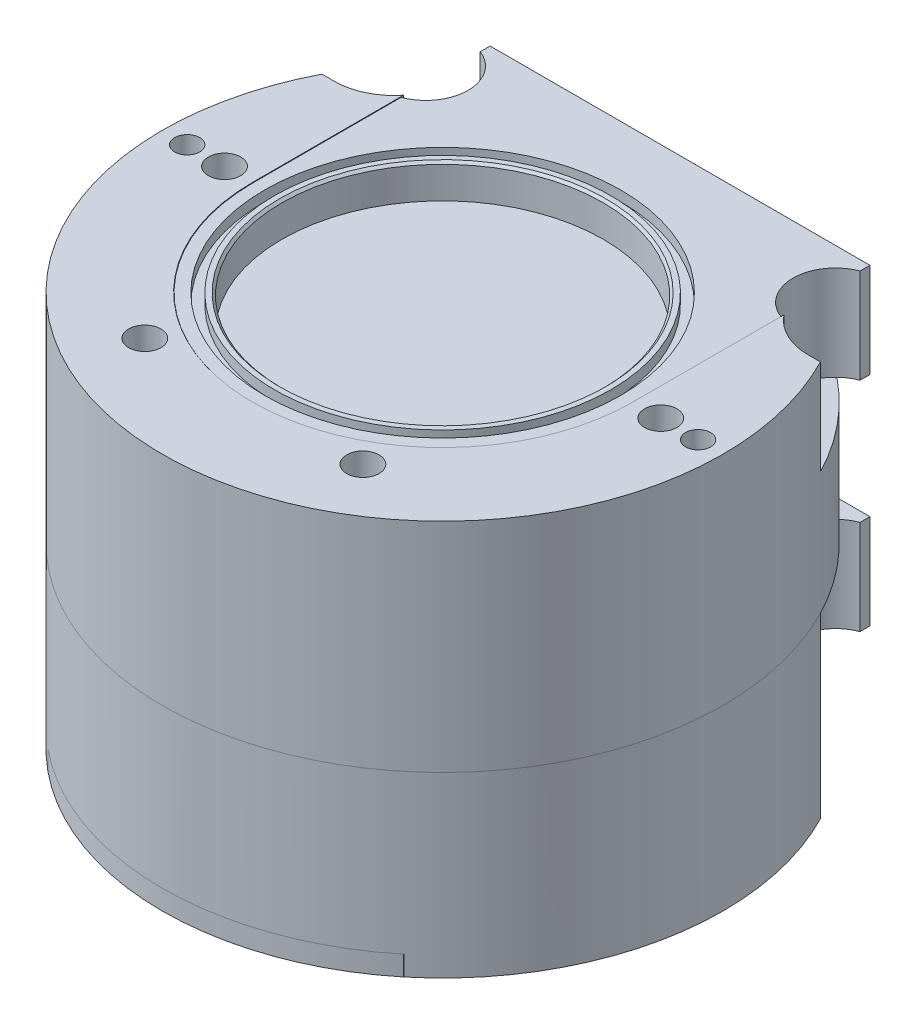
ISO-10303-21;
HEADER;
FILE_DESCRIPTION(('STEP AP214'),'2;1');
FILE_NAME('part.step','',(''),(''),'','','');
FILE_SCHEMA(('AUTOMOTIVE_DESIGN { 1 0 10303 214 1 1 1 1 }'));
ENDSEC;
DATA;
#1=APPLICATION_CONTEXT('core data for automotive mechanical design processes');
#2=APPLICATION_PROTOCOL_DEFINITION('international standard','automotive_design',2000,#1);
#3=PRODUCT_CONTEXT('',#1,'mechanical');
#4=PRODUCT('Part','Part','',(#3));
#5=PRODUCT_RELATED_PRODUCT_CATEGORY('part','',(#4));
#6=PRODUCT_DEFINITION_FORMATION('','',#4);
#7=PRODUCT_DEFINITION_CONTEXT('part definition',#1,'design');
#8=PRODUCT_DEFINITION('design','',#6,#7);
#9=PRODUCT_DEFINITION_SHAPE('','',#8);
#10=(LENGTH_UNIT() NAMED_UNIT(*) SI_UNIT(.MILLI.,.METRE.));
#11=(NAMED_UNIT(*) PLANE_ANGLE_UNIT() SI_UNIT($,.RADIAN.));
#12=(NAMED_UNIT(*) SI_UNIT($,.STERADIAN.) SOLID_ANGLE_UNIT());
#13=UNCERTAINTY_MEASURE_WITH_UNIT(LENGTH_MEASURE(1.E-05),#10,'distance_accuracy_value','');
#14=(GEOMETRIC_REPRESENTATION_CONTEXT(3) GLOBAL_UNCERTAINTY_ASSIGNED_CONTEXT((#13)) GLOBAL_UNIT_ASSIGNED_CONTEXT((#10,
#11,#12)) REPRESENTATION_CONTEXT('',''));
#15=CARTESIAN_POINT('',(0.,0.,0.));
#16=DIRECTION('',(0.,0.,1.));
#17=DIRECTION('',(1.,0.,0.));
#18=AXIS2_PLACEMENT_3D('',#15,#16,#17);
#19=CARTESIAN_POINT('',(-69.2235864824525,-150.362124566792,22.3867076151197));
#20=DIRECTION('',(0.,-1.,0.));
#21=DIRECTION('',(0.,0.,1.));
#22=AXIS2_PLACEMENT_3D('',#19,#20,#21);
#23=PLANE('',#22);
#24=DIRECTION('',(0.,0.,-1.));
#25=VECTOR('',#24,1.);
#26=CARTESIAN_POINT('',(-92.2359864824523,-150.362124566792,-23.9598257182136));
#27=LINE('',#26,#25);
#28=CARTESIAN_POINT('',(-92.2359864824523,-150.362124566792,44.5990076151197));
#29=VERTEX_POINT('',#28);
#30=CARTESIAN_POINT('',(-92.2359864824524,-150.362124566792,43.0242076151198));
#31=VERTEX_POINT('',#30);
#32=EDGE_CURVE('P0_E42',#29,#31,#27,.T.);
#33=ORIENTED_EDGE('',*,*,#32,.F.);
#34=DIRECTION('',(1.,0.,0.));
#35=VECTOR('',#34,1.);
#36=CARTESIAN_POINT('',(-93.8361864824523,-150.362124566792,44.5990076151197));
#37=LINE('',#36,#35);
#38=CARTESIAN_POINT('',(-93.8361864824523,-150.362124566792,44.5990076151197));
#39=VERTEX_POINT('',#38);
#40=EDGE_CURVE('P0_E865',#39,#29,#37,.T.);
#41=ORIENTED_EDGE('',*,*,#40,.F.);
#42=CARTESIAN_POINT('',(-93.8361864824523,-150.362124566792,46.1929700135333));
#43=DIRECTION('',(0.,-1.,0.));
#44=DIRECTION('',(0.,0.,1.));
#45=AXIS2_PLACEMENT_3D('',#42,#43,#44);
#46=CIRCLE('',#45,1.59396239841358);
#47=CARTESIAN_POINT('',(-95.4236864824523,-150.362124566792,46.3363571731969));
#48=VERTEX_POINT('',#47);
#49=EDGE_CURVE('P0_E821',#48,#39,#46,.T.);
#50=ORIENTED_EDGE('',*,*,#49,.F.);
#51=DIRECTION('',(0.,0.,-1.));
#52=VECTOR('',#51,1.);
#53=CARTESIAN_POINT('',(-95.4236864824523,-150.362124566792,54.1367076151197));
#54=LINE('',#53,#52);
#55=CARTESIAN_POINT('',(-95.4236864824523,-150.362124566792,54.1367076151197));
#56=VERTEX_POINT('',#55);
#57=EDGE_CURVE('P0_E833',#56,#48,#54,.T.);
#58=ORIENTED_EDGE('',*,*,#57,.F.);
#59=CARTESIAN_POINT('',(-93.8361864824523,-150.362124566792,54.1367076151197));
#60=DIRECTION('',(0.,-1.,0.));
#61=DIRECTION('',(0.,0.,1.));
#62=AXIS2_PLACEMENT_3D('',#59,#60,#61);
#63=CIRCLE('',#62,1.5875);
#64=CARTESIAN_POINT('',(-92.2486864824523,-150.362124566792,54.1367076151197));
#65=VERTEX_POINT('',#64);
#66=EDGE_CURVE('P0_E948',#65,#56,#63,.T.);
#67=ORIENTED_EDGE('',*,*,#66,.F.);
#68=DIRECTION('',(0.,0.,1.));
#69=VECTOR('',#68,1.);
#70=CARTESIAN_POINT('',(-92.2486864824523,-150.362124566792,54.1367076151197));
#71=LINE('',#70,#69);
#72=CARTESIAN_POINT('',(-92.2486864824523,-150.362124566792,47.7994076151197));
#73=VERTEX_POINT('',#72);
#74=EDGE_CURVE('P0_E885',#73,#65,#71,.T.);
#75=ORIENTED_EDGE('',*,*,#74,.F.);
#76=DIRECTION('',(-1.,0.,0.));
#77=VECTOR('',#76,1.);
#78=CARTESIAN_POINT('',(-92.2486864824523,-150.362124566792,47.7994076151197));
#79=LINE('',#78,#77);
#80=CARTESIAN_POINT('',(-46.1984864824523,-150.362124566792,47.7994076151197));
#81=VERTEX_POINT('',#80);
#82=EDGE_CURVE('P0_E881',#81,#73,#79,.T.);
#83=ORIENTED_EDGE('',*,*,#82,.F.);
#84=DIRECTION('',(0.,0.,-1.));
#85=VECTOR('',#84,1.);
#86=CARTESIAN_POINT('',(-46.1984864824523,-150.362124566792,54.1367076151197));
#87=LINE('',#86,#85);
#88=CARTESIAN_POINT('',(-46.1984864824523,-150.362124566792,54.1367076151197));
#89=VERTEX_POINT('',#88);
#90=EDGE_CURVE('P0_E877',#89,#81,#87,.T.);
#91=ORIENTED_EDGE('',*,*,#90,.F.);
#92=CARTESIAN_POINT('',(-44.6109864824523,-150.362124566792,54.1367076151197));
#93=DIRECTION('',(0.,-1.,0.));
#94=DIRECTION('',(0.,0.,1.));
#95=AXIS2_PLACEMENT_3D('',#92,#93,#94);
#96=CIRCLE('',#95,1.5875);
#97=CARTESIAN_POINT('',(-43.0234864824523,-150.362124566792,54.1367076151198));
#98=VERTEX_POINT('',#97);
#99=EDGE_CURVE('P0_E934',#98,#89,#96,.T.);
#100=ORIENTED_EDGE('',*,*,#99,.F.);
#101=DIRECTION('',(-0.00157928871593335,0.,0.999998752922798));
#102=VECTOR('',#101,1.);
#103=CARTESIAN_POINT('',(-43.0234864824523,-150.362124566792,54.1367076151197));
#104=LINE('',#103,#102);
#105=CARTESIAN_POINT('',(-43.0109912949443,-150.362124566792,46.2248091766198));
#106=VERTEX_POINT('',#105);
#107=EDGE_CURVE('P0_E873',#106,#98,#104,.T.);
#108=ORIENTED_EDGE('',*,*,#107,.F.);
#109=CARTESIAN_POINT('',(-44.6109864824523,-150.362124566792,46.1992076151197));
#110=DIRECTION('',(0.,-1.,0.));
#111=DIRECTION('',(0.,0.,1.));
#112=AXIS2_PLACEMENT_3D('',#109,#110,#111);
#113=CIRCLE('',#112,1.6002);
#114=CARTESIAN_POINT('',(-44.6109864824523,-150.362124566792,44.5990076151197));
#115=VERTEX_POINT('',#114);
#116=EDGE_CURVE('P0_E869',#115,#106,#113,.T.);
#117=ORIENTED_EDGE('',*,*,#116,.F.);
#118=CARTESIAN_POINT('',(-46.2111864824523,-150.362124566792,44.5990076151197));
#119=VERTEX_POINT('',#118);
#120=EDGE_CURVE('P0_E864',#119,#115,#37,.T.);
#121=ORIENTED_EDGE('',*,*,#120,.F.);
#122=DIRECTION('',(0.,0.,1.));
#123=VECTOR('',#122,1.);
#124=CARTESIAN_POINT('',(-46.2111864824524,-150.362124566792,22.3867076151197));
#125=LINE('',#124,#123);
#126=CARTESIAN_POINT('',(-46.2111864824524,-150.362124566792,43.0242076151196));
#127=VERTEX_POINT('',#126);
#128=EDGE_CURVE('P0_E11',#127,#119,#125,.T.);
#129=ORIENTED_EDGE('',*,*,#128,.F.);
#130=DIRECTION('',(1.,0.,0.));
#131=VECTOR('',#130,1.);
#132=CARTESIAN_POINT('',(-97.7477864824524,-150.362124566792,43.0242076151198));
#133=LINE('',#132,#131);
#134=EDGE_CURVE('P0_E1241',#31,#127,#133,.T.);
#135=ORIENTED_EDGE('',*,*,#134,.F.);
#136=EDGE_LOOP('',(#33,#41,#50,#58,#67,#75,#83,#91,#100,#108,#117,#121,#129,#135));
#137=FACE_BOUND('',#136,.T.);
#138=ADVANCED_FACE('P0_F16',(#137),#23,.F.);
#139=CARTESIAN_POINT('',(-97.7477864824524,-150.362124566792,43.0242076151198));
#140=DIRECTION('',(-1.,0.,0.));
#141=DIRECTION('',(0.,-1.,0.));
#142=AXIS2_PLACEMENT_3D('',#139,#140,#141);
#143=PLANE('',#142);
#144=DIRECTION('',(0.,-1.,0.));
#145=VECTOR('',#144,1.);
#146=CARTESIAN_POINT('',(-97.7477864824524,-150.362124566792,43.0242076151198));
#147=LINE('',#146,#145);
#148=CARTESIAN_POINT('',(-97.7477864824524,-150.362124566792,43.0242076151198));
#149=VERTEX_POINT('',#148);
#150=CARTESIAN_POINT('',(-97.7477864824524,-151.149524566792,43.0242076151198));
#151=VERTEX_POINT('',#150);
#152=EDGE_CURVE('P0_E1249',#149,#151,#147,.T.);
#153=ORIENTED_EDGE('',*,*,#152,.T.);
#154=DIRECTION('',(0.,0.707106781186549,-0.707106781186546));
#155=VECTOR('',#154,1.);
#156=CARTESIAN_POINT('',(-97.7477864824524,-150.755824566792,42.6305076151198));
#157=LINE('',#156,#155);
#158=CARTESIAN_POINT('',(-97.7477864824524,-153.537124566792,45.4118076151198));
#159=VERTEX_POINT('',#158);
#160=EDGE_CURVE('P0_E25',#151,#159,#157,.F.);
#161=ORIENTED_EDGE('',*,*,#160,.T.);
#162=DIRECTION('',(0.,0.,-1.));
#163=VECTOR('',#162,1.);
#164=CARTESIAN_POINT('',(-97.7477864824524,-153.537124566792,43.0242076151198));
#165=LINE('',#164,#163);
#166=CARTESIAN_POINT('',(-97.7477864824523,-153.537124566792,57.2028258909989));
#167=VERTEX_POINT('',#166);
#168=EDGE_CURVE('P0_E1229',#167,#159,#165,.T.);
#169=ORIENTED_EDGE('',*,*,#168,.F.);
#170=DIRECTION('',(0.,-1.,0.));
#171=VECTOR('',#170,1.);
#172=CARTESIAN_POINT('',(-97.7477864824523,-150.362124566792,57.2028258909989));
#173=LINE('',#172,#171);
#174=CARTESIAN_POINT('',(-97.7477864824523,-150.362124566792,57.2028258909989));
#175=VERTEX_POINT('',#174);
#176=EDGE_CURVE('P0_E1259',#175,#167,#173,.T.);
#177=ORIENTED_EDGE('',*,*,#176,.F.);
#178=DIRECTION('',(0.,0.,-1.));
#179=VECTOR('',#178,1.);
#180=CARTESIAN_POINT('',(-97.7477864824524,-150.362124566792,43.0242076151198));
#181=LINE('',#180,#179);
#182=EDGE_CURVE('P0_E1230',#175,#149,#181,.T.);
#183=ORIENTED_EDGE('',*,*,#182,.T.);
#184=EDGE_LOOP('',(#153,#161,#169,#177,#183));
#185=FACE_BOUND('',#184,.T.);
#186=ADVANCED_FACE('P0_F1288',(#185),#143,.T.);
#187=CARTESIAN_POINT('',(-69.2235864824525,-150.362124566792,22.3867076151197));
#188=DIRECTION('',(0.,-1.,0.));
#189=DIRECTION('',(0.,0.,1.));
#190=AXIS2_PLACEMENT_3D('',#187,#188,#189);
#191=CYLINDRICAL_SURFACE('',#190,45.0088);
#192=CARTESIAN_POINT('',(-69.2235864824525,-153.537124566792,22.3867076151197));
#193=DIRECTION('',(0.,-1.,0.));
#194=DIRECTION('',(0.,0.,1.));
#195=AXIS2_PLACEMENT_3D('',#192,#193,#194);
#196=CIRCLE('',#195,45.0088);
#197=CARTESIAN_POINT('',(-40.6993864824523,-153.537124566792,57.2028258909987));
#198=VERTEX_POINT('',#197);
#199=EDGE_CURVE('P0_E1235',#198,#167,#196,.T.);
#200=ORIENTED_EDGE('',*,*,#199,.F.);
#201=DIRECTION('',(0.,-1.,0.));
#202=VECTOR('',#201,1.);
#203=CARTESIAN_POINT('',(-40.6993864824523,-150.362124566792,57.2028258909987));
#204=LINE('',#203,#202);
#205=CARTESIAN_POINT('',(-40.6993864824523,-150.362124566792,57.2028258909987));
#206=VERTEX_POINT('',#205);
#207=EDGE_CURVE('P0_E1263',#206,#198,#204,.T.);
#208=ORIENTED_EDGE('',*,*,#207,.F.);
#209=CARTESIAN_POINT('',(-69.2235864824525,-150.362124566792,22.3867076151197));
#210=DIRECTION('',(0.,-1.,0.));
#211=DIRECTION('',(0.,0.,1.));
#212=AXIS2_PLACEMENT_3D('',#209,#210,#211);
#213=CIRCLE('',#212,45.0088);
#214=EDGE_CURVE('P0_E1245',#206,#175,#213,.T.);
#215=ORIENTED_EDGE('',*,*,#214,.T.);
#216=ORIENTED_EDGE('',*,*,#176,.T.);
#217=EDGE_LOOP('',(#200,#208,#215,#216));
#218=FACE_BOUND('',#217,.T.);
#219=ADVANCED_FACE('P0_F2542',(#218),#191,.T.);
#220=CARTESIAN_POINT('',(-40.6993864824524,-150.362124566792,43.0242076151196));
#221=DIRECTION('',(1.,0.,0.));
#222=DIRECTION('',(0.,0.,1.));
#223=AXIS2_PLACEMENT_3D('',#220,#221,#222);
#224=PLANE('',#223);
#225=DIRECTION('',(0.,0.,1.));
#226=VECTOR('',#225,1.);
#227=CARTESIAN_POINT('',(-40.6993864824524,-153.537124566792,43.0242076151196));
#228=LINE('',#227,#226);
#229=CARTESIAN_POINT('',(-40.6993864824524,-153.537124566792,45.4118076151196));
#230=VERTEX_POINT('',#229);
#231=EDGE_CURVE('P0_E1253',#230,#198,#228,.T.);
#232=ORIENTED_EDGE('',*,*,#231,.F.);
#233=DIRECTION('',(0.,-0.707106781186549,0.707106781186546));
#234=VECTOR('',#233,1.);
#235=CARTESIAN_POINT('',(-40.6993864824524,-150.755824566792,42.6305076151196));
#236=LINE('',#235,#234);
#237=CARTESIAN_POINT('',(-40.6993864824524,-151.149524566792,43.0242076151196));
#238=VERTEX_POINT('',#237);
#239=EDGE_CURVE('P0_E1277',#230,#238,#236,.F.);
#240=ORIENTED_EDGE('',*,*,#239,.T.);
#241=DIRECTION('',(0.,-1.,0.));
#242=VECTOR('',#241,1.);
#243=CARTESIAN_POINT('',(-40.6993864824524,-150.362124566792,43.0242076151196));
#244=LINE('',#243,#242);
#245=CARTESIAN_POINT('',(-40.6993864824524,-150.362124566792,43.0242076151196));
#246=VERTEX_POINT('',#245);
#247=EDGE_CURVE('P0_E1267',#246,#238,#244,.T.);
#248=ORIENTED_EDGE('',*,*,#247,.F.);
#249=DIRECTION('',(0.,0.,1.));
#250=VECTOR('',#249,1.);
#251=CARTESIAN_POINT('',(-40.6993864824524,-150.362124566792,43.0242076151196));
#252=LINE('',#251,#250);
#253=EDGE_CURVE('P0_E1240',#246,#206,#252,.T.);
#254=ORIENTED_EDGE('',*,*,#253,.T.);
#255=ORIENTED_EDGE('',*,*,#207,.T.);
#256=EDGE_LOOP('',(#232,#240,#248,#254,#255));
#257=FACE_BOUND('',#256,.T.);
#258=ADVANCED_FACE('P0_F1298',(#257),#224,.T.);
#259=CARTESIAN_POINT('',(-97.7477864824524,-150.362124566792,43.0242076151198));
#260=DIRECTION('',(0.,0.,-1.));
#261=DIRECTION('',(1.,0.,0.));
#262=AXIS2_PLACEMENT_3D('',#259,#260,#261);
#263=PLANE('',#262);
#264=ORIENTED_EDGE('',*,*,#247,.T.);
#265=DIRECTION('',(-1.,0.,0.));
#266=VECTOR('',#265,1.);
#267=CARTESIAN_POINT('',(-97.7477864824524,-151.149524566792,43.0242076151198));
#268=LINE('',#267,#266);
#269=EDGE_CURVE('P0_E1280',#238,#151,#268,.T.);
#270=ORIENTED_EDGE('',*,*,#269,.T.);
#271=ORIENTED_EDGE('',*,*,#152,.F.);
#272=EDGE_CURVE('P0_E1236',#149,#31,#133,.T.);
#273=ORIENTED_EDGE('',*,*,#272,.T.);
#274=ORIENTED_EDGE('',*,*,#134,.T.);
#275=EDGE_CURVE('P0_E1234',#127,#246,#133,.T.);
#276=ORIENTED_EDGE('',*,*,#275,.T.);
#277=EDGE_LOOP('',(#264,#270,#271,#273,#274,#276));
#278=FACE_BOUND('',#277,.T.);
#279=ADVANCED_FACE('P0_F1301',(#278),#263,.T.);
#280=CARTESIAN_POINT('',(-69.2235864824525,-153.537124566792,22.3867076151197));
#281=DIRECTION('',(0.,-1.,0.));
#282=DIRECTION('',(0.,0.,1.));
#283=AXIS2_PLACEMENT_3D('',#280,#281,#282);
#284=PLANE('',#283);
#285=ORIENTED_EDGE('',*,*,#168,.T.);
#286=DIRECTION('',(1.,0.,0.));
#287=VECTOR('',#286,1.);
#288=CARTESIAN_POINT('',(-69.2235864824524,-153.537124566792,45.4118076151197));
#289=LINE('',#288,#287);
#290=EDGE_CURVE('P0_E1262',#159,#230,#289,.T.);
#291=ORIENTED_EDGE('',*,*,#290,.T.);
#292=ORIENTED_EDGE('',*,*,#231,.T.);
#293=ORIENTED_EDGE('',*,*,#199,.T.);
#294=EDGE_LOOP('',(#285,#291,#292,#293));
#295=FACE_BOUND('',#294,.T.);
#296=ADVANCED_FACE('P0_F1293',(#295),#284,.T.);
#297=CARTESIAN_POINT('',(-69.2235864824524,-153.537124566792,45.4118076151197));
#298=DIRECTION('',(0.,0.707106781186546,0.707106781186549));
#299=DIRECTION('',(0.,0.707106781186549,-0.707106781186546));
#300=AXIS2_PLACEMENT_3D('',#297,#298,#299);
#301=PLANE('',#300);
#302=ORIENTED_EDGE('',*,*,#160,.F.);
#303=ORIENTED_EDGE('',*,*,#269,.F.);
#304=ORIENTED_EDGE('',*,*,#239,.F.);
#305=ORIENTED_EDGE('',*,*,#290,.F.);
#306=EDGE_LOOP('',(#302,#303,#304,#305));
#307=FACE_BOUND('',#306,.T.);
#308=ADVANCED_FACE('P0_F18',(#307),#301,.F.);
#309=CARTESIAN_POINT('',(-40.6485864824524,-150.362124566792,-28.4838479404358));
#310=DIRECTION('',(0.,-1.,0.));
#311=DIRECTION('',(0.,0.,1.));
#312=AXIS2_PLACEMENT_3D('',#309,#310,#311);
#313=PLANE('',#312);
#314=CARTESIAN_POINT('',(-69.2235864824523,-150.362124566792,22.3867076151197));
#315=DIRECTION('',(0.,-1.,0.));
#316=DIRECTION('',(0.,0.,1.));
#317=AXIS2_PLACEMENT_3D('',#314,#315,#316);
#318=CIRCLE('',#317,45.0088);
#319=CARTESIAN_POINT('',(-40.6485864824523,-150.362124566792,57.1611443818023));
#320=VERTEX_POINT('',#319);
#321=EDGE_CURVE('P0_E944',#206,#320,#318,.F.);
#322=ORIENTED_EDGE('',*,*,#321,.F.);
#323=ORIENTED_EDGE('',*,*,#253,.F.);
#324=ORIENTED_EDGE('',*,*,#275,.F.);
#325=DIRECTION('',(0.,0.,1.));
#326=VECTOR('',#325,1.);
#327=CARTESIAN_POINT('',(-46.2111864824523,-150.362124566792,-23.9598257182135));
#328=LINE('',#327,#326);
#329=CARTESIAN_POINT('',(-46.2111864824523,-150.362124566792,42.9728074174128));
#330=VERTEX_POINT('',#329);
#331=EDGE_CURVE('P0_E813',#330,#127,#328,.T.);
#332=ORIENTED_EDGE('',*,*,#331,.F.);
#333=CARTESIAN_POINT('',(-47.0174994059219,-150.362124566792,36.6742076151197));
#334=DIRECTION('',(0.,-1.,0.));
#335=DIRECTION('',(0.,0.,1.));
#336=AXIS2_PLACEMENT_3D('',#333,#334,#335);
#337=CIRCLE('',#336,6.35);
#338=CARTESIAN_POINT('',(-40.6674994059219,-150.362124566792,36.6742076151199));
#339=VERTEX_POINT('',#338);
#340=EDGE_CURVE('P0_E711',#339,#330,#337,.T.);
#341=ORIENTED_EDGE('',*,*,#340,.F.);
#342=DIRECTION('',(1.,0.,0.));
#343=VECTOR('',#342,1.);
#344=CARTESIAN_POINT('',(-40.6485864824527,-150.362124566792,36.6742076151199));
#345=LINE('',#344,#343);
#346=CARTESIAN_POINT('',(-40.6485864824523,-150.362124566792,36.6742076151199));
#347=VERTEX_POINT('',#346);
#348=EDGE_CURVE('P0_E700',#339,#347,#345,.T.);
#349=ORIENTED_EDGE('',*,*,#348,.T.);
#350=DIRECTION('',(0.,0.,1.));
#351=VECTOR('',#350,1.);
#352=CARTESIAN_POINT('',(-40.6485864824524,-150.362124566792,-28.4838479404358));
#353=LINE('',#352,#351);
#354=EDGE_CURVE('P0_E935',#347,#320,#353,.T.);
#355=ORIENTED_EDGE('',*,*,#354,.T.);
#356=EDGE_LOOP('',(#322,#323,#324,#332,#341,#349,#355));
#357=FACE_BOUND('',#356,.T.);
#358=ADVANCED_FACE('P0_F3179',(#357),#313,.T.);
#359=CARTESIAN_POINT('',(-69.2235864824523,-124.962124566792,22.3867076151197));
#360=DIRECTION('',(0.,1.,0.));
#361=DIRECTION('',(0.,0.,-1.));
#362=AXIS2_PLACEMENT_3D('',#359,#360,#361);
#363=CYLINDRICAL_SURFACE('',#362,45.0088);
#364=DIRECTION('',(0.,1.,0.));
#365=VECTOR('',#364,1.);
#366=CARTESIAN_POINT('',(-40.8328053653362,-124.962124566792,-12.5382923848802));
#367=LINE('',#366,#365);
#368=CARTESIAN_POINT('',(-40.8328053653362,-105.302524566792,-12.5382923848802));
#369=VERTEX_POINT('',#368);
#370=CARTESIAN_POINT('',(-40.8328053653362,-124.962124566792,-12.5382923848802));
#371=VERTEX_POINT('',#370);
#372=EDGE_CURVE('P0_E1113',#369,#371,#367,.F.);
#373=ORIENTED_EDGE('',*,*,#372,.F.);
#374=CARTESIAN_POINT('',(-69.2235864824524,-105.302524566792,22.3867076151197));
#375=DIRECTION('',(0.,1.,0.));
#376=DIRECTION('',(0.,0.,-1.));
#377=AXIS2_PLACEMENT_3D('',#374,#375,#376);
#378=CIRCLE('',#377,45.0088);
#379=CARTESIAN_POINT('',(-29.2250156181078,-105.302524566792,1.74920761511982));
#380=VERTEX_POINT('',#379);
#381=EDGE_CURVE('P0_E1205',#369,#380,#378,.F.);
#382=ORIENTED_EDGE('',*,*,#381,.T.);
#383=DIRECTION('',(0.,1.,0.));
#384=VECTOR('',#383,1.);
#385=CARTESIAN_POINT('',(-29.2250156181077,-124.962124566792,1.74920761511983));
#386=LINE('',#385,#384);
#387=CARTESIAN_POINT('',(-29.2250156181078,-90.0371245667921,1.74920761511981));
#388=VERTEX_POINT('',#387);
#389=EDGE_CURVE('P0_E1172',#388,#380,#386,.F.);
#390=ORIENTED_EDGE('',*,*,#389,.F.);
#391=CARTESIAN_POINT('',(-69.2235864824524,-90.0371245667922,22.3867076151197));
#392=DIRECTION('',(0.,1.,0.));
#393=DIRECTION('',(0.,0.,-1.));
#394=AXIS2_PLACEMENT_3D('',#391,#392,#393);
#395=CIRCLE('',#394,45.0088);
#396=CARTESIAN_POINT('',(-109.222157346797,-90.0371245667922,1.74920761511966));
#397=VERTEX_POINT('',#396);
#398=EDGE_CURVE('P0_E1213',#397,#388,#395,.T.);
#399=ORIENTED_EDGE('',*,*,#398,.F.);
#400=DIRECTION('',(0.,1.,0.));
#401=VECTOR('',#400,1.);
#402=CARTESIAN_POINT('',(-109.222157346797,-124.962124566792,1.74920761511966));
#403=LINE('',#402,#401);
#404=CARTESIAN_POINT('',(-109.222157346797,-105.302524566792,1.74920761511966));
#405=VERTEX_POINT('',#404);
#406=EDGE_CURVE('P0_E1176',#405,#397,#403,.T.);
#407=ORIENTED_EDGE('',*,*,#406,.F.);
#408=CARTESIAN_POINT('',(-97.6143675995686,-105.302524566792,-12.5382923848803));
#409=VERTEX_POINT('',#408);
#410=EDGE_CURVE('P0_E1209',#405,#409,#378,.F.);
#411=ORIENTED_EDGE('',*,*,#410,.T.);
#412=DIRECTION('',(0.,1.,0.));
#413=VECTOR('',#412,1.);
#414=CARTESIAN_POINT('',(-97.6143675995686,-124.962124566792,-12.5382923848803));
#415=LINE('',#414,#413);
#416=CARTESIAN_POINT('',(-97.6143675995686,-124.962124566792,-12.5382923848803));
#417=VERTEX_POINT('',#416);
#418=EDGE_CURVE('P0_E1110',#417,#409,#415,.T.);
#419=ORIENTED_EDGE('',*,*,#418,.F.);
#420=CARTESIAN_POINT('',(-69.2235864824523,-124.962124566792,22.3867076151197));
#421=DIRECTION('',(0.,1.,0.));
#422=DIRECTION('',(0.,0.,-1.));
#423=AXIS2_PLACEMENT_3D('',#420,#421,#422);
#424=CIRCLE('',#423,45.0088);
#425=CARTESIAN_POINT('',(-109.222157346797,-124.962124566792,1.74920761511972));
#426=VERTEX_POINT('',#425);
#427=EDGE_CURVE('P0_E1214',#417,#426,#424,.T.);
#428=ORIENTED_EDGE('',*,*,#427,.T.);
#429=CARTESIAN_POINT('',(-69.2235864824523,-124.962124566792,22.3867076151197));
#430=DIRECTION('',(0.,1.,0.));
#431=DIRECTION('',(0.,0.,-1.));
#432=AXIS2_PLACEMENT_3D('',#429,#430,#431);
#433=CIRCLE('',#432,45.0088);
#434=CARTESIAN_POINT('',(-29.2250156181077,-124.962124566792,1.74920761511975));
#435=VERTEX_POINT('',#434);
#436=EDGE_CURVE('P0_E992',#426,#435,#433,.T.);
#437=ORIENTED_EDGE('',*,*,#436,.T.);
#438=EDGE_CURVE('P0_E1219',#435,#371,#424,.T.);
#439=ORIENTED_EDGE('',*,*,#438,.T.);
#440=EDGE_LOOP('',(#373,#382,#390,#399,#407,#411,#419,#428,#437,#439));
#441=FACE_BOUND('',#440,.T.);
#442=ADVANCED_FACE('P0_F3101',(#441),#363,.T.);
#443=CARTESIAN_POINT('',(-69.2235864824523,-124.962124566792,22.3867076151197));
#444=DIRECTION('',(0.,1.,0.));
#445=DIRECTION('',(0.,0.,-1.));
#446=AXIS2_PLACEMENT_3D('',#443,#444,#445);
#447=PLANE('',#446);
#448=DIRECTION('',(1.,0.,0.));
#449=VECTOR('',#448,1.);
#450=CARTESIAN_POINT('',(-115.679792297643,-124.962124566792,1.74920761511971));
#451=LINE('',#450,#449);
#452=CARTESIAN_POINT('',(-107.221373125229,-124.962124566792,1.74920761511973));
#453=VERTEX_POINT('',#452);
#454=EDGE_CURVE('P0_E759',#426,#453,#451,.T.);
#455=ORIENTED_EDGE('',*,*,#454,.F.);
#456=ORIENTED_EDGE('',*,*,#427,.F.);
#457=DIRECTION('',(-1.,0.,0.));
#458=VECTOR('',#457,1.);
#459=CARTESIAN_POINT('',(-111.316419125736,-124.962124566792,-12.5382923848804));
#460=LINE('',#459,#458);
#461=EDGE_CURVE('P0_E1107',#371,#417,#460,.T.);
#462=ORIENTED_EDGE('',*,*,#461,.F.);
#463=ORIENTED_EDGE('',*,*,#438,.F.);
#464=DIRECTION('',(1.,0.,0.));
#465=VECTOR('',#464,1.);
#466=CARTESIAN_POINT('',(-31.2257998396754,-124.962124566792,1.74920761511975));
#467=LINE('',#466,#465);
#468=CARTESIAN_POINT('',(-31.2257998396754,-124.962124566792,1.74920761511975));
#469=VERTEX_POINT('',#468);
#470=EDGE_CURVE('P0_E778',#469,#435,#467,.T.);
#471=ORIENTED_EDGE('',*,*,#470,.F.);
#472=CARTESIAN_POINT('',(-31.2257998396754,-124.962124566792,-7.77579238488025));
#473=DIRECTION('',(0.,1.,0.));
#474=DIRECTION('',(0.,0.,1.));
#475=AXIS2_PLACEMENT_3D('',#472,#473,#474);
#476=CIRCLE('',#475,9.525);
#477=CARTESIAN_POINT('',(-38.4692077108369,-124.962124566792,-1.59043326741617));
#478=VERTEX_POINT('',#477);
#479=EDGE_CURVE('P0_E774',#478,#469,#476,.T.);
#480=ORIENTED_EDGE('',*,*,#479,.F.);
#481=CARTESIAN_POINT('',(-38.5657864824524,-124.962124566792,-1.50796181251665));
#482=DIRECTION('',(0.,1.,0.));
#483=DIRECTION('',(0.,0.,-1.));
#484=AXIS2_PLACEMENT_3D('',#481,#482,#483);
#485=CIRCLE('',#484,0.127);
#486=CARTESIAN_POINT('',(-38.6927864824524,-124.962124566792,-1.50796181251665));
#487=VERTEX_POINT('',#486);
#488=EDGE_CURVE('P0_E1057',#478,#487,#485,.T.);
#489=ORIENTED_EDGE('',*,*,#488,.T.);
#490=DIRECTION('',(0.,0.,-1.));
#491=VECTOR('',#490,1.);
#492=CARTESIAN_POINT('',(-38.6927864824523,-124.962124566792,22.3867076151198));
#493=LINE('',#492,#491);
#494=CARTESIAN_POINT('',(-38.6927864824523,-124.962124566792,22.3867076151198));
#495=VERTEX_POINT('',#494);
#496=EDGE_CURVE('P0_E981',#495,#487,#493,.T.);
#497=ORIENTED_EDGE('',*,*,#496,.F.);
#498=CARTESIAN_POINT('',(-69.2235864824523,-124.962124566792,22.3867076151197));
#499=DIRECTION('',(0.,1.,0.));
#500=DIRECTION('',(0.,0.,-1.));
#501=AXIS2_PLACEMENT_3D('',#498,#499,#500);
#502=CIRCLE('',#501,30.5308);
#503=CARTESIAN_POINT('',(-99.7543864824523,-124.962124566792,22.3867076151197));
#504=VERTEX_POINT('',#503);
#505=EDGE_CURVE('P0_E964',#504,#495,#502,.T.);
#506=ORIENTED_EDGE('',*,*,#505,.F.);
#507=DIRECTION('',(0.,0.,1.));
#508=VECTOR('',#507,1.);
#509=CARTESIAN_POINT('',(-99.7543864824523,-124.962124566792,22.3867076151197));
#510=LINE('',#509,#508);
#511=CARTESIAN_POINT('',(-99.7543864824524,-124.962124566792,-1.50796181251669));
#512=VERTEX_POINT('',#511);
#513=EDGE_CURVE('P0_E970',#512,#504,#510,.T.);
#514=ORIENTED_EDGE('',*,*,#513,.F.);
#515=CARTESIAN_POINT('',(-99.8813864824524,-124.962124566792,-1.50796181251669));
#516=DIRECTION('',(0.,1.,0.));
#517=DIRECTION('',(0.,0.,-1.));
#518=AXIS2_PLACEMENT_3D('',#515,#516,#517);
#519=CIRCLE('',#518,0.127);
#520=CARTESIAN_POINT('',(-99.9779652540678,-124.962124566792,-1.59043326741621));
#521=VERTEX_POINT('',#520);
#522=EDGE_CURVE('P0_E1060',#512,#521,#519,.T.);
#523=ORIENTED_EDGE('',*,*,#522,.T.);
#524=CARTESIAN_POINT('',(-107.221373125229,-124.962124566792,-7.77579238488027));
#525=DIRECTION('',(0.,1.,0.));
#526=DIRECTION('',(0.,0.,1.));
#527=AXIS2_PLACEMENT_3D('',#524,#525,#526);
#528=CIRCLE('',#527,9.525);
#529=EDGE_CURVE('P0_E753',#453,#521,#528,.T.);
#530=ORIENTED_EDGE('',*,*,#529,.F.);
#531=EDGE_LOOP('',(#455,#456,#462,#463,#471,#480,#489,#497,#506,#514,#523,#530));
#532=FACE_BOUND('',#531,.T.);
#533=ADVANCED_FACE('P0_F1579',(#532),#447,.F.);
#534=CARTESIAN_POINT('',(-69.2235864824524,-90.0371245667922,22.3867076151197));
#535=DIRECTION('',(0.,1.,0.));
#536=DIRECTION('',(0.,0.,-1.));
#537=AXIS2_PLACEMENT_3D('',#534,#535,#536);
#538=PLANE('',#537);
#539=CARTESIAN_POINT('',(-86.7241864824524,-90.0371245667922,52.6889076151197));
#540=DIRECTION('',(0.,1.,0.));
#541=DIRECTION('',(0.,0.,-1.));
#542=AXIS2_PLACEMENT_3D('',#539,#540,#541);
#543=CIRCLE('',#542,2.6035);
#544=CARTESIAN_POINT('',(-86.7241864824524,-90.0371245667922,50.0854076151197));
#545=VERTEX_POINT('',#544);
#546=EDGE_CURVE('P0_E2555',#545,#545,#543,.T.);
#547=ORIENTED_EDGE('',*,*,#546,.F.);
#548=EDGE_LOOP('',(#547));
#549=FACE_BOUND('',#548,.T.);
#550=CARTESIAN_POINT('',(-51.7229864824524,-90.0371245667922,52.6889076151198));
#551=DIRECTION('',(0.,1.,0.));
#552=DIRECTION('',(0.,0.,-1.));
#553=AXIS2_PLACEMENT_3D('',#550,#551,#552);
#554=CIRCLE('',#553,2.6035);
#555=CARTESIAN_POINT('',(-51.7229864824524,-90.0371245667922,50.0854076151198));
#556=VERTEX_POINT('',#555);
#557=EDGE_CURVE('P0_E1423',#556,#556,#554,.T.);
#558=ORIENTED_EDGE('',*,*,#557,.F.);
#559=EDGE_LOOP('',(#558));
#560=FACE_BOUND('',#559,.T.);
#561=CARTESIAN_POINT('',(-104.224786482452,-90.0371245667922,22.3841676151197));
#562=DIRECTION('',(0.,1.,0.));
#563=DIRECTION('',(0.,0.,-1.));
#564=AXIS2_PLACEMENT_3D('',#561,#562,#563);
#565=CIRCLE('',#564,2.6035);
#566=CARTESIAN_POINT('',(-104.224786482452,-90.0371245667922,19.7806676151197));
#567=VERTEX_POINT('',#566);
#568=EDGE_CURVE('P0_E2556',#567,#567,#565,.T.);
#569=ORIENTED_EDGE('',*,*,#568,.F.);
#570=EDGE_LOOP('',(#569));
#571=FACE_BOUND('',#570,.T.);
#572=CARTESIAN_POINT('',(-34.2223864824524,-90.0371245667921,22.3841676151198));
#573=DIRECTION('',(0.,1.,0.));
#574=DIRECTION('',(0.,0.,-1.));
#575=AXIS2_PLACEMENT_3D('',#572,#573,#574);
#576=CIRCLE('',#575,2.6035);
#577=CARTESIAN_POINT('',(-34.2223864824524,-90.0371245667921,19.7806676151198));
#578=VERTEX_POINT('',#577);
#579=EDGE_CURVE('P0_E2575',#578,#578,#576,.T.);
#580=ORIENTED_EDGE('',*,*,#579,.F.);
#581=EDGE_LOOP('',(#580));
#582=FACE_BOUND('',#581,.T.);
#583=CARTESIAN_POINT('',(-110.219186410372,-90.0371245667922,22.3842765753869));
#584=DIRECTION('',(0.,1.,0.));
#585=DIRECTION('',(0.,0.,-1.));
#586=AXIS2_PLACEMENT_3D('',#583,#584,#585);
#587=CIRCLE('',#586,2.0066);
#588=CARTESIAN_POINT('',(-110.219186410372,-90.0371245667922,20.3776765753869));
#589=VERTEX_POINT('',#588);
#590=EDGE_CURVE('P0_E2581',#589,#589,#587,.T.);
#591=ORIENTED_EDGE('',*,*,#590,.F.);
#592=EDGE_LOOP('',(#591));
#593=FACE_BOUND('',#592,.T.);
#594=CARTESIAN_POINT('',(-28.2279865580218,-90.0371245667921,22.3842184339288));
#595=DIRECTION('',(0.,1.,0.));
#596=DIRECTION('',(0.,0.,-1.));
#597=AXIS2_PLACEMENT_3D('',#594,#595,#596);
#598=CIRCLE('',#597,2.0066);
#599=CARTESIAN_POINT('',(-28.2279865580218,-90.0371245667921,20.3776184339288));
#600=VERTEX_POINT('',#599);
#601=EDGE_CURVE('P0_E2358',#600,#600,#598,.T.);
#602=ORIENTED_EDGE('',*,*,#601,.F.);
#603=EDGE_LOOP('',(#602));
#604=FACE_BOUND('',#603,.T.);
#605=DIRECTION('',(1.,0.,0.));
#606=VECTOR('',#605,1.);
#607=CARTESIAN_POINT('',(-115.679792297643,-90.0371245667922,1.74920761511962));
#608=LINE('',#607,#606);
#609=CARTESIAN_POINT('',(-107.221373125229,-90.0371245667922,1.74920761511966));
#610=VERTEX_POINT('',#609);
#611=EDGE_CURVE('P0_E1123',#397,#610,#608,.T.);
#612=ORIENTED_EDGE('',*,*,#611,.F.);
#613=ORIENTED_EDGE('',*,*,#398,.T.);
#614=DIRECTION('',(1.,0.,0.));
#615=VECTOR('',#614,1.);
#616=CARTESIAN_POINT('',(-31.2257998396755,-90.0371245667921,1.74920761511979));
#617=LINE('',#616,#615);
#618=CARTESIAN_POINT('',(-31.2257998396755,-90.0371245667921,1.74920761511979));
#619=VERTEX_POINT('',#618);
#620=EDGE_CURVE('P0_E1150',#619,#388,#617,.T.);
#621=ORIENTED_EDGE('',*,*,#620,.F.);
#622=CARTESIAN_POINT('',(-31.2257998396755,-90.0371245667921,-7.77579238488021));
#623=DIRECTION('',(0.,1.,0.));
#624=DIRECTION('',(0.,0.,1.));
#625=AXIS2_PLACEMENT_3D('',#622,#623,#624);
#626=CIRCLE('',#625,9.525);
#627=CARTESIAN_POINT('',(-38.6860982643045,-90.0371245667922,-1.85383557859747));
#628=VERTEX_POINT('',#627);
#629=EDGE_CURVE('P0_E1146',#628,#619,#626,.T.);
#630=ORIENTED_EDGE('',*,*,#629,.F.);
#631=CARTESIAN_POINT('',(-69.2235864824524,-90.0371245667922,22.3867076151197));
#632=DIRECTION('',(0.,-1.,0.));
#633=DIRECTION('',(0.,0.,-1.));
#634=AXIS2_PLACEMENT_3D('',#631,#632,#633);
#635=CIRCLE('',#634,38.989);
#636=CARTESIAN_POINT('',(-38.6927864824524,-90.0371245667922,-1.86225880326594));
#637=VERTEX_POINT('',#636);
#638=EDGE_CURVE('P0_E1142',#637,#628,#635,.T.);
#639=ORIENTED_EDGE('',*,*,#638,.F.);
#640=DIRECTION('',(0.,0.,-1.));
#641=VECTOR('',#640,1.);
#642=CARTESIAN_POINT('',(-38.6927864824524,-90.0371245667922,22.3867076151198));
#643=LINE('',#642,#641);
#644=CARTESIAN_POINT('',(-38.6927864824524,-90.0371245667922,22.3867076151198));
#645=VERTEX_POINT('',#644);
#646=EDGE_CURVE('P0_E1195',#645,#637,#643,.T.);
#647=ORIENTED_EDGE('',*,*,#646,.F.);
#648=CARTESIAN_POINT('',(-69.2235864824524,-90.0371245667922,22.3867076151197));
#649=DIRECTION('',(0.,1.,0.));
#650=DIRECTION('',(0.,0.,-1.));
#651=AXIS2_PLACEMENT_3D('',#648,#649,#650);
#652=CIRCLE('',#651,30.5308);
#653=CARTESIAN_POINT('',(-99.7543864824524,-90.0371245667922,22.3867076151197));
#654=VERTEX_POINT('',#653);
#655=EDGE_CURVE('P0_E1179',#654,#645,#652,.T.);
#656=ORIENTED_EDGE('',*,*,#655,.F.);
#657=DIRECTION('',(0.,0.,1.));
#658=VECTOR('',#657,1.);
#659=CARTESIAN_POINT('',(-99.7543864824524,-90.0371245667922,22.3867076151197));
#660=LINE('',#659,#658);
#661=CARTESIAN_POINT('',(-99.7543864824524,-90.0371245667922,-1.86225880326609));
#662=VERTEX_POINT('',#661);
#663=EDGE_CURVE('P0_E1185',#662,#654,#660,.T.);
#664=ORIENTED_EDGE('',*,*,#663,.F.);
#665=CARTESIAN_POINT('',(-99.7610747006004,-90.0371245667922,-1.8538355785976));
#666=VERTEX_POINT('',#665);
#667=EDGE_CURVE('P0_E1143',#666,#662,#635,.T.);
#668=ORIENTED_EDGE('',*,*,#667,.F.);
#669=CARTESIAN_POINT('',(-107.221373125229,-90.0371245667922,-7.77579238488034));
#670=DIRECTION('',(0.,1.,0.));
#671=DIRECTION('',(0.,0.,1.));
#672=AXIS2_PLACEMENT_3D('',#669,#670,#671);
#673=CIRCLE('',#672,9.525);
#674=EDGE_CURVE('P0_E1117',#610,#666,#673,.T.);
#675=ORIENTED_EDGE('',*,*,#674,.F.);
#676=EDGE_LOOP('',(#612,#613,#621,#630,#639,#647,#656,#664,#668,#675));
#677=FACE_BOUND('',#676,.T.);
#678=ADVANCED_FACE('P0_F2735',(#549,#560,#571,#582,#593,#604,#677),#538,.T.);
#679=CARTESIAN_POINT('',(-69.2235864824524,-105.302524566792,22.3867076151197));
#680=DIRECTION('',(0.,1.,0.));
#681=DIRECTION('',(0.,0.,-1.));
#682=AXIS2_PLACEMENT_3D('',#679,#680,#681);
#683=PLANE('',#682);
#684=DIRECTION('',(1.,0.,0.));
#685=VECTOR('',#684,1.);
#686=CARTESIAN_POINT('',(-69.2235864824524,-105.302524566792,-12.5382923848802));
#687=LINE('',#686,#685);
#688=EDGE_CURVE('P0_E1226',#409,#369,#687,.T.);
#689=ORIENTED_EDGE('',*,*,#688,.F.);
#690=ORIENTED_EDGE('',*,*,#410,.F.);
#691=DIRECTION('',(1.,0.,0.));
#692=VECTOR('',#691,1.);
#693=CARTESIAN_POINT('',(-115.679792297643,-105.302524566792,1.74920761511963));
#694=LINE('',#693,#692);
#695=CARTESIAN_POINT('',(-107.221373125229,-105.302524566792,1.74920761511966));
#696=VERTEX_POINT('',#695);
#697=EDGE_CURVE('P0_E1135',#405,#696,#694,.T.);
#698=ORIENTED_EDGE('',*,*,#697,.T.);
#699=CARTESIAN_POINT('',(-107.221373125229,-105.302524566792,-7.77579238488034));
#700=DIRECTION('',(0.,1.,0.));
#701=DIRECTION('',(0.,0.,1.));
#702=AXIS2_PLACEMENT_3D('',#699,#700,#701);
#703=CIRCLE('',#702,9.525);
#704=CARTESIAN_POINT('',(-99.7610747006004,-105.302524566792,-1.8538355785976));
#705=VERTEX_POINT('',#704);
#706=EDGE_CURVE('P0_E1118',#696,#705,#703,.T.);
#707=ORIENTED_EDGE('',*,*,#706,.T.);
#708=CARTESIAN_POINT('',(-69.2235864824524,-105.302524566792,22.3867076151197));
#709=DIRECTION('',(0.,-1.,0.));
#710=DIRECTION('',(0.,0.,-1.));
#711=AXIS2_PLACEMENT_3D('',#708,#709,#710);
#712=CIRCLE('',#711,38.989);
#713=CARTESIAN_POINT('',(-99.7543864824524,-105.302524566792,-1.86225880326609));
#714=VERTEX_POINT('',#713);
#715=EDGE_CURVE('P0_E1124',#705,#714,#712,.T.);
#716=ORIENTED_EDGE('',*,*,#715,.T.);
#717=DIRECTION('',(0.,0.,1.));
#718=VECTOR('',#717,1.);
#719=CARTESIAN_POINT('',(-99.7543864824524,-105.302524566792,22.3867076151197));
#720=LINE('',#719,#718);
#721=CARTESIAN_POINT('',(-99.7543864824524,-105.302524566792,22.3867076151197));
#722=VERTEX_POINT('',#721);
#723=EDGE_CURVE('P0_E1189',#714,#722,#720,.T.);
#724=ORIENTED_EDGE('',*,*,#723,.T.);
#725=CARTESIAN_POINT('',(-69.2235864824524,-105.302524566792,22.3867076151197));
#726=DIRECTION('',(0.,1.,0.));
#727=DIRECTION('',(0.,0.,-1.));
#728=AXIS2_PLACEMENT_3D('',#725,#726,#727);
#729=CIRCLE('',#728,30.5308);
#730=CARTESIAN_POINT('',(-38.6927864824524,-105.302524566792,22.3867076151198));
#731=VERTEX_POINT('',#730);
#732=EDGE_CURVE('P0_E1180',#722,#731,#729,.T.);
#733=ORIENTED_EDGE('',*,*,#732,.T.);
#734=DIRECTION('',(0.,0.,-1.));
#735=VECTOR('',#734,1.);
#736=CARTESIAN_POINT('',(-38.6927864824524,-105.302524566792,22.3867076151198));
#737=LINE('',#736,#735);
#738=CARTESIAN_POINT('',(-38.6927864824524,-105.302524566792,-1.86225880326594));
#739=VERTEX_POINT('',#738);
#740=EDGE_CURVE('P0_E1184',#731,#739,#737,.T.);
#741=ORIENTED_EDGE('',*,*,#740,.T.);
#742=CARTESIAN_POINT('',(-38.6860982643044,-105.302524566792,-1.85383557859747));
#743=VERTEX_POINT('',#742);
#744=EDGE_CURVE('P0_E1122',#739,#743,#712,.T.);
#745=ORIENTED_EDGE('',*,*,#744,.T.);
#746=CARTESIAN_POINT('',(-31.2257998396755,-105.302524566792,-7.7757923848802));
#747=DIRECTION('',(0.,1.,0.));
#748=DIRECTION('',(0.,0.,1.));
#749=AXIS2_PLACEMENT_3D('',#746,#747,#748);
#750=CIRCLE('',#749,9.525);
#751=CARTESIAN_POINT('',(-31.2257998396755,-105.302524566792,1.74920761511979));
#752=VERTEX_POINT('',#751);
#753=EDGE_CURVE('P0_E1127',#743,#752,#750,.T.);
#754=ORIENTED_EDGE('',*,*,#753,.T.);
#755=DIRECTION('',(1.,0.,0.));
#756=VECTOR('',#755,1.);
#757=CARTESIAN_POINT('',(-31.2257998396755,-105.302524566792,1.7492076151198));
#758=LINE('',#757,#756);
#759=EDGE_CURVE('P0_E1131',#752,#380,#758,.T.);
#760=ORIENTED_EDGE('',*,*,#759,.T.);
#761=ORIENTED_EDGE('',*,*,#381,.F.);
#762=EDGE_LOOP('',(#689,#690,#698,#707,#716,#724,#733,#741,#745,#754,#760,#761));
#763=FACE_BOUND('',#762,.T.);
#764=ADVANCED_FACE('P0_F2527',(#763),#683,.T.);
#765=CARTESIAN_POINT('',(-69.2235864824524,-105.302524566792,22.3867076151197));
#766=DIRECTION('',(0.,1.,0.));
#767=DIRECTION('',(0.,0.,-1.));
#768=AXIS2_PLACEMENT_3D('',#765,#766,#767);
#769=CYLINDRICAL_SURFACE('',#768,30.5308);
#770=ORIENTED_EDGE('',*,*,#655,.T.);
#771=DIRECTION('',(0.,1.,0.));
#772=VECTOR('',#771,1.);
#773=CARTESIAN_POINT('',(-38.6927864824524,-105.302524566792,22.3867076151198));
#774=LINE('',#773,#772);
#775=EDGE_CURVE('P0_E1192',#731,#645,#774,.T.);
#776=ORIENTED_EDGE('',*,*,#775,.F.);
#777=ORIENTED_EDGE('',*,*,#732,.F.);
#778=DIRECTION('',(0.,1.,0.));
#779=VECTOR('',#778,1.);
#780=CARTESIAN_POINT('',(-99.7543864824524,-105.302524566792,22.3867076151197));
#781=LINE('',#780,#779);
#782=EDGE_CURVE('P0_E1201',#722,#654,#781,.T.);
#783=ORIENTED_EDGE('',*,*,#782,.T.);
#784=EDGE_LOOP('',(#770,#776,#777,#783));
#785=FACE_BOUND('',#784,.T.);
#786=ADVANCED_FACE('P0_F1748',(#785),#769,.F.);
#787=CARTESIAN_POINT('',(-99.7543864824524,-105.302524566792,22.3867076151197));
#788=DIRECTION('',(-1.,0.,0.));
#789=DIRECTION('',(0.,1.,0.));
#790=AXIS2_PLACEMENT_3D('',#787,#788,#789);
#791=PLANE('',#790);
#792=ORIENTED_EDGE('',*,*,#723,.F.);
#793=DIRECTION('',(0.,1.,0.));
#794=VECTOR('',#793,1.);
#795=CARTESIAN_POINT('',(-99.7543864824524,-105.302524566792,-1.86225880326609));
#796=LINE('',#795,#794);
#797=EDGE_CURVE('P0_E1159',#714,#662,#796,.T.);
#798=ORIENTED_EDGE('',*,*,#797,.T.);
#799=ORIENTED_EDGE('',*,*,#663,.T.);
#800=ORIENTED_EDGE('',*,*,#782,.F.);
#801=EDGE_LOOP('',(#792,#798,#799,#800));
#802=FACE_BOUND('',#801,.T.);
#803=ADVANCED_FACE('P0_F1743',(#802),#791,.F.);
#804=CARTESIAN_POINT('',(-38.6927864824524,-105.302524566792,22.3867076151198));
#805=DIRECTION('',(1.,0.,0.));
#806=DIRECTION('',(0.,-1.,0.));
#807=AXIS2_PLACEMENT_3D('',#804,#805,#806);
#808=PLANE('',#807);
#809=ORIENTED_EDGE('',*,*,#646,.T.);
#810=DIRECTION('',(0.,1.,0.));
#811=VECTOR('',#810,1.);
#812=CARTESIAN_POINT('',(-38.6927864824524,-105.302524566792,-1.86225880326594));
#813=LINE('',#812,#811);
#814=EDGE_CURVE('P0_E1218',#637,#739,#813,.F.);
#815=ORIENTED_EDGE('',*,*,#814,.T.);
#816=ORIENTED_EDGE('',*,*,#740,.F.);
#817=ORIENTED_EDGE('',*,*,#775,.T.);
#818=EDGE_LOOP('',(#809,#815,#816,#817));
#819=FACE_BOUND('',#818,.T.);
#820=ADVANCED_FACE('P0_F1747',(#819),#808,.F.);
#821=CARTESIAN_POINT('',(-69.2235864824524,-105.302524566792,22.3867076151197));
#822=DIRECTION('',(0.,1.,0.));
#823=DIRECTION('',(0.,0.,-1.));
#824=AXIS2_PLACEMENT_3D('',#821,#822,#823);
#825=CYLINDRICAL_SURFACE('',#824,38.989);
#826=ORIENTED_EDGE('',*,*,#638,.T.);
#827=DIRECTION('',(0.,1.,0.));
#828=VECTOR('',#827,1.);
#829=CARTESIAN_POINT('',(-38.6860982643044,-105.302524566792,-1.85383557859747));
#830=LINE('',#829,#828);
#831=EDGE_CURVE('P0_E1163',#743,#628,#830,.T.);
#832=ORIENTED_EDGE('',*,*,#831,.F.);
#833=ORIENTED_EDGE('',*,*,#744,.F.);
#834=ORIENTED_EDGE('',*,*,#814,.F.);
#835=EDGE_LOOP('',(#826,#832,#833,#834));
#836=FACE_BOUND('',#835,.T.);
#837=ADVANCED_FACE('P0_F3090',(#836),#825,.T.);
#838=CARTESIAN_POINT('',(-31.2257998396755,-105.302524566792,-7.7757923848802));
#839=DIRECTION('',(0.,1.,0.));
#840=DIRECTION('',(0.,0.,-1.));
#841=AXIS2_PLACEMENT_3D('',#838,#839,#840);
#842=CYLINDRICAL_SURFACE('',#841,9.525);
#843=ORIENTED_EDGE('',*,*,#629,.T.);
#844=DIRECTION('',(0.,1.,0.));
#845=VECTOR('',#844,1.);
#846=CARTESIAN_POINT('',(-31.2257998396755,-105.302524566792,1.74920761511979));
#847=LINE('',#846,#845);
#848=EDGE_CURVE('P0_E1160',#752,#619,#847,.T.);
#849=ORIENTED_EDGE('',*,*,#848,.F.);
#850=ORIENTED_EDGE('',*,*,#753,.F.);
#851=ORIENTED_EDGE('',*,*,#831,.T.);
#852=EDGE_LOOP('',(#843,#849,#850,#851));
#853=FACE_BOUND('',#852,.T.);
#854=ADVANCED_FACE('P0_F3311',(#853),#842,.F.);
#855=CARTESIAN_POINT('',(-31.2257998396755,-105.302524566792,1.7492076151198));
#856=DIRECTION('',(0.,0.,1.));
#857=DIRECTION('',(0.,1.,0.));
#858=AXIS2_PLACEMENT_3D('',#855,#856,#857);
#859=PLANE('',#858);
#860=ORIENTED_EDGE('',*,*,#389,.T.);
#861=ORIENTED_EDGE('',*,*,#759,.F.);
#862=ORIENTED_EDGE('',*,*,#848,.T.);
#863=ORIENTED_EDGE('',*,*,#620,.T.);
#864=EDGE_LOOP('',(#860,#861,#862,#863));
#865=FACE_BOUND('',#864,.T.);
#866=ADVANCED_FACE('P0_F3087',(#865),#859,.F.);
#867=ORIENTED_EDGE('',*,*,#715,.F.);
#868=DIRECTION('',(0.,1.,0.));
#869=VECTOR('',#868,1.);
#870=CARTESIAN_POINT('',(-99.7610747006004,-105.302524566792,-1.8538355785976));
#871=LINE('',#870,#869);
#872=EDGE_CURVE('P0_E1138',#705,#666,#871,.T.);
#873=ORIENTED_EDGE('',*,*,#872,.T.);
#874=ORIENTED_EDGE('',*,*,#667,.T.);
#875=ORIENTED_EDGE('',*,*,#797,.F.);
#876=EDGE_LOOP('',(#867,#873,#874,#875));
#877=FACE_BOUND('',#876,.T.);
#878=ADVANCED_FACE('P0_F1387',(#877),#825,.T.);
#879=CARTESIAN_POINT('',(-107.221373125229,-105.302524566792,-7.77579238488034));
#880=DIRECTION('',(0.,1.,0.));
#881=DIRECTION('',(0.,0.,-1.));
#882=AXIS2_PLACEMENT_3D('',#879,#880,#881);
#883=CYLINDRICAL_SURFACE('',#882,9.525);
#884=ORIENTED_EDGE('',*,*,#674,.T.);
#885=ORIENTED_EDGE('',*,*,#872,.F.);
#886=ORIENTED_EDGE('',*,*,#706,.F.);
#887=DIRECTION('',(0.,1.,0.));
#888=VECTOR('',#887,1.);
#889=CARTESIAN_POINT('',(-107.221373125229,-105.302524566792,1.74920761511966));
#890=LINE('',#889,#888);
#891=EDGE_CURVE('P0_E1155',#696,#610,#890,.T.);
#892=ORIENTED_EDGE('',*,*,#891,.T.);
#893=EDGE_LOOP('',(#884,#885,#886,#892));
#894=FACE_BOUND('',#893,.T.);
#895=ADVANCED_FACE('P0_F1382',(#894),#883,.F.);
#896=CARTESIAN_POINT('',(-115.679792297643,-105.302524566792,1.74920761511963));
#897=DIRECTION('',(0.,0.,1.));
#898=DIRECTION('',(1.,0.,0.));
#899=AXIS2_PLACEMENT_3D('',#896,#897,#898);
#900=PLANE('',#899);
#901=ORIENTED_EDGE('',*,*,#406,.T.);
#902=ORIENTED_EDGE('',*,*,#611,.T.);
#903=ORIENTED_EDGE('',*,*,#891,.F.);
#904=ORIENTED_EDGE('',*,*,#697,.F.);
#905=EDGE_LOOP('',(#901,#902,#903,#904));
#906=FACE_BOUND('',#905,.T.);
#907=ADVANCED_FACE('P0_F1386',(#906),#900,.F.);
#908=CARTESIAN_POINT('',(-111.316419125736,-90.0371245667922,-12.5382923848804));
#909=DIRECTION('',(0.,0.,1.));
#910=DIRECTION('',(1.,0.,0.));
#911=AXIS2_PLACEMENT_3D('',#908,#909,#910);
#912=PLANE('',#911);
#913=ORIENTED_EDGE('',*,*,#372,.T.);
#914=ORIENTED_EDGE('',*,*,#461,.T.);
#915=ORIENTED_EDGE('',*,*,#418,.T.);
#916=ORIENTED_EDGE('',*,*,#688,.T.);
#917=EDGE_LOOP('',(#913,#914,#915,#916));
#918=FACE_BOUND('',#917,.T.);
#919=ADVANCED_FACE('P0_F2744',(#918),#912,.F.);
#920=CARTESIAN_POINT('',(-69.2235864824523,-140.227524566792,22.3867076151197));
#921=DIRECTION('',(0.,1.,0.));
#922=DIRECTION('',(0.,0.,-1.));
#923=AXIS2_PLACEMENT_3D('',#920,#921,#922);
#924=PLANE('',#923);
#925=DIRECTION('',(-1.,0.,0.));
#926=VECTOR('',#925,1.);
#927=CARTESIAN_POINT('',(-38.7435864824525,-140.227524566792,-15.7132923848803));
#928=LINE('',#927,#926);
#929=CARTESIAN_POINT('',(-60.9451735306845,-140.227524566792,-15.7132923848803));
#930=VERTEX_POINT('',#929);
#931=CARTESIAN_POINT('',(-77.5019994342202,-140.227524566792,-15.7132923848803));
#932=VERTEX_POINT('',#931);
#933=EDGE_CURVE('P0_E642',#930,#932,#928,.T.);
#934=ORIENTED_EDGE('',*,*,#933,.F.);
#935=CARTESIAN_POINT('',(-69.2235864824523,-140.227524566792,22.3867076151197));
#936=DIRECTION('',(0.,1.,0.));
#937=DIRECTION('',(0.,0.,-1.));
#938=AXIS2_PLACEMENT_3D('',#935,#936,#937);
#939=CIRCLE('',#938,38.989);
#940=EDGE_CURVE('P0_E3137',#932,#930,#939,.F.);
#941=ORIENTED_EDGE('',*,*,#940,.F.);
#942=EDGE_LOOP('',(#934,#941));
#943=FACE_BOUND('',#942,.T.);
#944=ADVANCED_FACE('P0_F2519',(#943),#924,.T.);
#945=CARTESIAN_POINT('',(-69.2235864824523,-153.537124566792,22.3867076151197));
#946=DIRECTION('',(0.,1.,0.));
#947=DIRECTION('',(0.,0.,-1.));
#948=AXIS2_PLACEMENT_3D('',#945,#946,#947);
#949=PLANE('',#948);
#950=CARTESIAN_POINT('',(-104.224786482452,-153.537124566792,22.3841676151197));
#951=DIRECTION('',(0.,-1.,0.));
#952=DIRECTION('',(0.,0.,1.));
#953=AXIS2_PLACEMENT_3D('',#950,#951,#952);
#954=CIRCLE('',#953,4.3561);
#955=CARTESIAN_POINT('',(-104.224786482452,-153.537124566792,26.7402676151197));
#956=VERTEX_POINT('',#955);
#957=EDGE_CURVE('P0_E1906',#956,#956,#954,.T.);
#958=ORIENTED_EDGE('',*,*,#957,.F.);
#959=EDGE_LOOP('',(#958));
#960=FACE_BOUND('',#959,.T.);
#961=CARTESIAN_POINT('',(-104.935986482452,-153.537124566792,31.9117076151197));
#962=DIRECTION('',(0.,-1.,0.));
#963=DIRECTION('',(0.,0.,1.));
#964=AXIS2_PLACEMENT_3D('',#961,#962,#963);
#965=CIRCLE('',#964,1.651);
#966=CARTESIAN_POINT('',(-104.935986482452,-153.537124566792,33.5627076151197));
#967=VERTEX_POINT('',#966);
#968=EDGE_CURVE('P0_E1871',#967,#967,#965,.T.);
#969=ORIENTED_EDGE('',*,*,#968,.F.);
#970=EDGE_LOOP('',(#969));
#971=FACE_BOUND('',#970,.T.);
#972=CARTESIAN_POINT('',(-104.935986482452,-153.537124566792,12.8617076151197));
#973=DIRECTION('',(0.,-1.,0.));
#974=DIRECTION('',(0.,0.,1.));
#975=AXIS2_PLACEMENT_3D('',#972,#973,#974);
#976=CIRCLE('',#975,1.651);
#977=CARTESIAN_POINT('',(-104.935986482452,-153.537124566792,14.5127076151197));
#978=VERTEX_POINT('',#977);
#979=EDGE_CURVE('P0_E2328',#978,#978,#976,.T.);
#980=ORIENTED_EDGE('',*,*,#979,.F.);
#981=EDGE_LOOP('',(#980));
#982=FACE_BOUND('',#981,.T.);
#983=CARTESIAN_POINT('',(-107.221373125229,-153.537124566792,-7.77579238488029));
#984=DIRECTION('',(0.,1.,0.));
#985=DIRECTION('',(0.,0.,1.));
#986=AXIS2_PLACEMENT_3D('',#983,#984,#985);
#987=CIRCLE('',#986,9.525);
#988=CARTESIAN_POINT('',(-107.221373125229,-153.537124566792,1.7492076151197));
#989=VERTEX_POINT('',#988);
#990=CARTESIAN_POINT('',(-101.833441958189,-153.537124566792,0.0788764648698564));
#991=VERTEX_POINT('',#990);
#992=EDGE_CURVE('P0_E754',#989,#991,#987,.T.);
#993=ORIENTED_EDGE('',*,*,#992,.T.);
#994=CARTESIAN_POINT('',(-101.761602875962,-153.537124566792,0.18360538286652));
#995=DIRECTION('',(0.,1.,0.));
#996=DIRECTION('',(0.,0.,-1.));
#997=AXIS2_PLACEMENT_3D('',#994,#995,#996);
#998=CIRCLE('',#997,0.127);
#999=CARTESIAN_POINT('',(-101.63529859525,-153.537124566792,0.170330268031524));
#1000=VERTEX_POINT('',#999);
#1001=EDGE_CURVE('P0_E1050',#991,#1000,#998,.F.);
#1002=ORIENTED_EDGE('',*,*,#1001,.T.);
#1003=DIRECTION('',(-0.104528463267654,0.,-0.994521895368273));
#1004=VECTOR('',#1003,1.);
#1005=CARTESIAN_POINT('',(-97.7985864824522,-153.537124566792,36.6742076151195));
#1006=LINE('',#1005,#1004);
#1007=CARTESIAN_POINT('',(-97.7985864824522,-153.537124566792,36.6742076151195));
#1008=VERTEX_POINT('',#1007);
#1009=EDGE_CURVE('P0_E678',#1008,#1000,#1006,.T.);
#1010=ORIENTED_EDGE('',*,*,#1009,.F.);
#1011=DIRECTION('',(0.,0.,-1.));
#1012=VECTOR('',#1011,1.);
#1013=CARTESIAN_POINT('',(-97.7985864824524,-153.537124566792,-28.4838479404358));
#1014=LINE('',#1013,#1012);
#1015=CARTESIAN_POINT('',(-97.7985864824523,-153.537124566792,57.1611443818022));
#1016=VERTEX_POINT('',#1015);
#1017=EDGE_CURVE('P0_E940',#1016,#1008,#1014,.T.);
#1018=ORIENTED_EDGE('',*,*,#1017,.F.);
#1019=CARTESIAN_POINT('',(-69.2235864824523,-153.537124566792,22.3867076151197));
#1020=DIRECTION('',(0.,1.,0.));
#1021=DIRECTION('',(0.,0.,-1.));
#1022=AXIS2_PLACEMENT_3D('',#1019,#1020,#1021);
#1023=CIRCLE('',#1022,45.0088);
#1024=CARTESIAN_POINT('',(-109.222157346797,-153.537124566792,1.7492076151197));
#1025=VERTEX_POINT('',#1024);
#1026=EDGE_CURVE('P0_E996',#1025,#1016,#1023,.T.);
#1027=ORIENTED_EDGE('',*,*,#1026,.F.);
#1028=DIRECTION('',(1.,0.,0.));
#1029=VECTOR('',#1028,1.);
#1030=CARTESIAN_POINT('',(-115.679792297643,-153.537124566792,1.74920761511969));
#1031=LINE('',#1030,#1029);
#1032=EDGE_CURVE('P0_E766',#1025,#989,#1031,.T.);
#1033=ORIENTED_EDGE('',*,*,#1032,.T.);
#1034=EDGE_LOOP('',(#993,#1002,#1010,#1018,#1027,#1033));
#1035=FACE_BOUND('',#1034,.T.);
#1036=ADVANCED_FACE('P0_F1722',(#960,#971,#982,#1035),#949,.F.);
#1037=CARTESIAN_POINT('',(-33.5111864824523,-153.537124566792,12.8617076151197));
#1038=DIRECTION('',(0.,-1.,0.));
#1039=DIRECTION('',(0.,0.,1.));
#1040=AXIS2_PLACEMENT_3D('',#1037,#1038,#1039);
#1041=CIRCLE('',#1040,1.651);
#1042=CARTESIAN_POINT('',(-33.5111864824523,-153.537124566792,14.5127076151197));
#1043=VERTEX_POINT('',#1042);
#1044=EDGE_CURVE('P0_E1948',#1043,#1043,#1041,.T.);
#1045=ORIENTED_EDGE('',*,*,#1044,.F.);
#1046=EDGE_LOOP('',(#1045));
#1047=FACE_BOUND('',#1046,.T.);
#1048=CARTESIAN_POINT('',(-33.5111864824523,-153.537124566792,31.9117076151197));
#1049=DIRECTION('',(0.,-1.,0.));
#1050=DIRECTION('',(0.,0.,1.));
#1051=AXIS2_PLACEMENT_3D('',#1048,#1049,#1050);
#1052=CIRCLE('',#1051,1.651);
#1053=CARTESIAN_POINT('',(-33.5111864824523,-153.537124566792,33.5627076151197));
#1054=VERTEX_POINT('',#1053);
#1055=EDGE_CURVE('P0_E1947',#1054,#1054,#1052,.T.);
#1056=ORIENTED_EDGE('',*,*,#1055,.F.);
#1057=EDGE_LOOP('',(#1056));
#1058=FACE_BOUND('',#1057,.T.);
#1059=CARTESIAN_POINT('',(-34.2223864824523,-153.537124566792,22.3841676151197));
#1060=DIRECTION('',(0.,-1.,0.));
#1061=DIRECTION('',(0.,0.,1.));
#1062=AXIS2_PLACEMENT_3D('',#1059,#1060,#1061);
#1063=CIRCLE('',#1062,4.3561);
#1064=CARTESIAN_POINT('',(-34.2223864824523,-153.537124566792,26.7402676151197));
#1065=VERTEX_POINT('',#1064);
#1066=EDGE_CURVE('P0_E1522',#1065,#1065,#1063,.T.);
#1067=ORIENTED_EDGE('',*,*,#1066,.F.);
#1068=EDGE_LOOP('',(#1067));
#1069=FACE_BOUND('',#1068,.T.);
#1070=DIRECTION('',(-0.104528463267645,0.,0.994521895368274));
#1071=VECTOR('',#1070,1.);
#1072=CARTESIAN_POINT('',(-40.6485864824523,-153.537124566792,36.6742076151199));
#1073=LINE('',#1072,#1071);
#1074=CARTESIAN_POINT('',(-36.8118743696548,-153.537124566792,0.170330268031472));
#1075=VERTEX_POINT('',#1074);
#1076=CARTESIAN_POINT('',(-40.6485864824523,-153.537124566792,36.6742076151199));
#1077=VERTEX_POINT('',#1076);
#1078=EDGE_CURVE('P0_E675',#1075,#1077,#1073,.T.);
#1079=ORIENTED_EDGE('',*,*,#1078,.F.);
#1080=CARTESIAN_POINT('',(-36.685570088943,-153.537124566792,0.183605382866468));
#1081=DIRECTION('',(0.,1.,0.));
#1082=DIRECTION('',(0.,0.,-1.));
#1083=AXIS2_PLACEMENT_3D('',#1080,#1081,#1082);
#1084=CIRCLE('',#1083,0.127);
#1085=CARTESIAN_POINT('',(-36.6137310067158,-153.537124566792,0.0788764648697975));
#1086=VERTEX_POINT('',#1085);
#1087=EDGE_CURVE('P0_E1083',#1075,#1086,#1084,.F.);
#1088=ORIENTED_EDGE('',*,*,#1087,.T.);
#1089=CARTESIAN_POINT('',(-31.2257998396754,-153.537124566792,-7.77579238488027));
#1090=DIRECTION('',(0.,1.,0.));
#1091=DIRECTION('',(0.,0.,1.));
#1092=AXIS2_PLACEMENT_3D('',#1089,#1090,#1091);
#1093=CIRCLE('',#1092,9.525);
#1094=CARTESIAN_POINT('',(-31.2257998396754,-153.537124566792,1.74920761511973));
#1095=VERTEX_POINT('',#1094);
#1096=EDGE_CURVE('P0_E758',#1086,#1095,#1093,.T.);
#1097=ORIENTED_EDGE('',*,*,#1096,.T.);
#1098=DIRECTION('',(1.,0.,0.));
#1099=VECTOR('',#1098,1.);
#1100=CARTESIAN_POINT('',(-31.2257998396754,-153.537124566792,1.74920761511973));
#1101=LINE('',#1100,#1099);
#1102=CARTESIAN_POINT('',(-29.2250156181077,-153.537124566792,1.74920761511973));
#1103=VERTEX_POINT('',#1102);
#1104=EDGE_CURVE('P0_E762',#1095,#1103,#1101,.T.);
#1105=ORIENTED_EDGE('',*,*,#1104,.T.);
#1106=CARTESIAN_POINT('',(-40.6485864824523,-153.537124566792,57.1611443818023));
#1107=VERTEX_POINT('',#1106);
#1108=EDGE_CURVE('P0_E1000',#1107,#1103,#1023,.T.);
#1109=ORIENTED_EDGE('',*,*,#1108,.F.);
#1110=DIRECTION('',(0.,0.,1.));
#1111=VECTOR('',#1110,1.);
#1112=CARTESIAN_POINT('',(-40.6485864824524,-153.537124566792,-28.4838479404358));
#1113=LINE('',#1112,#1111);
#1114=EDGE_CURVE('P0_E945',#1077,#1107,#1113,.T.);
#1115=ORIENTED_EDGE('',*,*,#1114,.F.);
#1116=EDGE_LOOP('',(#1079,#1088,#1097,#1105,#1109,#1115));
#1117=FACE_BOUND('',#1116,.T.);
#1118=ADVANCED_FACE('P0_F1717',(#1047,#1058,#1069,#1117),#949,.F.);
#1119=ORIENTED_EDGE('',*,*,#272,.F.);
#1120=ORIENTED_EDGE('',*,*,#182,.F.);
#1121=CARTESIAN_POINT('',(-97.7985864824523,-150.362124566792,57.1611443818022));
#1122=VERTEX_POINT('',#1121);
#1123=EDGE_CURVE('P0_E952',#1122,#175,#318,.F.);
#1124=ORIENTED_EDGE('',*,*,#1123,.F.);
#1125=DIRECTION('',(0.,0.,-1.));
#1126=VECTOR('',#1125,1.);
#1127=CARTESIAN_POINT('',(-97.7985864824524,-150.362124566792,-28.4838479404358));
#1128=LINE('',#1127,#1126);
#1129=CARTESIAN_POINT('',(-97.7985864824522,-150.362124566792,36.6742076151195));
#1130=VERTEX_POINT('',#1129);
#1131=EDGE_CURVE('P0_E939',#1122,#1130,#1128,.T.);
#1132=ORIENTED_EDGE('',*,*,#1131,.T.);
#1133=CARTESIAN_POINT('',(-91.4485864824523,-150.362124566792,36.6742076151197));
#1134=DIRECTION('',(0.,-1.,0.));
#1135=DIRECTION('',(0.,0.,1.));
#1136=AXIS2_PLACEMENT_3D('',#1133,#1134,#1135);
#1137=CIRCLE('',#1136,6.35);
#1138=CARTESIAN_POINT('',(-92.2359864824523,-150.362124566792,42.975199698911));
#1139=VERTEX_POINT('',#1138);
#1140=EDGE_CURVE('P0_E717',#1139,#1130,#1137,.T.);
#1141=ORIENTED_EDGE('',*,*,#1140,.F.);
#1142=EDGE_CURVE('P0_E825',#31,#1139,#27,.T.);
#1143=ORIENTED_EDGE('',*,*,#1142,.F.);
#1144=EDGE_LOOP('',(#1119,#1120,#1124,#1132,#1141,#1143));
#1145=FACE_BOUND('',#1144,.T.);
#1146=ADVANCED_FACE('P0_F1721',(#1145),#313,.T.);
#1147=CARTESIAN_POINT('',(-97.7985864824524,-150.362124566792,-28.4838479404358));
#1148=DIRECTION('',(-1.,0.,0.));
#1149=DIRECTION('',(0.,1.,0.));
#1150=AXIS2_PLACEMENT_3D('',#1147,#1148,#1149);
#1151=PLANE('',#1150);
#1152=DIRECTION('',(0.,1.,0.));
#1153=VECTOR('',#1152,1.);
#1154=CARTESIAN_POINT('',(-97.7985864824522,-153.537124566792,36.6742076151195));
#1155=LINE('',#1154,#1153);
#1156=EDGE_CURVE('P0_E683',#1008,#1130,#1155,.T.);
#1157=ORIENTED_EDGE('',*,*,#1156,.T.);
#1158=ORIENTED_EDGE('',*,*,#1131,.F.);
#1159=DIRECTION('',(0.,1.,0.));
#1160=VECTOR('',#1159,1.);
#1161=CARTESIAN_POINT('',(-97.7985864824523,-153.537124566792,57.1611443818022));
#1162=LINE('',#1161,#1160);
#1163=EDGE_CURVE('P0_E960',#1122,#1016,#1162,.F.);
#1164=ORIENTED_EDGE('',*,*,#1163,.T.);
#1165=ORIENTED_EDGE('',*,*,#1017,.T.);
#1166=EDGE_LOOP('',(#1157,#1158,#1164,#1165));
#1167=FACE_BOUND('',#1166,.T.);
#1168=ADVANCED_FACE('P0_F3189',(#1167),#1151,.F.);
#1169=CARTESIAN_POINT('',(-40.6485864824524,-150.362124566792,-28.4838479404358));
#1170=DIRECTION('',(1.,0.,0.));
#1171=DIRECTION('',(0.,-1.,0.));
#1172=AXIS2_PLACEMENT_3D('',#1169,#1170,#1171);
#1173=PLANE('',#1172);
#1174=DIRECTION('',(0.,1.,0.));
#1175=VECTOR('',#1174,1.);
#1176=CARTESIAN_POINT('',(-40.6485864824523,-153.537124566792,36.6742076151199));
#1177=LINE('',#1176,#1175);
#1178=EDGE_CURVE('P0_E696',#1077,#347,#1177,.T.);
#1179=ORIENTED_EDGE('',*,*,#1178,.F.);
#1180=ORIENTED_EDGE('',*,*,#1114,.T.);
#1181=DIRECTION('',(0.,1.,0.));
#1182=VECTOR('',#1181,1.);
#1183=CARTESIAN_POINT('',(-40.6485864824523,-153.537124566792,57.1611443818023));
#1184=LINE('',#1183,#1182);
#1185=EDGE_CURVE('P0_E956',#1107,#320,#1184,.T.);
#1186=ORIENTED_EDGE('',*,*,#1185,.T.);
#1187=ORIENTED_EDGE('',*,*,#354,.F.);
#1188=EDGE_LOOP('',(#1179,#1180,#1186,#1187));
#1189=FACE_BOUND('',#1188,.T.);
#1190=ADVANCED_FACE('P0_F3194',(#1189),#1173,.F.);
#1191=CARTESIAN_POINT('',(-107.221373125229,-153.537124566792,-7.77579238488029));
#1192=DIRECTION('',(0.,1.,0.));
#1193=DIRECTION('',(0.,0.,-1.));
#1194=AXIS2_PLACEMENT_3D('',#1191,#1192,#1193);
#1195=CYLINDRICAL_SURFACE('',#1194,9.525);
#1196=CARTESIAN_POINT('',(-107.221373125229,-147.187124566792,-7.77579238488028));
#1197=DIRECTION('',(0.,1.,0.));
#1198=DIRECTION('',(0.,0.,-1.));
#1199=AXIS2_PLACEMENT_3D('',#1196,#1197,#1198);
#1200=CIRCLE('',#1199,9.525);
#1201=CARTESIAN_POINT('',(-99.7610747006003,-147.187124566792,-1.85383557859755));
#1202=VERTEX_POINT('',#1201);
#1203=CARTESIAN_POINT('',(-101.833441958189,-147.187124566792,0.0788764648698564));
#1204=VERTEX_POINT('',#1203);
#1205=EDGE_CURVE('P0_E704',#1202,#1204,#1200,.F.);
#1206=ORIENTED_EDGE('',*,*,#1205,.T.);
#1207=DIRECTION('',(0.,1.,0.));
#1208=VECTOR('',#1207,1.);
#1209=CARTESIAN_POINT('',(-101.833441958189,-153.537124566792,0.078876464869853));
#1210=LINE('',#1209,#1208);
#1211=EDGE_CURVE('P0_E1047',#1204,#991,#1210,.F.);
#1212=ORIENTED_EDGE('',*,*,#1211,.T.);
#1213=ORIENTED_EDGE('',*,*,#992,.F.);
#1214=DIRECTION('',(0.,1.,0.));
#1215=VECTOR('',#1214,1.);
#1216=CARTESIAN_POINT('',(-107.221373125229,-153.537124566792,1.7492076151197));
#1217=LINE('',#1216,#1215);
#1218=EDGE_CURVE('P0_E785',#989,#453,#1217,.T.);
#1219=ORIENTED_EDGE('',*,*,#1218,.T.);
#1220=ORIENTED_EDGE('',*,*,#529,.T.);
#1221=DIRECTION('',(0.,1.,0.));
#1222=VECTOR('',#1221,1.);
#1223=CARTESIAN_POINT('',(-99.9779652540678,-153.537124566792,-1.59043326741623));
#1224=LINE('',#1223,#1222);
#1225=CARTESIAN_POINT('',(-99.9779652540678,-140.227524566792,-1.59043326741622));
#1226=VERTEX_POINT('',#1225);
#1227=EDGE_CURVE('P0_E1043',#521,#1226,#1224,.F.);
#1228=ORIENTED_EDGE('',*,*,#1227,.T.);
#1229=CARTESIAN_POINT('',(-107.221373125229,-140.227524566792,-7.77579238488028));
#1230=DIRECTION('',(0.,1.,0.));
#1231=DIRECTION('',(0.,0.,-1.));
#1232=AXIS2_PLACEMENT_3D('',#1229,#1230,#1231);
#1233=CIRCLE('',#1232,9.525);
#1234=CARTESIAN_POINT('',(-99.7610747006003,-140.227524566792,-1.85383557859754));
#1235=VERTEX_POINT('',#1234);
#1236=EDGE_CURVE('P0_E1039',#1226,#1235,#1233,.T.);
#1237=ORIENTED_EDGE('',*,*,#1236,.T.);
#1238=DIRECTION('',(0.,1.,0.));
#1239=VECTOR('',#1238,1.);
#1240=CARTESIAN_POINT('',(-99.7610747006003,-153.537124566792,-1.85383557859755));
#1241=LINE('',#1240,#1239);
#1242=EDGE_CURVE('P0_E770',#1202,#1235,#1241,.T.);
#1243=ORIENTED_EDGE('',*,*,#1242,.F.);
#1244=EDGE_LOOP('',(#1206,#1212,#1213,#1219,#1220,#1228,#1237,#1243));
#1245=FACE_BOUND('',#1244,.T.);
#1246=ADVANCED_FACE('P0_F3071',(#1245),#1195,.F.);
#1247=CARTESIAN_POINT('',(-31.2257998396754,-153.537124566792,-7.77579238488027));
#1248=DIRECTION('',(0.,1.,0.));
#1249=DIRECTION('',(0.,0.,-1.));
#1250=AXIS2_PLACEMENT_3D('',#1247,#1248,#1249);
#1251=CYLINDRICAL_SURFACE('',#1250,9.525);
#1252=DIRECTION('',(0.,1.,0.));
#1253=VECTOR('',#1252,1.);
#1254=CARTESIAN_POINT('',(-38.6860982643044,-153.537124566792,-1.85383557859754));
#1255=LINE('',#1254,#1253);
#1256=CARTESIAN_POINT('',(-38.6860982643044,-147.187124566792,-1.85383557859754));
#1257=VERTEX_POINT('',#1256);
#1258=CARTESIAN_POINT('',(-38.6860982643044,-140.227524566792,-1.85383557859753));
#1259=VERTEX_POINT('',#1258);
#1260=EDGE_CURVE('P0_E794',#1257,#1259,#1255,.T.);
#1261=ORIENTED_EDGE('',*,*,#1260,.T.);
#1262=CARTESIAN_POINT('',(-31.2257998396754,-140.227524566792,-7.77579238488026));
#1263=DIRECTION('',(0.,1.,0.));
#1264=DIRECTION('',(0.,0.,-1.));
#1265=AXIS2_PLACEMENT_3D('',#1262,#1263,#1264);
#1266=CIRCLE('',#1265,9.525);
#1267=CARTESIAN_POINT('',(-38.4692077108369,-140.227524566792,-1.59043326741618));
#1268=VERTEX_POINT('',#1267);
#1269=EDGE_CURVE('P0_E1075',#1259,#1268,#1266,.T.);
#1270=ORIENTED_EDGE('',*,*,#1269,.T.);
#1271=DIRECTION('',(0.,1.,0.));
#1272=VECTOR('',#1271,1.);
#1273=CARTESIAN_POINT('',(-38.4692077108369,-153.537124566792,-1.5904332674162));
#1274=LINE('',#1273,#1272);
#1275=EDGE_CURVE('P0_E1071',#1268,#478,#1274,.T.);
#1276=ORIENTED_EDGE('',*,*,#1275,.T.);
#1277=ORIENTED_EDGE('',*,*,#479,.T.);
#1278=DIRECTION('',(0.,1.,0.));
#1279=VECTOR('',#1278,1.);
#1280=CARTESIAN_POINT('',(-31.2257998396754,-153.537124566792,1.74920761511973));
#1281=LINE('',#1280,#1279);
#1282=EDGE_CURVE('P0_E790',#1095,#469,#1281,.T.);
#1283=ORIENTED_EDGE('',*,*,#1282,.F.);
#1284=ORIENTED_EDGE('',*,*,#1096,.F.);
#1285=DIRECTION('',(0.,1.,0.));
#1286=VECTOR('',#1285,1.);
#1287=CARTESIAN_POINT('',(-36.6137310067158,-153.537124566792,0.0788764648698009));
#1288=LINE('',#1287,#1286);
#1289=CARTESIAN_POINT('',(-36.6137310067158,-147.187124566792,0.0788764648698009));
#1290=VERTEX_POINT('',#1289);
#1291=EDGE_CURVE('P0_E1067',#1086,#1290,#1288,.T.);
#1292=ORIENTED_EDGE('',*,*,#1291,.T.);
#1293=CARTESIAN_POINT('',(-31.2257998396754,-147.187124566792,-7.77579238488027));
#1294=DIRECTION('',(0.,1.,0.));
#1295=DIRECTION('',(0.,0.,-1.));
#1296=AXIS2_PLACEMENT_3D('',#1293,#1294,#1295);
#1297=CIRCLE('',#1296,9.525);
#1298=EDGE_CURVE('P0_E707',#1290,#1257,#1297,.F.);
#1299=ORIENTED_EDGE('',*,*,#1298,.T.);
#1300=EDGE_LOOP('',(#1261,#1270,#1276,#1277,#1283,#1284,#1292,#1299));
#1301=FACE_BOUND('',#1300,.T.);
#1302=ADVANCED_FACE('P0_F3066',(#1301),#1251,.F.);
#1303=CARTESIAN_POINT('',(-44.6109864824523,-153.537124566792,54.1367076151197));
#1304=DIRECTION('',(0.,1.,0.));
#1305=DIRECTION('',(0.,0.,-1.));
#1306=AXIS2_PLACEMENT_3D('',#1303,#1304,#1305);
#1307=CYLINDRICAL_SURFACE('',#1306,1.5875);
#1308=DIRECTION('',(0.,-1.,0.));
#1309=VECTOR('',#1308,1.);
#1310=CARTESIAN_POINT('',(-46.1984864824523,-147.974524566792,54.1367076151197));
#1311=LINE('',#1310,#1309);
#1312=CARTESIAN_POINT('',(-46.1984864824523,-147.974524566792,54.1367076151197));
#1313=VERTEX_POINT('',#1312);
#1314=EDGE_CURVE('P0_E913',#1313,#89,#1311,.T.);
#1315=ORIENTED_EDGE('',*,*,#1314,.F.);
#1316=CARTESIAN_POINT('',(-44.6109864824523,-147.974524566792,54.1367076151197));
#1317=DIRECTION('',(0.,-1.,0.));
#1318=DIRECTION('',(0.,0.,1.));
#1319=AXIS2_PLACEMENT_3D('',#1316,#1317,#1318);
#1320=CIRCLE('',#1319,1.5875);
#1321=CARTESIAN_POINT('',(-43.0234864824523,-147.974524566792,54.1367076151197));
#1322=VERTEX_POINT('',#1321);
#1323=EDGE_CURVE('P0_E999',#1322,#1313,#1320,.F.);
#1324=ORIENTED_EDGE('',*,*,#1323,.F.);
#1325=DIRECTION('',(0.,-1.,0.));
#1326=VECTOR('',#1325,1.);
#1327=CARTESIAN_POINT('',(-43.0234864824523,-147.974524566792,54.1367076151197));
#1328=LINE('',#1327,#1326);
#1329=EDGE_CURVE('P0_E917',#1322,#98,#1328,.T.);
#1330=ORIENTED_EDGE('',*,*,#1329,.T.);
#1331=ORIENTED_EDGE('',*,*,#99,.T.);
#1332=EDGE_LOOP('',(#1315,#1324,#1330,#1331));
#1333=FACE_BOUND('',#1332,.T.);
#1334=CARTESIAN_POINT('',(-44.6109864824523,-124.962124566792,54.1367076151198));
#1335=DIRECTION('',(0.,1.,0.));
#1336=DIRECTION('',(0.,0.,1.));
#1337=AXIS2_PLACEMENT_3D('',#1334,#1335,#1336);
#1338=CIRCLE('',#1337,1.5875);
#1339=CARTESIAN_POINT('',(-44.6109864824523,-124.962124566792,55.7242076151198));
#1340=VERTEX_POINT('',#1339);
#1341=EDGE_CURVE('P0_E1103',#1340,#1340,#1338,.F.);
#1342=ORIENTED_EDGE('',*,*,#1341,.F.);
#1343=EDGE_LOOP('',(#1342));
#1344=FACE_BOUND('',#1343,.T.);
#1345=ADVANCED_FACE('P0_F3070',(#1333,#1344),#1307,.F.);
#1346=CARTESIAN_POINT('',(-93.8361864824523,-153.537124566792,54.1367076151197));
#1347=DIRECTION('',(0.,1.,0.));
#1348=DIRECTION('',(0.,0.,-1.));
#1349=AXIS2_PLACEMENT_3D('',#1346,#1347,#1348);
#1350=CYLINDRICAL_SURFACE('',#1349,1.5875);
#1351=CARTESIAN_POINT('',(-93.8361864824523,-147.974524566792,54.1367076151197));
#1352=DIRECTION('',(0.,-1.,0.));
#1353=DIRECTION('',(0.,0.,1.));
#1354=AXIS2_PLACEMENT_3D('',#1351,#1352,#1353);
#1355=CIRCLE('',#1354,1.5875);
#1356=CARTESIAN_POINT('',(-92.2486864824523,-147.974524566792,54.1367076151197));
#1357=VERTEX_POINT('',#1356);
#1358=CARTESIAN_POINT('',(-95.4236864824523,-147.974524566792,54.1367076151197));
#1359=VERTEX_POINT('',#1358);
#1360=EDGE_CURVE('P0_E896',#1357,#1359,#1355,.F.);
#1361=ORIENTED_EDGE('',*,*,#1360,.F.);
#1362=DIRECTION('',(0.,-1.,0.));
#1363=VECTOR('',#1362,1.);
#1364=CARTESIAN_POINT('',(-92.2486864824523,-147.974524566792,54.1367076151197));
#1365=LINE('',#1364,#1363);
#1366=EDGE_CURVE('P0_E901',#1357,#65,#1365,.T.);
#1367=ORIENTED_EDGE('',*,*,#1366,.T.);
#1368=ORIENTED_EDGE('',*,*,#66,.T.);
#1369=DIRECTION('',(0.,-1.,0.));
#1370=VECTOR('',#1369,1.);
#1371=CARTESIAN_POINT('',(-95.4236864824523,-147.974524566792,54.1367076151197));
#1372=LINE('',#1371,#1370);
#1373=EDGE_CURVE('P0_E897',#1359,#56,#1372,.T.);
#1374=ORIENTED_EDGE('',*,*,#1373,.F.);
#1375=EDGE_LOOP('',(#1361,#1367,#1368,#1374));
#1376=FACE_BOUND('',#1375,.T.);
#1377=CARTESIAN_POINT('',(-93.8361864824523,-124.962124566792,54.1367076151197));
#1378=DIRECTION('',(0.,1.,0.));
#1379=DIRECTION('',(0.,0.,1.));
#1380=AXIS2_PLACEMENT_3D('',#1377,#1378,#1379);
#1381=CIRCLE('',#1380,1.5875);
#1382=CARTESIAN_POINT('',(-93.8361864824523,-124.962124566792,55.7242076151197));
#1383=VERTEX_POINT('',#1382);
#1384=EDGE_CURVE('P0_E1099',#1383,#1383,#1381,.F.);
#1385=ORIENTED_EDGE('',*,*,#1384,.F.);
#1386=EDGE_LOOP('',(#1385));
#1387=FACE_BOUND('',#1386,.T.);
#1388=ADVANCED_FACE('P0_F3226',(#1376,#1387),#1350,.F.);
#1389=CARTESIAN_POINT('',(-69.2235864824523,-153.537124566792,22.3867076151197));
#1390=DIRECTION('',(0.,1.,0.));
#1391=DIRECTION('',(0.,0.,-1.));
#1392=AXIS2_PLACEMENT_3D('',#1389,#1390,#1391);
#1393=CYLINDRICAL_SURFACE('',#1392,45.0088);
#1394=DIRECTION('',(0.,1.,0.));
#1395=VECTOR('',#1394,1.);
#1396=CARTESIAN_POINT('',(-109.222157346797,-153.537124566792,1.7492076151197));
#1397=LINE('',#1396,#1395);
#1398=EDGE_CURVE('P0_E809',#1025,#426,#1397,.T.);
#1399=ORIENTED_EDGE('',*,*,#1398,.F.);
#1400=ORIENTED_EDGE('',*,*,#1026,.T.);
#1401=ORIENTED_EDGE('',*,*,#1163,.F.);
#1402=ORIENTED_EDGE('',*,*,#1123,.T.);
#1403=ORIENTED_EDGE('',*,*,#214,.F.);
#1404=ORIENTED_EDGE('',*,*,#321,.T.);
#1405=ORIENTED_EDGE('',*,*,#1185,.F.);
#1406=ORIENTED_EDGE('',*,*,#1108,.T.);
#1407=DIRECTION('',(0.,1.,0.));
#1408=VECTOR('',#1407,1.);
#1409=CARTESIAN_POINT('',(-29.2250156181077,-153.537124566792,1.74920761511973));
#1410=LINE('',#1409,#1408);
#1411=EDGE_CURVE('P0_E805',#435,#1103,#1410,.F.);
#1412=ORIENTED_EDGE('',*,*,#1411,.F.);
#1413=ORIENTED_EDGE('',*,*,#436,.F.);
#1414=EDGE_LOOP('',(#1399,#1400,#1401,#1402,#1403,#1404,#1405,#1406,#1412,#1413));
#1415=FACE_BOUND('',#1414,.T.);
#1416=ADVANCED_FACE('P0_F2756',(#1415),#1393,.T.);
#1417=CARTESIAN_POINT('',(-102.091186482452,-140.227524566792,-7.77579238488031));
#1418=DIRECTION('',(0.,-1.,0.));
#1419=DIRECTION('',(-1.,0.,0.));
#1420=AXIS2_PLACEMENT_3D('',#1417,#1418,#1419);
#1421=CIRCLE('',#1420,6.78403521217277);
#1422=CARTESIAN_POINT('',(-95.432169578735,-140.227524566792,-6.47940215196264));
#1423=VERTEX_POINT('',#1422);
#1424=CARTESIAN_POINT('',(-99.7035864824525,-140.227524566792,-1.42579238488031));
#1425=VERTEX_POINT('',#1424);
#1426=EDGE_CURVE('P0_E646',#1423,#1425,#1421,.T.);
#1427=ORIENTED_EDGE('',*,*,#1426,.F.);
#1428=EDGE_CURVE('P0_E801',#1235,#1423,#939,.F.);
#1429=ORIENTED_EDGE('',*,*,#1428,.F.);
#1430=ORIENTED_EDGE('',*,*,#1236,.F.);
#1431=CARTESIAN_POINT('',(-99.8813864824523,-140.227524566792,-1.50796181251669));
#1432=DIRECTION('',(0.,1.,0.));
#1433=DIRECTION('',(0.,0.,-1.));
#1434=AXIS2_PLACEMENT_3D('',#1431,#1432,#1433);
#1435=CIRCLE('',#1434,0.127);
#1436=CARTESIAN_POINT('',(-99.7543864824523,-140.227524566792,-1.50796181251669));
#1437=VERTEX_POINT('',#1436);
#1438=EDGE_CURVE('P0_E1090',#1226,#1437,#1435,.F.);
#1439=ORIENTED_EDGE('',*,*,#1438,.T.);
#1440=DIRECTION('',(0.,0.,1.));
#1441=VECTOR('',#1440,1.);
#1442=CARTESIAN_POINT('',(-99.7543864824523,-140.227524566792,22.3867076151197));
#1443=LINE('',#1442,#1441);
#1444=CARTESIAN_POINT('',(-99.7543864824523,-140.227524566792,22.3867076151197));
#1445=VERTEX_POINT('',#1444);
#1446=EDGE_CURVE('P0_E974',#1437,#1445,#1443,.T.);
#1447=ORIENTED_EDGE('',*,*,#1446,.T.);
#1448=CARTESIAN_POINT('',(-69.2235864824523,-140.227524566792,22.3867076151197));
#1449=DIRECTION('',(0.,1.,0.));
#1450=DIRECTION('',(0.,0.,-1.));
#1451=AXIS2_PLACEMENT_3D('',#1448,#1449,#1450);
#1452=CIRCLE('',#1451,30.5308);
#1453=CARTESIAN_POINT('',(-38.6927864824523,-140.227524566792,22.3867076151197));
#1454=VERTEX_POINT('',#1453);
#1455=EDGE_CURVE('P0_E965',#1445,#1454,#1452,.T.);
#1456=ORIENTED_EDGE('',*,*,#1455,.T.);
#1457=DIRECTION('',(0.,0.,-1.));
#1458=VECTOR('',#1457,1.);
#1459=CARTESIAN_POINT('',(-38.6927864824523,-140.227524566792,22.3867076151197));
#1460=LINE('',#1459,#1458);
#1461=CARTESIAN_POINT('',(-38.6927864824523,-140.227524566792,-1.50796181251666));
#1462=VERTEX_POINT('',#1461);
#1463=EDGE_CURVE('P0_E969',#1454,#1462,#1460,.T.);
#1464=ORIENTED_EDGE('',*,*,#1463,.T.);
#1465=CARTESIAN_POINT('',(-38.5657864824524,-140.227524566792,-1.50796181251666));
#1466=DIRECTION('',(0.,1.,0.));
#1467=DIRECTION('',(0.,0.,-1.));
#1468=AXIS2_PLACEMENT_3D('',#1465,#1466,#1467);
#1469=CIRCLE('',#1468,0.127);
#1470=EDGE_CURVE('P0_E1093',#1462,#1268,#1469,.F.);
#1471=ORIENTED_EDGE('',*,*,#1470,.T.);
#1472=ORIENTED_EDGE('',*,*,#1269,.F.);
#1473=CARTESIAN_POINT('',(-43.0150033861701,-140.227524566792,-6.47940215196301));
#1474=VERTEX_POINT('',#1473);
#1475=EDGE_CURVE('P0_E789',#1474,#1259,#939,.F.);
#1476=ORIENTED_EDGE('',*,*,#1475,.F.);
#1477=CARTESIAN_POINT('',(-36.3559864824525,-140.227524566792,-7.77579238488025));
#1478=DIRECTION('',(0.,-1.,0.));
#1479=DIRECTION('',(1.,0.,0.));
#1480=AXIS2_PLACEMENT_3D('',#1477,#1478,#1479);
#1481=CIRCLE('',#1480,6.78403521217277);
#1482=CARTESIAN_POINT('',(-38.7435864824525,-140.227524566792,-1.42579238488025));
#1483=VERTEX_POINT('',#1482);
#1484=EDGE_CURVE('P0_E628',#1483,#1474,#1481,.T.);
#1485=ORIENTED_EDGE('',*,*,#1484,.F.);
#1486=DIRECTION('',(0.,0.,-1.));
#1487=VECTOR('',#1486,1.);
#1488=CARTESIAN_POINT('',(-38.7435864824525,-140.227524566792,22.3867076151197));
#1489=LINE('',#1488,#1487);
#1490=CARTESIAN_POINT('',(-38.7435864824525,-140.227524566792,22.3867076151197));
#1491=VERTEX_POINT('',#1490);
#1492=EDGE_CURVE('P0_E624',#1491,#1483,#1489,.T.);
#1493=ORIENTED_EDGE('',*,*,#1492,.F.);
#1494=CARTESIAN_POINT('',(-69.2235864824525,-140.227524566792,22.3867076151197));
#1495=DIRECTION('',(0.,1.,0.));
#1496=DIRECTION('',(-1.,0.,0.));
#1497=AXIS2_PLACEMENT_3D('',#1494,#1495,#1496);
#1498=CIRCLE('',#1497,30.48);
#1499=CARTESIAN_POINT('',(-99.7035864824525,-140.227524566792,22.3867076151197));
#1500=VERTEX_POINT('',#1499);
#1501=EDGE_CURVE('P0_E570',#1500,#1491,#1498,.T.);
#1502=ORIENTED_EDGE('',*,*,#1501,.F.);
#1503=DIRECTION('',(0.,0.,1.));
#1504=VECTOR('',#1503,1.);
#1505=CARTESIAN_POINT('',(-99.7035864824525,-140.227524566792,22.3867076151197));
#1506=LINE('',#1505,#1504);
#1507=EDGE_CURVE('P0_E576',#1425,#1500,#1506,.T.);
#1508=ORIENTED_EDGE('',*,*,#1507,.F.);
#1509=EDGE_LOOP('',(#1427,#1429,#1430,#1439,#1447,#1456,#1464,#1471,#1472,#1476,#1485,#1493,
#1502,#1508));
#1510=FACE_BOUND('',#1509,.T.);
#1511=ADVANCED_FACE('P0_F2491',(#1510),#924,.T.);
#1512=CARTESIAN_POINT('',(-69.2235864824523,-140.227524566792,22.3867076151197));
#1513=DIRECTION('',(0.,1.,0.));
#1514=DIRECTION('',(0.,0.,-1.));
#1515=AXIS2_PLACEMENT_3D('',#1512,#1513,#1514);
#1516=CYLINDRICAL_SURFACE('',#1515,30.5308);
#1517=ORIENTED_EDGE('',*,*,#505,.T.);
#1518=DIRECTION('',(0.,1.,0.));
#1519=VECTOR('',#1518,1.);
#1520=CARTESIAN_POINT('',(-38.6927864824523,-140.227524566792,22.3867076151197));
#1521=LINE('',#1520,#1519);
#1522=EDGE_CURVE('P0_E977',#1454,#495,#1521,.T.);
#1523=ORIENTED_EDGE('',*,*,#1522,.F.);
#1524=ORIENTED_EDGE('',*,*,#1455,.F.);
#1525=DIRECTION('',(0.,1.,0.));
#1526=VECTOR('',#1525,1.);
#1527=CARTESIAN_POINT('',(-99.7543864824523,-140.227524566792,22.3867076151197));
#1528=LINE('',#1527,#1526);
#1529=EDGE_CURVE('P0_E988',#1445,#504,#1528,.T.);
#1530=ORIENTED_EDGE('',*,*,#1529,.T.);
#1531=EDGE_LOOP('',(#1517,#1523,#1524,#1530));
#1532=FACE_BOUND('',#1531,.T.);
#1533=ADVANCED_FACE('P0_F1693',(#1532),#1516,.F.);
#1534=CARTESIAN_POINT('',(-99.7543864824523,-140.227524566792,22.3867076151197));
#1535=DIRECTION('',(-1.,0.,0.));
#1536=DIRECTION('',(0.,1.,0.));
#1537=AXIS2_PLACEMENT_3D('',#1534,#1535,#1536);
#1538=PLANE('',#1537);
#1539=ORIENTED_EDGE('',*,*,#1446,.F.);
#1540=DIRECTION('',(0.,1.,0.));
#1541=VECTOR('',#1540,1.);
#1542=CARTESIAN_POINT('',(-99.7543864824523,-140.227524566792,-1.50796181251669));
#1543=LINE('',#1542,#1541);
#1544=EDGE_CURVE('P0_E1053',#1437,#512,#1543,.T.);
#1545=ORIENTED_EDGE('',*,*,#1544,.T.);
#1546=ORIENTED_EDGE('',*,*,#513,.T.);
#1547=ORIENTED_EDGE('',*,*,#1529,.F.);
#1548=EDGE_LOOP('',(#1539,#1545,#1546,#1547));
#1549=FACE_BOUND('',#1548,.T.);
#1550=ADVANCED_FACE('P0_F1688',(#1549),#1538,.F.);
#1551=CARTESIAN_POINT('',(-38.6927864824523,-140.227524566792,22.3867076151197));
#1552=DIRECTION('',(1.,0.,0.));
#1553=DIRECTION('',(0.,-1.,0.));
#1554=AXIS2_PLACEMENT_3D('',#1551,#1552,#1553);
#1555=PLANE('',#1554);
#1556=ORIENTED_EDGE('',*,*,#496,.T.);
#1557=DIRECTION('',(0.,1.,0.));
#1558=VECTOR('',#1557,1.);
#1559=CARTESIAN_POINT('',(-38.6927864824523,-140.227524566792,-1.50796181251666));
#1560=LINE('',#1559,#1558);
#1561=EDGE_CURVE('P0_E1063',#487,#1462,#1560,.F.);
#1562=ORIENTED_EDGE('',*,*,#1561,.T.);
#1563=ORIENTED_EDGE('',*,*,#1463,.F.);
#1564=ORIENTED_EDGE('',*,*,#1522,.T.);
#1565=EDGE_LOOP('',(#1556,#1562,#1563,#1564));
#1566=FACE_BOUND('',#1565,.T.);
#1567=ADVANCED_FACE('P0_F1692',(#1566),#1555,.F.);
#1568=CARTESIAN_POINT('',(-93.8361864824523,-147.974524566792,46.1929700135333));
#1569=DIRECTION('',(0.,-1.,0.));
#1570=DIRECTION('',(0.,0.,1.));
#1571=AXIS2_PLACEMENT_3D('',#1568,#1569,#1570);
#1572=PLANE('',#1571);
#1573=ORIENTED_EDGE('',*,*,#1360,.T.);
#1574=DIRECTION('',(0.,0.,-1.));
#1575=VECTOR('',#1574,1.);
#1576=CARTESIAN_POINT('',(-95.4236864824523,-147.974524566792,54.1367076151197));
#1577=LINE('',#1576,#1575);
#1578=CARTESIAN_POINT('',(-95.4236864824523,-147.974524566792,46.3363571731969));
#1579=VERTEX_POINT('',#1578);
#1580=EDGE_CURVE('P0_E856',#1359,#1579,#1577,.T.);
#1581=ORIENTED_EDGE('',*,*,#1580,.T.);
#1582=CARTESIAN_POINT('',(-93.8361864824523,-147.974524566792,46.1929700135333));
#1583=DIRECTION('',(0.,-1.,0.));
#1584=DIRECTION('',(0.,0.,1.));
#1585=AXIS2_PLACEMENT_3D('',#1582,#1583,#1584);
#1586=CIRCLE('',#1585,1.59396239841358);
#1587=CARTESIAN_POINT('',(-93.8361864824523,-147.974524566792,44.5990076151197));
#1588=VERTEX_POINT('',#1587);
#1589=EDGE_CURVE('P0_E828',#1579,#1588,#1586,.T.);
#1590=ORIENTED_EDGE('',*,*,#1589,.T.);
#1591=DIRECTION('',(1.,0.,0.));
#1592=VECTOR('',#1591,1.);
#1593=CARTESIAN_POINT('',(-93.8361864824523,-147.974524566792,44.5990076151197));
#1594=LINE('',#1593,#1592);
#1595=CARTESIAN_POINT('',(-44.6109864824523,-147.974524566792,44.5990076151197));
#1596=VERTEX_POINT('',#1595);
#1597=EDGE_CURVE('P0_E832',#1588,#1596,#1594,.T.);
#1598=ORIENTED_EDGE('',*,*,#1597,.T.);
#1599=CARTESIAN_POINT('',(-44.6109864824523,-147.974524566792,46.1992076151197));
#1600=DIRECTION('',(0.,-1.,0.));
#1601=DIRECTION('',(0.,0.,1.));
#1602=AXIS2_PLACEMENT_3D('',#1599,#1600,#1601);
#1603=CIRCLE('',#1602,1.6002);
#1604=CARTESIAN_POINT('',(-43.0109912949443,-147.974524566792,46.2248091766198));
#1605=VERTEX_POINT('',#1604);
#1606=EDGE_CURVE('P0_E837',#1596,#1605,#1603,.T.);
#1607=ORIENTED_EDGE('',*,*,#1606,.T.);
#1608=DIRECTION('',(-0.00157928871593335,0.,0.999998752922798));
#1609=VECTOR('',#1608,1.);
#1610=CARTESIAN_POINT('',(-43.0234864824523,-147.974524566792,54.1367076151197));
#1611=LINE('',#1610,#1609);
#1612=EDGE_CURVE('P0_E841',#1605,#1322,#1611,.T.);
#1613=ORIENTED_EDGE('',*,*,#1612,.T.);
#1614=ORIENTED_EDGE('',*,*,#1323,.T.);
#1615=DIRECTION('',(0.,0.,-1.));
#1616=VECTOR('',#1615,1.);
#1617=CARTESIAN_POINT('',(-46.1984864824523,-147.974524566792,54.1367076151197));
#1618=LINE('',#1617,#1616);
#1619=CARTESIAN_POINT('',(-46.1984864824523,-147.974524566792,47.7994076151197));
#1620=VERTEX_POINT('',#1619);
#1621=EDGE_CURVE('P0_E844',#1313,#1620,#1618,.T.);
#1622=ORIENTED_EDGE('',*,*,#1621,.T.);
#1623=DIRECTION('',(-1.,0.,0.));
#1624=VECTOR('',#1623,1.);
#1625=CARTESIAN_POINT('',(-92.2486864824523,-147.974524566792,47.7994076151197));
#1626=LINE('',#1625,#1624);
#1627=CARTESIAN_POINT('',(-92.2486864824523,-147.974524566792,47.7994076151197));
#1628=VERTEX_POINT('',#1627);
#1629=EDGE_CURVE('P0_E848',#1620,#1628,#1626,.T.);
#1630=ORIENTED_EDGE('',*,*,#1629,.T.);
#1631=DIRECTION('',(0.,0.,1.));
#1632=VECTOR('',#1631,1.);
#1633=CARTESIAN_POINT('',(-92.2486864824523,-147.974524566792,54.1367076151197));
#1634=LINE('',#1633,#1632);
#1635=EDGE_CURVE('P0_E852',#1628,#1357,#1634,.T.);
#1636=ORIENTED_EDGE('',*,*,#1635,.T.);
#1637=EDGE_LOOP('',(#1573,#1581,#1590,#1598,#1607,#1613,#1614,#1622,#1630,#1636));
#1638=FACE_BOUND('',#1637,.T.);
#1639=ADVANCED_FACE('P0_F2022',(#1638),#1572,.T.);
#1640=CARTESIAN_POINT('',(-93.8361864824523,-147.974524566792,46.1929700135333));
#1641=DIRECTION('',(0.,-1.,0.));
#1642=DIRECTION('',(0.,0.,1.));
#1643=AXIS2_PLACEMENT_3D('',#1640,#1641,#1642);
#1644=CYLINDRICAL_SURFACE('',#1643,1.59396239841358);
#1645=ORIENTED_EDGE('',*,*,#49,.T.);
#1646=DIRECTION('',(0.,-1.,0.));
#1647=VECTOR('',#1646,1.);
#1648=CARTESIAN_POINT('',(-93.8361864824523,-147.974524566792,44.5990076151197));
#1649=LINE('',#1648,#1647);
#1650=EDGE_CURVE('P0_E860',#1588,#39,#1649,.T.);
#1651=ORIENTED_EDGE('',*,*,#1650,.F.);
#1652=ORIENTED_EDGE('',*,*,#1589,.F.);
#1653=DIRECTION('',(0.,-1.,0.));
#1654=VECTOR('',#1653,1.);
#1655=CARTESIAN_POINT('',(-95.4236864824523,-147.974524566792,46.3363571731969));
#1656=LINE('',#1655,#1654);
#1657=EDGE_CURVE('P0_E892',#1579,#48,#1656,.T.);
#1658=ORIENTED_EDGE('',*,*,#1657,.T.);
#1659=EDGE_LOOP('',(#1645,#1651,#1652,#1658));
#1660=FACE_BOUND('',#1659,.T.);
#1661=ADVANCED_FACE('P0_F2028',(#1660),#1644,.F.);
#1662=CARTESIAN_POINT('',(-95.4236864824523,-147.974524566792,54.1367076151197));
#1663=DIRECTION('',(-1.,0.,0.));
#1664=DIRECTION('',(0.,0.,1.));
#1665=AXIS2_PLACEMENT_3D('',#1662,#1663,#1664);
#1666=PLANE('',#1665);
#1667=ORIENTED_EDGE('',*,*,#57,.T.);
#1668=ORIENTED_EDGE('',*,*,#1657,.F.);
#1669=ORIENTED_EDGE('',*,*,#1580,.F.);
#1670=ORIENTED_EDGE('',*,*,#1373,.T.);
#1671=EDGE_LOOP('',(#1667,#1668,#1669,#1670));
#1672=FACE_BOUND('',#1671,.T.);
#1673=ADVANCED_FACE('P0_F2042',(#1672),#1666,.F.);
#1674=CARTESIAN_POINT('',(-92.2486864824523,-147.974524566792,54.1367076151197));
#1675=DIRECTION('',(1.,0.,0.));
#1676=DIRECTION('',(0.,0.,-1.));
#1677=AXIS2_PLACEMENT_3D('',#1674,#1675,#1676);
#1678=PLANE('',#1677);
#1679=ORIENTED_EDGE('',*,*,#74,.T.);
#1680=ORIENTED_EDGE('',*,*,#1366,.F.);
#1681=ORIENTED_EDGE('',*,*,#1635,.F.);
#1682=DIRECTION('',(0.,-1.,0.));
#1683=VECTOR('',#1682,1.);
#1684=CARTESIAN_POINT('',(-92.2486864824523,-147.974524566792,47.7994076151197));
#1685=LINE('',#1684,#1683);
#1686=EDGE_CURVE('P0_E905',#1628,#73,#1685,.T.);
#1687=ORIENTED_EDGE('',*,*,#1686,.T.);
#1688=EDGE_LOOP('',(#1679,#1680,#1681,#1687));
#1689=FACE_BOUND('',#1688,.T.);
#1690=ADVANCED_FACE('P0_F2055',(#1689),#1678,.F.);
#1691=CARTESIAN_POINT('',(-92.2486864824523,-147.974524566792,47.7994076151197));
#1692=DIRECTION('',(0.,0.,1.));
#1693=DIRECTION('',(1.,0.,0.));
#1694=AXIS2_PLACEMENT_3D('',#1691,#1692,#1693);
#1695=PLANE('',#1694);
#1696=ORIENTED_EDGE('',*,*,#82,.T.);
#1697=ORIENTED_EDGE('',*,*,#1686,.F.);
#1698=ORIENTED_EDGE('',*,*,#1629,.F.);
#1699=DIRECTION('',(0.,-1.,0.));
#1700=VECTOR('',#1699,1.);
#1701=CARTESIAN_POINT('',(-46.1984864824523,-147.974524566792,47.7994076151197));
#1702=LINE('',#1701,#1700);
#1703=EDGE_CURVE('P0_E909',#1620,#81,#1702,.T.);
#1704=ORIENTED_EDGE('',*,*,#1703,.T.);
#1705=EDGE_LOOP('',(#1696,#1697,#1698,#1704));
#1706=FACE_BOUND('',#1705,.T.);
#1707=ADVANCED_FACE('P0_F2068',(#1706),#1695,.F.);
#1708=CARTESIAN_POINT('',(-46.1984864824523,-147.974524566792,54.1367076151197));
#1709=DIRECTION('',(-1.,0.,0.));
#1710=DIRECTION('',(0.,1.,0.));
#1711=AXIS2_PLACEMENT_3D('',#1708,#1709,#1710);
#1712=PLANE('',#1711);
#1713=ORIENTED_EDGE('',*,*,#90,.T.);
#1714=ORIENTED_EDGE('',*,*,#1703,.F.);
#1715=ORIENTED_EDGE('',*,*,#1621,.F.);
#1716=ORIENTED_EDGE('',*,*,#1314,.T.);
#1717=EDGE_LOOP('',(#1713,#1714,#1715,#1716));
#1718=FACE_BOUND('',#1717,.T.);
#1719=ADVANCED_FACE('P0_F2081',(#1718),#1712,.F.);
#1720=CARTESIAN_POINT('',(-43.0234864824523,-147.974524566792,54.1367076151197));
#1721=DIRECTION('',(0.999998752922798,0.,0.00157928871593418));
#1722=DIRECTION('',(0.00157928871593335,0.,-0.999998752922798));
#1723=AXIS2_PLACEMENT_3D('',#1720,#1721,#1722);
#1724=PLANE('',#1723);
#1725=ORIENTED_EDGE('',*,*,#107,.T.);
#1726=ORIENTED_EDGE('',*,*,#1329,.F.);
#1727=ORIENTED_EDGE('',*,*,#1612,.F.);
#1728=DIRECTION('',(0.,-1.,0.));
#1729=VECTOR('',#1728,1.);
#1730=CARTESIAN_POINT('',(-43.0109912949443,-147.974524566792,46.2248091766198));
#1731=LINE('',#1730,#1729);
#1732=EDGE_CURVE('P0_E921',#1605,#106,#1731,.T.);
#1733=ORIENTED_EDGE('',*,*,#1732,.T.);
#1734=EDGE_LOOP('',(#1725,#1726,#1727,#1733));
#1735=FACE_BOUND('',#1734,.T.);
#1736=ADVANCED_FACE('P0_F2094',(#1735),#1724,.F.);
#1737=CARTESIAN_POINT('',(-44.6109864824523,-147.974524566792,46.1992076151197));
#1738=DIRECTION('',(0.,-1.,0.));
#1739=DIRECTION('',(0.,0.,1.));
#1740=AXIS2_PLACEMENT_3D('',#1737,#1738,#1739);
#1741=CYLINDRICAL_SURFACE('',#1740,1.6002);
#1742=ORIENTED_EDGE('',*,*,#116,.T.);
#1743=ORIENTED_EDGE('',*,*,#1732,.F.);
#1744=ORIENTED_EDGE('',*,*,#1606,.F.);
#1745=DIRECTION('',(0.,-1.,0.));
#1746=VECTOR('',#1745,1.);
#1747=CARTESIAN_POINT('',(-44.6109864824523,-147.974524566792,44.5990076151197));
#1748=LINE('',#1747,#1746);
#1749=EDGE_CURVE('P0_E925',#1596,#115,#1748,.T.);
#1750=ORIENTED_EDGE('',*,*,#1749,.T.);
#1751=EDGE_LOOP('',(#1742,#1743,#1744,#1750));
#1752=FACE_BOUND('',#1751,.T.);
#1753=ADVANCED_FACE('P0_F2107',(#1752),#1741,.F.);
#1754=CARTESIAN_POINT('',(-93.8361864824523,-147.974524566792,44.5990076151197));
#1755=DIRECTION('',(0.,0.,-1.));
#1756=DIRECTION('',(-1.,0.,0.));
#1757=AXIS2_PLACEMENT_3D('',#1754,#1755,#1756);
#1758=PLANE('',#1757);
#1759=ORIENTED_EDGE('',*,*,#40,.T.);
#1760=DIRECTION('',(0.,1.,0.));
#1761=VECTOR('',#1760,1.);
#1762=CARTESIAN_POINT('',(-92.2359864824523,-147.974524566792,44.5990076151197));
#1763=LINE('',#1762,#1761);
#1764=CARTESIAN_POINT('',(-92.2359864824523,-150.311324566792,44.5990076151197));
#1765=VERTEX_POINT('',#1764);
#1766=EDGE_CURVE('P0_E1019',#29,#1765,#1763,.T.);
#1767=ORIENTED_EDGE('',*,*,#1766,.T.);
#1768=DIRECTION('',(-1.,0.,0.));
#1769=VECTOR('',#1768,1.);
#1770=CARTESIAN_POINT('',(-93.8361864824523,-150.311324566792,44.5990076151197));
#1771=LINE('',#1770,#1769);
#1772=CARTESIAN_POINT('',(-46.2111864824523,-150.311324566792,44.5990076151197));
#1773=VERTEX_POINT('',#1772);
#1774=EDGE_CURVE('P0_E1012',#1773,#1765,#1771,.T.);
#1775=ORIENTED_EDGE('',*,*,#1774,.F.);
#1776=DIRECTION('',(0.,-1.,0.));
#1777=VECTOR('',#1776,1.);
#1778=CARTESIAN_POINT('',(-46.2111864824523,-147.974524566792,44.5990076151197));
#1779=LINE('',#1778,#1777);
#1780=EDGE_CURVE('P0_E1015',#1773,#119,#1779,.T.);
#1781=ORIENTED_EDGE('',*,*,#1780,.T.);
#1782=ORIENTED_EDGE('',*,*,#120,.T.);
#1783=ORIENTED_EDGE('',*,*,#1749,.F.);
#1784=ORIENTED_EDGE('',*,*,#1597,.F.);
#1785=ORIENTED_EDGE('',*,*,#1650,.T.);
#1786=EDGE_LOOP('',(#1759,#1767,#1775,#1781,#1782,#1783,#1784,#1785));
#1787=FACE_BOUND('',#1786,.T.);
#1788=ADVANCED_FACE('P0_F1678',(#1787),#1758,.F.);
#1789=CARTESIAN_POINT('',(-92.2359864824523,-150.311324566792,-23.9598257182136));
#1790=DIRECTION('',(-1.,0.,0.));
#1791=DIRECTION('',(0.,1.,0.));
#1792=AXIS2_PLACEMENT_3D('',#1789,#1790,#1791);
#1793=PLANE('',#1792);
#1794=ORIENTED_EDGE('',*,*,#32,.T.);
#1795=ORIENTED_EDGE('',*,*,#1142,.T.);
#1796=DIRECTION('',(0.,-1.,0.));
#1797=VECTOR('',#1796,1.);
#1798=CARTESIAN_POINT('',(-92.2359864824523,-147.187124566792,42.975199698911));
#1799=LINE('',#1798,#1797);
#1800=CARTESIAN_POINT('',(-92.2359864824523,-150.311324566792,42.975199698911));
#1801=VERTEX_POINT('',#1800);
#1802=EDGE_CURVE('P0_E749',#1139,#1801,#1799,.F.);
#1803=ORIENTED_EDGE('',*,*,#1802,.T.);
#1804=DIRECTION('',(0.,0.,-1.));
#1805=VECTOR('',#1804,1.);
#1806=CARTESIAN_POINT('',(-92.2359864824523,-150.311324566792,-23.9598257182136));
#1807=LINE('',#1806,#1805);
#1808=EDGE_CURVE('P0_E817',#1765,#1801,#1807,.T.);
#1809=ORIENTED_EDGE('',*,*,#1808,.F.);
#1810=ORIENTED_EDGE('',*,*,#1766,.F.);
#1811=EDGE_LOOP('',(#1794,#1795,#1803,#1809,#1810));
#1812=FACE_BOUND('',#1811,.T.);
#1813=ADVANCED_FACE('P0_F1672',(#1812),#1793,.F.);
#1814=CARTESIAN_POINT('',(-46.2111864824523,-150.311324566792,-23.9598257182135));
#1815=DIRECTION('',(1.,0.,0.));
#1816=DIRECTION('',(0.,-1.,0.));
#1817=AXIS2_PLACEMENT_3D('',#1814,#1815,#1816);
#1818=PLANE('',#1817);
#1819=DIRECTION('',(0.,0.,1.));
#1820=VECTOR('',#1819,1.);
#1821=CARTESIAN_POINT('',(-46.2111864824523,-150.311324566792,-23.9598257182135));
#1822=LINE('',#1821,#1820);
#1823=CARTESIAN_POINT('',(-46.2111864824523,-150.311324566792,42.9728074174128));
#1824=VERTEX_POINT('',#1823);
#1825=EDGE_CURVE('P0_E814',#1824,#1773,#1822,.T.);
#1826=ORIENTED_EDGE('',*,*,#1825,.F.);
#1827=DIRECTION('',(0.,-1.,0.));
#1828=VECTOR('',#1827,1.);
#1829=CARTESIAN_POINT('',(-46.2111864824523,-147.187124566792,42.9728074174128));
#1830=LINE('',#1829,#1828);
#1831=EDGE_CURVE('P0_E735',#1824,#330,#1830,.T.);
#1832=ORIENTED_EDGE('',*,*,#1831,.T.);
#1833=ORIENTED_EDGE('',*,*,#331,.T.);
#1834=ORIENTED_EDGE('',*,*,#128,.T.);
#1835=ORIENTED_EDGE('',*,*,#1780,.F.);
#1836=EDGE_LOOP('',(#1826,#1832,#1833,#1834,#1835));
#1837=FACE_BOUND('',#1836,.T.);
#1838=ADVANCED_FACE('P0_F1677',(#1837),#1818,.F.);
#1839=CARTESIAN_POINT('',(-46.2111864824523,-150.311324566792,-23.9598257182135));
#1840=DIRECTION('',(0.,-1.,0.));
#1841=DIRECTION('',(0.,0.,1.));
#1842=AXIS2_PLACEMENT_3D('',#1839,#1840,#1841);
#1843=PLANE('',#1842);
#1844=CARTESIAN_POINT('',(-91.4485864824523,-150.311324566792,36.6742076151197));
#1845=DIRECTION('',(0.,-1.,0.));
#1846=DIRECTION('',(0.,0.,1.));
#1847=AXIS2_PLACEMENT_3D('',#1844,#1845,#1846);
#1848=CIRCLE('',#1847,6.35);
#1849=CARTESIAN_POINT('',(-91.4485864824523,-150.311324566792,43.0242076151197));
#1850=VERTEX_POINT('',#1849);
#1851=EDGE_CURVE('P0_E1032',#1850,#1801,#1848,.T.);
#1852=ORIENTED_EDGE('',*,*,#1851,.F.);
#1853=DIRECTION('',(-1.,0.,0.));
#1854=VECTOR('',#1853,1.);
#1855=CARTESIAN_POINT('',(-46.2111864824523,-150.311324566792,43.0242076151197));
#1856=LINE('',#1855,#1854);
#1857=CARTESIAN_POINT('',(-47.0174994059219,-150.311324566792,43.0242076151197));
#1858=VERTEX_POINT('',#1857);
#1859=EDGE_CURVE('P0_E1029',#1858,#1850,#1856,.T.);
#1860=ORIENTED_EDGE('',*,*,#1859,.F.);
#1861=CARTESIAN_POINT('',(-47.0174994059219,-150.311324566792,36.6742076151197));
#1862=DIRECTION('',(0.,-1.,0.));
#1863=DIRECTION('',(0.,0.,1.));
#1864=AXIS2_PLACEMENT_3D('',#1861,#1862,#1863);
#1865=CIRCLE('',#1864,6.35);
#1866=EDGE_CURVE('P0_E1026',#1824,#1858,#1865,.T.);
#1867=ORIENTED_EDGE('',*,*,#1866,.F.);
#1868=ORIENTED_EDGE('',*,*,#1825,.T.);
#1869=ORIENTED_EDGE('',*,*,#1774,.T.);
#1870=ORIENTED_EDGE('',*,*,#1808,.T.);
#1871=EDGE_LOOP('',(#1852,#1860,#1867,#1868,#1869,#1870));
#1872=FACE_BOUND('',#1871,.T.);
#1873=ADVANCED_FACE('P0_F2145',(#1872),#1843,.T.);
#1874=CARTESIAN_POINT('',(-69.2235864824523,-153.537124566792,22.3867076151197));
#1875=DIRECTION('',(0.,1.,0.));
#1876=DIRECTION('',(0.,0.,-1.));
#1877=AXIS2_PLACEMENT_3D('',#1874,#1875,#1876);
#1878=CYLINDRICAL_SURFACE('',#1877,38.989);
#1879=ORIENTED_EDGE('',*,*,#1242,.T.);
#1880=ORIENTED_EDGE('',*,*,#1428,.T.);
#1881=EDGE_CURVE('P0_E806',#1423,#932,#939,.F.);
#1882=ORIENTED_EDGE('',*,*,#1881,.T.);
#1883=ORIENTED_EDGE('',*,*,#940,.T.);
#1884=EDGE_CURVE('P0_E2406',#930,#1474,#939,.F.);
#1885=ORIENTED_EDGE('',*,*,#1884,.T.);
#1886=ORIENTED_EDGE('',*,*,#1475,.T.);
#1887=ORIENTED_EDGE('',*,*,#1260,.F.);
#1888=CARTESIAN_POINT('',(-69.2235864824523,-147.187124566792,22.3867076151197));
#1889=DIRECTION('',(0.,-1.,0.));
#1890=DIRECTION('',(0.,0.,1.));
#1891=AXIS2_PLACEMENT_3D('',#1888,#1889,#1890);
#1892=CIRCLE('',#1891,38.989);
#1893=EDGE_CURVE('P0_E1023',#1202,#1257,#1892,.T.);
#1894=ORIENTED_EDGE('',*,*,#1893,.F.);
#1895=EDGE_LOOP('',(#1879,#1880,#1882,#1883,#1885,#1886,#1887,#1894));
#1896=FACE_BOUND('',#1895,.T.);
#1897=ADVANCED_FACE('P0_F2158',(#1896),#1878,.T.);
#1898=CARTESIAN_POINT('',(-115.679792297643,-153.537124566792,1.74920761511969));
#1899=DIRECTION('',(0.,0.,1.));
#1900=DIRECTION('',(1.,0.,0.));
#1901=AXIS2_PLACEMENT_3D('',#1898,#1899,#1900);
#1902=PLANE('',#1901);
#1903=ORIENTED_EDGE('',*,*,#1398,.T.);
#1904=ORIENTED_EDGE('',*,*,#454,.T.);
#1905=ORIENTED_EDGE('',*,*,#1218,.F.);
#1906=ORIENTED_EDGE('',*,*,#1032,.F.);
#1907=EDGE_LOOP('',(#1903,#1904,#1905,#1906));
#1908=FACE_BOUND('',#1907,.T.);
#1909=ADVANCED_FACE('P0_F2423',(#1908),#1902,.F.);
#1910=CARTESIAN_POINT('',(-31.2257998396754,-153.537124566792,1.74920761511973));
#1911=DIRECTION('',(0.,0.,1.));
#1912=DIRECTION('',(0.,1.,0.));
#1913=AXIS2_PLACEMENT_3D('',#1910,#1911,#1912);
#1914=PLANE('',#1913);
#1915=ORIENTED_EDGE('',*,*,#1411,.T.);
#1916=ORIENTED_EDGE('',*,*,#1104,.F.);
#1917=ORIENTED_EDGE('',*,*,#1282,.T.);
#1918=ORIENTED_EDGE('',*,*,#470,.T.);
#1919=EDGE_LOOP('',(#1915,#1916,#1917,#1918));
#1920=FACE_BOUND('',#1919,.T.);
#1921=ADVANCED_FACE('P0_F2427',(#1920),#1914,.F.);
#1922=CARTESIAN_POINT('',(-91.4485864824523,-147.187124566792,36.6742076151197));
#1923=DIRECTION('',(0.,-1.,0.));
#1924=DIRECTION('',(0.,0.,1.));
#1925=AXIS2_PLACEMENT_3D('',#1922,#1923,#1924);
#1926=CYLINDRICAL_SURFACE('',#1925,6.35);
#1927=ORIENTED_EDGE('',*,*,#1140,.T.);
#1928=DIRECTION('',(0.,-1.,0.));
#1929=VECTOR('',#1928,1.);
#1930=CARTESIAN_POINT('',(-97.7985864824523,-147.187124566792,36.6742076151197));
#1931=LINE('',#1930,#1929);
#1932=CARTESIAN_POINT('',(-97.7985864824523,-147.187124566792,36.6742076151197));
#1933=VERTEX_POINT('',#1932);
#1934=EDGE_CURVE('P0_E732',#1933,#1130,#1931,.T.);
#1935=ORIENTED_EDGE('',*,*,#1934,.F.);
#1936=CARTESIAN_POINT('',(-91.4485864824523,-147.187124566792,36.6742076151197));
#1937=DIRECTION('',(0.,-1.,0.));
#1938=DIRECTION('',(0.,0.,1.));
#1939=AXIS2_PLACEMENT_3D('',#1936,#1937,#1938);
#1940=CIRCLE('',#1939,6.35);
#1941=CARTESIAN_POINT('',(-91.4485864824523,-147.187124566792,43.0242076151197));
#1942=VERTEX_POINT('',#1941);
#1943=EDGE_CURVE('P0_E722',#1942,#1933,#1940,.T.);
#1944=ORIENTED_EDGE('',*,*,#1943,.F.);
#1945=DIRECTION('',(0.,-1.,0.));
#1946=VECTOR('',#1945,1.);
#1947=CARTESIAN_POINT('',(-91.4485864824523,-147.187124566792,43.0242076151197));
#1948=LINE('',#1947,#1946);
#1949=EDGE_CURVE('P0_E736',#1942,#1850,#1948,.T.);
#1950=ORIENTED_EDGE('',*,*,#1949,.T.);
#1951=ORIENTED_EDGE('',*,*,#1851,.T.);
#1952=ORIENTED_EDGE('',*,*,#1802,.F.);
#1953=EDGE_LOOP('',(#1927,#1935,#1944,#1950,#1951,#1952));
#1954=FACE_BOUND('',#1953,.T.);
#1955=ADVANCED_FACE('P0_F2816',(#1954),#1926,.F.);
#1956=CARTESIAN_POINT('',(-91.4485864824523,-147.187124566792,43.0242076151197));
#1957=DIRECTION('',(0.,0.,1.));
#1958=DIRECTION('',(1.,0.,0.));
#1959=AXIS2_PLACEMENT_3D('',#1956,#1957,#1958);
#1960=PLANE('',#1959);
#1961=DIRECTION('',(-1.,0.,0.));
#1962=VECTOR('',#1961,1.);
#1963=CARTESIAN_POINT('',(-91.4485864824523,-147.187124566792,43.0242076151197));
#1964=LINE('',#1963,#1962);
#1965=CARTESIAN_POINT('',(-47.0174994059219,-147.187124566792,43.0242076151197));
#1966=VERTEX_POINT('',#1965);
#1967=CARTESIAN_POINT('',(-69.2235864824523,-147.187124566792,43.0242076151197));
#1968=VERTEX_POINT('',#1967);
#1969=EDGE_CURVE('P0_E718',#1966,#1968,#1964,.T.);
#1970=ORIENTED_EDGE('',*,*,#1969,.F.);
#1971=DIRECTION('',(0.,-1.,0.));
#1972=VECTOR('',#1971,1.);
#1973=CARTESIAN_POINT('',(-47.0174994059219,-147.187124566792,43.0242076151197));
#1974=LINE('',#1973,#1972);
#1975=EDGE_CURVE('P0_E740',#1966,#1858,#1974,.T.);
#1976=ORIENTED_EDGE('',*,*,#1975,.T.);
#1977=ORIENTED_EDGE('',*,*,#1859,.T.);
#1978=ORIENTED_EDGE('',*,*,#1949,.F.);
#1979=EDGE_CURVE('P0_E716',#1968,#1942,#1964,.T.);
#1980=ORIENTED_EDGE('',*,*,#1979,.F.);
#1981=EDGE_LOOP('',(#1970,#1976,#1977,#1978,#1980));
#1982=FACE_BOUND('',#1981,.T.);
#1983=ADVANCED_FACE('P0_F3835',(#1982),#1960,.F.);
#1984=CARTESIAN_POINT('',(-47.0174994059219,-147.187124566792,36.6742076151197));
#1985=DIRECTION('',(0.,-1.,0.));
#1986=DIRECTION('',(0.,0.,1.));
#1987=AXIS2_PLACEMENT_3D('',#1984,#1985,#1986);
#1988=CYLINDRICAL_SURFACE('',#1987,6.35);
#1989=ORIENTED_EDGE('',*,*,#1866,.T.);
#1990=ORIENTED_EDGE('',*,*,#1975,.F.);
#1991=CARTESIAN_POINT('',(-47.0174994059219,-147.187124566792,36.6742076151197));
#1992=DIRECTION('',(0.,-1.,0.));
#1993=DIRECTION('',(0.,0.,1.));
#1994=AXIS2_PLACEMENT_3D('',#1991,#1992,#1993);
#1995=CIRCLE('',#1994,6.35);
#1996=CARTESIAN_POINT('',(-40.6674994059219,-147.187124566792,36.6742076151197));
#1997=VERTEX_POINT('',#1996);
#1998=EDGE_CURVE('P0_E712',#1997,#1966,#1995,.T.);
#1999=ORIENTED_EDGE('',*,*,#1998,.F.);
#2000=DIRECTION('',(0.,-1.,0.));
#2001=VECTOR('',#2000,1.);
#2002=CARTESIAN_POINT('',(-40.6674994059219,-147.187124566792,36.6742076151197));
#2003=LINE('',#2002,#2001);
#2004=EDGE_CURVE('P0_E726',#1997,#339,#2003,.T.);
#2005=ORIENTED_EDGE('',*,*,#2004,.T.);
#2006=ORIENTED_EDGE('',*,*,#340,.T.);
#2007=ORIENTED_EDGE('',*,*,#1831,.F.);
#2008=EDGE_LOOP('',(#1989,#1990,#1999,#2005,#2006,#2007));
#2009=FACE_BOUND('',#2008,.T.);
#2010=ADVANCED_FACE('P0_F2782',(#2009),#1988,.F.);
#2011=CARTESIAN_POINT('',(-47.0174994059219,-147.187124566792,36.6742076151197));
#2012=DIRECTION('',(0.,-1.,0.));
#2013=DIRECTION('',(0.,0.,1.));
#2014=AXIS2_PLACEMENT_3D('',#2011,#2012,#2013);
#2015=PLANE('',#2014);
#2016=ORIENTED_EDGE('',*,*,#1969,.T.);
#2017=CARTESIAN_POINT('',(-69.2235864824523,-147.187124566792,22.3867076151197));
#2018=DIRECTION('',(0.,-1.,0.));
#2019=DIRECTION('',(0.,0.,1.));
#2020=AXIS2_PLACEMENT_3D('',#2017,#2018,#2019);
#2021=CIRCLE('',#2020,20.6375);
#2022=EDGE_CURVE('P0_E30',#1968,#1968,#2021,.F.);
#2023=ORIENTED_EDGE('',*,*,#2022,.T.);
#2024=ORIENTED_EDGE('',*,*,#1979,.T.);
#2025=ORIENTED_EDGE('',*,*,#1943,.T.);
#2026=DIRECTION('',(-0.104528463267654,0.,-0.994521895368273));
#2027=VECTOR('',#2026,1.);
#2028=CARTESIAN_POINT('',(-97.7985864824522,-147.187124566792,36.6742076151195));
#2029=LINE('',#2028,#2027);
#2030=CARTESIAN_POINT('',(-101.63529859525,-147.187124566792,0.170330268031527));
#2031=VERTEX_POINT('',#2030);
#2032=EDGE_CURVE('P0_E679',#1933,#2031,#2029,.T.);
#2033=ORIENTED_EDGE('',*,*,#2032,.T.);
#2034=CARTESIAN_POINT('',(-101.761602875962,-147.187124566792,0.183605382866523));
#2035=DIRECTION('',(0.,-1.,0.));
#2036=DIRECTION('',(0.,0.,1.));
#2037=AXIS2_PLACEMENT_3D('',#2034,#2035,#2036);
#2038=CIRCLE('',#2037,0.127);
#2039=EDGE_CURVE('P0_E1086',#2031,#1204,#2038,.F.);
#2040=ORIENTED_EDGE('',*,*,#2039,.T.);
#2041=ORIENTED_EDGE('',*,*,#1205,.F.);
#2042=ORIENTED_EDGE('',*,*,#1893,.T.);
#2043=ORIENTED_EDGE('',*,*,#1298,.F.);
#2044=CARTESIAN_POINT('',(-36.685570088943,-147.187124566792,0.183605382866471));
#2045=DIRECTION('',(0.,-1.,0.));
#2046=DIRECTION('',(0.,0.,1.));
#2047=AXIS2_PLACEMENT_3D('',#2044,#2045,#2046);
#2048=CIRCLE('',#2047,0.127);
#2049=CARTESIAN_POINT('',(-36.8118743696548,-147.187124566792,0.170330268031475));
#2050=VERTEX_POINT('',#2049);
#2051=EDGE_CURVE('P0_E1096',#1290,#2050,#2048,.F.);
#2052=ORIENTED_EDGE('',*,*,#2051,.T.);
#2053=DIRECTION('',(-0.104528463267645,0.,0.994521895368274));
#2054=VECTOR('',#2053,1.);
#2055=CARTESIAN_POINT('',(-40.6485864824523,-147.187124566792,36.6742076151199));
#2056=LINE('',#2055,#2054);
#2057=CARTESIAN_POINT('',(-40.6485864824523,-147.187124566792,36.6742076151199));
#2058=VERTEX_POINT('',#2057);
#2059=EDGE_CURVE('P0_E657',#2050,#2058,#2056,.T.);
#2060=ORIENTED_EDGE('',*,*,#2059,.T.);
#2061=DIRECTION('',(-1.,0.,0.));
#2062=VECTOR('',#2061,1.);
#2063=CARTESIAN_POINT('',(-47.0174994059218,-147.187124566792,36.6742076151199));
#2064=LINE('',#2063,#2062);
#2065=EDGE_CURVE('P0_E686',#2058,#1997,#2064,.T.);
#2066=ORIENTED_EDGE('',*,*,#2065,.T.);
#2067=ORIENTED_EDGE('',*,*,#1998,.T.);
#2068=EDGE_LOOP('',(#2016,#2023,#2024,#2025,#2033,#2040,#2041,#2042,#2043,#2052,#2060,#2066,#2067));
#2069=FACE_BOUND('',#2068,.T.);
#2070=ADVANCED_FACE('P0_F2479',(#2069),#2015,.T.);
#2071=CARTESIAN_POINT('',(-47.0174994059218,-153.537124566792,36.6742076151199));
#2072=DIRECTION('',(0.,0.,-1.));
#2073=DIRECTION('',(-1.,0.,0.));
#2074=AXIS2_PLACEMENT_3D('',#2071,#2072,#2073);
#2075=PLANE('',#2074);
#2076=ORIENTED_EDGE('',*,*,#2004,.F.);
#2077=ORIENTED_EDGE('',*,*,#2065,.F.);
#2078=EDGE_CURVE('P0_E695',#347,#2058,#1177,.T.);
#2079=ORIENTED_EDGE('',*,*,#2078,.F.);
#2080=ORIENTED_EDGE('',*,*,#348,.F.);
#2081=EDGE_LOOP('',(#2076,#2077,#2079,#2080));
#2082=FACE_BOUND('',#2081,.T.);
#2083=ADVANCED_FACE('P0_F1656',(#2082),#2075,.T.);
#2084=CARTESIAN_POINT('',(-40.6485864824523,-153.537124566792,36.6742076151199));
#2085=DIRECTION('',(-0.994521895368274,0.,-0.104528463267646));
#2086=DIRECTION('',(-0.104528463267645,0.,0.994521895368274));
#2087=AXIS2_PLACEMENT_3D('',#2084,#2085,#2086);
#2088=PLANE('',#2087);
#2089=ORIENTED_EDGE('',*,*,#2059,.F.);
#2090=DIRECTION('',(0.,-1.,0.));
#2091=VECTOR('',#2090,1.);
#2092=CARTESIAN_POINT('',(-36.8118743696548,-153.537124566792,0.170330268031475));
#2093=LINE('',#2092,#2091);
#2094=EDGE_CURVE('P0_E1079',#2050,#1075,#2093,.T.);
#2095=ORIENTED_EDGE('',*,*,#2094,.T.);
#2096=ORIENTED_EDGE('',*,*,#1078,.T.);
#2097=ORIENTED_EDGE('',*,*,#1178,.T.);
#2098=ORIENTED_EDGE('',*,*,#2078,.T.);
#2099=EDGE_LOOP('',(#2089,#2095,#2096,#2097,#2098));
#2100=FACE_BOUND('',#2099,.T.);
#2101=ADVANCED_FACE('P0_F1651',(#2100),#2088,.T.);
#2102=CARTESIAN_POINT('',(-97.7985864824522,-153.537124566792,36.6742076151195));
#2103=DIRECTION('',(0.994521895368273,0.,-0.104528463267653));
#2104=DIRECTION('',(-0.104528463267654,0.,-0.994521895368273));
#2105=AXIS2_PLACEMENT_3D('',#2102,#2103,#2104);
#2106=PLANE('',#2105);
#2107=ORIENTED_EDGE('',*,*,#1009,.T.);
#2108=DIRECTION('',(0.,-1.,0.));
#2109=VECTOR('',#2108,1.);
#2110=CARTESIAN_POINT('',(-101.63529859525,-147.187124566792,0.170330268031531));
#2111=LINE('',#2110,#2109);
#2112=EDGE_CURVE('P0_E1035',#1000,#2031,#2111,.F.);
#2113=ORIENTED_EDGE('',*,*,#2112,.T.);
#2114=ORIENTED_EDGE('',*,*,#2032,.F.);
#2115=ORIENTED_EDGE('',*,*,#1934,.T.);
#2116=ORIENTED_EDGE('',*,*,#1156,.F.);
#2117=EDGE_LOOP('',(#2107,#2113,#2114,#2115,#2116));
#2118=FACE_BOUND('',#2117,.T.);
#2119=ADVANCED_FACE('P0_F1655',(#2118),#2106,.T.);
#2120=CARTESIAN_POINT('',(-101.761602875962,-153.537124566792,0.18360538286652));
#2121=DIRECTION('',(0.,1.,0.));
#2122=DIRECTION('',(0.,0.,-1.));
#2123=AXIS2_PLACEMENT_3D('',#2120,#2121,#2122);
#2124=CYLINDRICAL_SURFACE('',#2123,0.127);
#2125=ORIENTED_EDGE('',*,*,#1001,.F.);
#2126=ORIENTED_EDGE('',*,*,#1211,.F.);
#2127=ORIENTED_EDGE('',*,*,#2039,.F.);
#2128=ORIENTED_EDGE('',*,*,#2112,.F.);
#2129=EDGE_LOOP('',(#2125,#2126,#2127,#2128));
#2130=FACE_BOUND('',#2129,.T.);
#2131=ADVANCED_FACE('P0_F3696',(#2130),#2124,.T.);
#2132=CARTESIAN_POINT('',(-99.8813864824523,-153.537124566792,-1.50796181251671));
#2133=DIRECTION('',(0.,1.,0.));
#2134=DIRECTION('',(0.,0.,-1.));
#2135=AXIS2_PLACEMENT_3D('',#2132,#2133,#2134);
#2136=CYLINDRICAL_SURFACE('',#2135,0.127);
#2137=ORIENTED_EDGE('',*,*,#1438,.F.);
#2138=ORIENTED_EDGE('',*,*,#1227,.F.);
#2139=ORIENTED_EDGE('',*,*,#522,.F.);
#2140=ORIENTED_EDGE('',*,*,#1544,.F.);
#2141=EDGE_LOOP('',(#2137,#2138,#2139,#2140));
#2142=FACE_BOUND('',#2141,.T.);
#2143=ADVANCED_FACE('P0_F2440',(#2142),#2136,.T.);
#2144=CARTESIAN_POINT('',(-38.5657864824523,-153.537124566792,-1.50796181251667));
#2145=DIRECTION('',(0.,1.,0.));
#2146=DIRECTION('',(0.,0.,-1.));
#2147=AXIS2_PLACEMENT_3D('',#2144,#2145,#2146);
#2148=CYLINDRICAL_SURFACE('',#2147,0.127);
#2149=ORIENTED_EDGE('',*,*,#488,.F.);
#2150=ORIENTED_EDGE('',*,*,#1275,.F.);
#2151=ORIENTED_EDGE('',*,*,#1470,.F.);
#2152=ORIENTED_EDGE('',*,*,#1561,.F.);
#2153=EDGE_LOOP('',(#2149,#2150,#2151,#2152));
#2154=FACE_BOUND('',#2153,.T.);
#2155=ADVANCED_FACE('P0_F2436',(#2154),#2148,.T.);
#2156=CARTESIAN_POINT('',(-36.685570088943,-153.537124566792,0.183605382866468));
#2157=DIRECTION('',(0.,1.,0.));
#2158=DIRECTION('',(0.,0.,-1.));
#2159=AXIS2_PLACEMENT_3D('',#2156,#2157,#2158);
#2160=CYLINDRICAL_SURFACE('',#2159,0.127);
#2161=ORIENTED_EDGE('',*,*,#2051,.F.);
#2162=ORIENTED_EDGE('',*,*,#1291,.F.);
#2163=ORIENTED_EDGE('',*,*,#1087,.F.);
#2164=ORIENTED_EDGE('',*,*,#2094,.F.);
#2165=EDGE_LOOP('',(#2161,#2162,#2163,#2164));
#2166=FACE_BOUND('',#2165,.T.);
#2167=ADVANCED_FACE('P0_F2174',(#2166),#2160,.T.);
#2168=CARTESIAN_POINT('',(-69.2235864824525,-125.038324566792,22.3867076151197));
#2169=DIRECTION('',(0.,1.,0.));
#2170=DIRECTION('',(-1.,0.,0.));
#2171=AXIS2_PLACEMENT_3D('',#2168,#2169,#2170);
#2172=PLANE('',#2171);
#2173=CARTESIAN_POINT('',(-69.2235864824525,-125.038324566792,22.3867076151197));
#2174=DIRECTION('',(0.,1.,0.));
#2175=DIRECTION('',(-1.,0.,0.));
#2176=AXIS2_PLACEMENT_3D('',#2173,#2174,#2175);
#2177=CIRCLE('',#2176,30.48);
#2178=CARTESIAN_POINT('',(-99.7035864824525,-125.038324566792,22.3867076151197));
#2179=VERTEX_POINT('',#2178);
#2180=CARTESIAN_POINT('',(-38.7435864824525,-125.038324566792,22.3867076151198));
#2181=VERTEX_POINT('',#2180);
#2182=EDGE_CURVE('P0_E567',#2179,#2181,#2177,.T.);
#2183=ORIENTED_EDGE('',*,*,#2182,.T.);
#2184=DIRECTION('',(0.,0.,-1.));
#2185=VECTOR('',#2184,1.);
#2186=CARTESIAN_POINT('',(-38.7435864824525,-125.038324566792,22.3867076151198));
#2187=LINE('',#2186,#2185);
#2188=CARTESIAN_POINT('',(-38.7435864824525,-125.038324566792,-1.42579238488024));
#2189=VERTEX_POINT('',#2188);
#2190=EDGE_CURVE('P0_E579',#2181,#2189,#2187,.T.);
#2191=ORIENTED_EDGE('',*,*,#2190,.T.);
#2192=CARTESIAN_POINT('',(-36.3559864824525,-125.038324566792,-7.77579238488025));
#2193=DIRECTION('',(0.,-1.,0.));
#2194=DIRECTION('',(1.,0.,0.));
#2195=AXIS2_PLACEMENT_3D('',#2192,#2193,#2194);
#2196=CIRCLE('',#2195,6.78403521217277);
#2197=CARTESIAN_POINT('',(-38.7435864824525,-125.038324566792,-14.1257923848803));
#2198=VERTEX_POINT('',#2197);
#2199=EDGE_CURVE('P0_E585',#2189,#2198,#2196,.T.);
#2200=ORIENTED_EDGE('',*,*,#2199,.T.);
#2201=DIRECTION('',(0.,0.,-1.));
#2202=VECTOR('',#2201,1.);
#2203=CARTESIAN_POINT('',(-38.7435864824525,-125.038324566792,-14.1257923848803));
#2204=LINE('',#2203,#2202);
#2205=CARTESIAN_POINT('',(-38.7435864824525,-125.038324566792,-15.7132923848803));
#2206=VERTEX_POINT('',#2205);
#2207=EDGE_CURVE('P0_E605',#2198,#2206,#2204,.T.);
#2208=ORIENTED_EDGE('',*,*,#2207,.T.);
#2209=DIRECTION('',(-1.,0.,0.));
#2210=VECTOR('',#2209,1.);
#2211=CARTESIAN_POINT('',(-38.7435864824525,-125.038324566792,-15.7132923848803));
#2212=LINE('',#2211,#2210);
#2213=CARTESIAN_POINT('',(-99.7035864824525,-125.038324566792,-15.7132923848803));
#2214=VERTEX_POINT('',#2213);
#2215=EDGE_CURVE('P0_E609',#2206,#2214,#2212,.T.);
#2216=ORIENTED_EDGE('',*,*,#2215,.T.);
#2217=DIRECTION('',(0.,0.,1.));
#2218=VECTOR('',#2217,1.);
#2219=CARTESIAN_POINT('',(-99.7035864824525,-125.038324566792,-14.1257923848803));
#2220=LINE('',#2219,#2218);
#2221=CARTESIAN_POINT('',(-99.7035864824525,-125.038324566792,-14.1257923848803));
#2222=VERTEX_POINT('',#2221);
#2223=EDGE_CURVE('P0_E613',#2214,#2222,#2220,.T.);
#2224=ORIENTED_EDGE('',*,*,#2223,.T.);
#2225=CARTESIAN_POINT('',(-102.091186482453,-125.038324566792,-7.7757923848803));
#2226=DIRECTION('',(0.,-1.,0.));
#2227=DIRECTION('',(-1.,0.,0.));
#2228=AXIS2_PLACEMENT_3D('',#2225,#2226,#2227);
#2229=CIRCLE('',#2228,6.78403521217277);
#2230=CARTESIAN_POINT('',(-99.7035864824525,-125.038324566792,-1.4257923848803));
#2231=VERTEX_POINT('',#2230);
#2232=EDGE_CURVE('P0_E617',#2222,#2231,#2229,.T.);
#2233=ORIENTED_EDGE('',*,*,#2232,.T.);
#2234=DIRECTION('',(0.,0.,1.));
#2235=VECTOR('',#2234,1.);
#2236=CARTESIAN_POINT('',(-99.7035864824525,-125.038324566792,22.3867076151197));
#2237=LINE('',#2236,#2235);
#2238=EDGE_CURVE('P0_E590',#2231,#2179,#2237,.T.);
#2239=ORIENTED_EDGE('',*,*,#2238,.T.);
#2240=EDGE_LOOP('',(#2183,#2191,#2200,#2208,#2216,#2224,#2233,#2239));
#2241=FACE_BOUND('',#2240,.T.);
#2242=ADVANCED_FACE('P0_F587',(#2241),#2172,.T.);
#2243=CARTESIAN_POINT('',(-38.7435864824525,-140.227524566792,-14.1257923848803));
#2244=DIRECTION('',(1.,0.,0.));
#2245=DIRECTION('',(0.,0.,-1.));
#2246=AXIS2_PLACEMENT_3D('',#2243,#2244,#2245);
#2247=PLANE('',#2246);
#2248=ORIENTED_EDGE('',*,*,#2207,.F.);
#2249=DIRECTION('',(0.,1.,0.));
#2250=VECTOR('',#2249,1.);
#2251=CARTESIAN_POINT('',(-38.7435864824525,-140.227524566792,-14.1257923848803));
#2252=LINE('',#2251,#2250);
#2253=CARTESIAN_POINT('',(-38.7435864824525,-140.227524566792,-14.1257923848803));
#2254=VERTEX_POINT('',#2253);
#2255=EDGE_CURVE('P0_E670',#2254,#2198,#2252,.T.);
#2256=ORIENTED_EDGE('',*,*,#2255,.F.);
#2257=DIRECTION('',(0.,0.,-1.));
#2258=VECTOR('',#2257,1.);
#2259=CARTESIAN_POINT('',(-38.7435864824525,-140.227524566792,-14.1257923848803));
#2260=LINE('',#2259,#2258);
#2261=CARTESIAN_POINT('',(-38.7435864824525,-140.227524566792,-15.7132923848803));
#2262=VERTEX_POINT('',#2261);
#2263=EDGE_CURVE('P0_E632',#2254,#2262,#2260,.T.);
#2264=ORIENTED_EDGE('',*,*,#2263,.T.);
#2265=DIRECTION('',(0.,1.,0.));
#2266=VECTOR('',#2265,1.);
#2267=CARTESIAN_POINT('',(-38.7435864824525,-140.227524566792,-15.7132923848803));
#2268=LINE('',#2267,#2266);
#2269=EDGE_CURVE('P0_E667',#2262,#2206,#2268,.T.);
#2270=ORIENTED_EDGE('',*,*,#2269,.T.);
#2271=EDGE_LOOP('',(#2248,#2256,#2264,#2270));
#2272=FACE_BOUND('',#2271,.T.);
#2273=ADVANCED_FACE('P0_F2173',(#2272),#2247,.T.);
#2274=CARTESIAN_POINT('',(-99.7035864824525,-140.227524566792,-14.1257923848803));
#2275=DIRECTION('',(-1.,0.,0.));
#2276=DIRECTION('',(0.,0.,1.));
#2277=AXIS2_PLACEMENT_3D('',#2274,#2275,#2276);
#2278=PLANE('',#2277);
#2279=ORIENTED_EDGE('',*,*,#2223,.F.);
#2280=DIRECTION('',(0.,1.,0.));
#2281=VECTOR('',#2280,1.);
#2282=CARTESIAN_POINT('',(-99.7035864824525,-140.227524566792,-15.7132923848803));
#2283=LINE('',#2282,#2281);
#2284=CARTESIAN_POINT('',(-99.7035864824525,-140.227524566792,-15.7132923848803));
#2285=VERTEX_POINT('',#2284);
#2286=EDGE_CURVE('P0_E664',#2285,#2214,#2283,.T.);
#2287=ORIENTED_EDGE('',*,*,#2286,.F.);
#2288=DIRECTION('',(0.,0.,1.));
#2289=VECTOR('',#2288,1.);
#2290=CARTESIAN_POINT('',(-99.7035864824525,-140.227524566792,-14.1257923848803));
#2291=LINE('',#2290,#2289);
#2292=CARTESIAN_POINT('',(-99.7035864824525,-140.227524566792,-14.1257923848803));
#2293=VERTEX_POINT('',#2292);
#2294=EDGE_CURVE('P0_E641',#2285,#2293,#2291,.T.);
#2295=ORIENTED_EDGE('',*,*,#2294,.T.);
#2296=DIRECTION('',(0.,1.,0.));
#2297=VECTOR('',#2296,1.);
#2298=CARTESIAN_POINT('',(-99.7035864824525,-140.227524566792,-14.1257923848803));
#2299=LINE('',#2298,#2297);
#2300=EDGE_CURVE('P0_E661',#2293,#2222,#2299,.T.);
#2301=ORIENTED_EDGE('',*,*,#2300,.T.);
#2302=EDGE_LOOP('',(#2279,#2287,#2295,#2301));
#2303=FACE_BOUND('',#2302,.T.);
#2304=ADVANCED_FACE('P0_F2188',(#2303),#2278,.T.);
#2305=CARTESIAN_POINT('',(-69.2235864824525,-140.227524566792,22.3867076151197));
#2306=DIRECTION('',(0.,1.,0.));
#2307=DIRECTION('',(-1.,0.,0.));
#2308=AXIS2_PLACEMENT_3D('',#2305,#2306,#2307);
#2309=PLANE('',#2308);
#2310=EDGE_CURVE('P0_E636',#932,#2285,#928,.T.);
#2311=ORIENTED_EDGE('',*,*,#2310,.F.);
#2312=ORIENTED_EDGE('',*,*,#1881,.F.);
#2313=EDGE_CURVE('P0_E647',#2293,#1423,#1421,.T.);
#2314=ORIENTED_EDGE('',*,*,#2313,.F.);
#2315=ORIENTED_EDGE('',*,*,#2294,.F.);
#2316=EDGE_LOOP('',(#2311,#2312,#2314,#2315));
#2317=FACE_BOUND('',#2316,.T.);
#2318=ADVANCED_FACE('P0_F2200',(#2317),#2309,.F.);
#2319=EDGE_CURVE('P0_E627',#1474,#2254,#1481,.T.);
#2320=ORIENTED_EDGE('',*,*,#2319,.F.);
#2321=ORIENTED_EDGE('',*,*,#1884,.F.);
#2322=EDGE_CURVE('P0_E637',#2262,#930,#928,.T.);
#2323=ORIENTED_EDGE('',*,*,#2322,.F.);
#2324=ORIENTED_EDGE('',*,*,#2263,.F.);
#2325=EDGE_LOOP('',(#2320,#2321,#2323,#2324));
#2326=FACE_BOUND('',#2325,.T.);
#2327=ADVANCED_FACE('P0_F1634',(#2326),#2309,.F.);
#2328=CARTESIAN_POINT('',(-38.7435864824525,-140.227524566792,22.3867076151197));
#2329=DIRECTION('',(1.,0.,0.));
#2330=DIRECTION('',(0.,0.,-1.));
#2331=AXIS2_PLACEMENT_3D('',#2328,#2329,#2330);
#2332=PLANE('',#2331);
#2333=ORIENTED_EDGE('',*,*,#2190,.F.);
#2334=DIRECTION('',(0.,1.,0.));
#2335=VECTOR('',#2334,1.);
#2336=CARTESIAN_POINT('',(-38.7435864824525,-140.227524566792,22.3867076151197));
#2337=LINE('',#2336,#2335);
#2338=EDGE_CURVE('P0_E563',#1491,#2181,#2337,.T.);
#2339=ORIENTED_EDGE('',*,*,#2338,.F.);
#2340=ORIENTED_EDGE('',*,*,#1492,.T.);
#2341=DIRECTION('',(0.,1.,0.));
#2342=VECTOR('',#2341,1.);
#2343=CARTESIAN_POINT('',(-38.7435864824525,-140.227524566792,-1.42579238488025));
#2344=LINE('',#2343,#2342);
#2345=EDGE_CURVE('P0_E575',#1483,#2189,#2344,.T.);
#2346=ORIENTED_EDGE('',*,*,#2345,.T.);
#2347=EDGE_LOOP('',(#2333,#2339,#2340,#2346));
#2348=FACE_BOUND('',#2347,.T.);
#2349=ADVANCED_FACE('P0_F580',(#2348),#2332,.T.);
#2350=CARTESIAN_POINT('',(-36.3559864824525,-140.227524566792,-7.77579238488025));
#2351=DIRECTION('',(0.,1.,0.));
#2352=DIRECTION('',(-1.,0.,0.));
#2353=AXIS2_PLACEMENT_3D('',#2350,#2351,#2352);
#2354=CYLINDRICAL_SURFACE('',#2353,6.78403521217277);
#2355=ORIENTED_EDGE('',*,*,#2199,.F.);
#2356=ORIENTED_EDGE('',*,*,#2345,.F.);
#2357=ORIENTED_EDGE('',*,*,#1484,.T.);
#2358=ORIENTED_EDGE('',*,*,#2319,.T.);
#2359=ORIENTED_EDGE('',*,*,#2255,.T.);
#2360=EDGE_LOOP('',(#2355,#2356,#2357,#2358,#2359));
#2361=FACE_BOUND('',#2360,.T.);
#2362=ADVANCED_FACE('P0_F1533',(#2361),#2354,.F.);
#2363=CARTESIAN_POINT('',(-38.7435864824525,-140.227524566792,-15.7132923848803));
#2364=DIRECTION('',(0.,0.,-1.));
#2365=DIRECTION('',(0.,-1.,0.));
#2366=AXIS2_PLACEMENT_3D('',#2363,#2364,#2365);
#2367=PLANE('',#2366);
#2368=ORIENTED_EDGE('',*,*,#2215,.F.);
#2369=ORIENTED_EDGE('',*,*,#2269,.F.);
#2370=ORIENTED_EDGE('',*,*,#2322,.T.);
#2371=ORIENTED_EDGE('',*,*,#933,.T.);
#2372=ORIENTED_EDGE('',*,*,#2310,.T.);
#2373=ORIENTED_EDGE('',*,*,#2286,.T.);
#2374=EDGE_LOOP('',(#2368,#2369,#2370,#2371,#2372,#2373));
#2375=FACE_BOUND('',#2374,.T.);
#2376=ADVANCED_FACE('P0_F1528',(#2375),#2367,.T.);
#2377=CARTESIAN_POINT('',(-102.091186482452,-140.227524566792,-7.77579238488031));
#2378=DIRECTION('',(0.,1.,0.));
#2379=DIRECTION('',(-1.,0.,0.));
#2380=AXIS2_PLACEMENT_3D('',#2377,#2378,#2379);
#2381=CYLINDRICAL_SURFACE('',#2380,6.78403521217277);
#2382=ORIENTED_EDGE('',*,*,#2232,.F.);
#2383=ORIENTED_EDGE('',*,*,#2300,.F.);
#2384=ORIENTED_EDGE('',*,*,#2313,.T.);
#2385=ORIENTED_EDGE('',*,*,#1426,.T.);
#2386=DIRECTION('',(0.,1.,0.));
#2387=VECTOR('',#2386,1.);
#2388=CARTESIAN_POINT('',(-99.7035864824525,-140.227524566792,-1.42579238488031));
#2389=LINE('',#2388,#2387);
#2390=EDGE_CURVE('P0_E658',#1425,#2231,#2389,.T.);
#2391=ORIENTED_EDGE('',*,*,#2390,.T.);
#2392=EDGE_LOOP('',(#2382,#2383,#2384,#2385,#2391));
#2393=FACE_BOUND('',#2392,.T.);
#2394=ADVANCED_FACE('P0_F1532',(#2393),#2381,.F.);
#2395=CARTESIAN_POINT('',(-99.7035864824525,-140.227524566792,22.3867076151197));
#2396=DIRECTION('',(-1.,0.,0.));
#2397=DIRECTION('',(0.,0.,1.));
#2398=AXIS2_PLACEMENT_3D('',#2395,#2396,#2397);
#2399=PLANE('',#2398);
#2400=ORIENTED_EDGE('',*,*,#2238,.F.);
#2401=ORIENTED_EDGE('',*,*,#2390,.F.);
#2402=ORIENTED_EDGE('',*,*,#1507,.T.);
#2403=DIRECTION('',(0.,1.,0.));
#2404=VECTOR('',#2403,1.);
#2405=CARTESIAN_POINT('',(-99.7035864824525,-140.227524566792,22.3867076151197));
#2406=LINE('',#2405,#2404);
#2407=EDGE_CURVE('P0_E654',#1500,#2179,#2406,.T.);
#2408=ORIENTED_EDGE('',*,*,#2407,.T.);
#2409=EDGE_LOOP('',(#2400,#2401,#2402,#2408));
#2410=FACE_BOUND('',#2409,.T.);
#2411=ADVANCED_FACE('P0_F1550',(#2410),#2399,.T.);
#2412=CARTESIAN_POINT('',(-69.2235864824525,-140.227524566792,22.3867076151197));
#2413=DIRECTION('',(0.,1.,0.));
#2414=DIRECTION('',(-1.,0.,0.));
#2415=AXIS2_PLACEMENT_3D('',#2412,#2413,#2414);
#2416=CYLINDRICAL_SURFACE('',#2415,30.48);
#2417=ORIENTED_EDGE('',*,*,#2182,.F.);
#2418=ORIENTED_EDGE('',*,*,#2407,.F.);
#2419=ORIENTED_EDGE('',*,*,#1501,.T.);
#2420=ORIENTED_EDGE('',*,*,#2338,.T.);
#2421=EDGE_LOOP('',(#2417,#2418,#2419,#2420));
#2422=FACE_BOUND('',#2421,.T.);
#2423=ADVANCED_FACE('P0_F565',(#2422),#2416,.T.);
#2424=ORIENTED_EDGE('',*,*,#1384,.T.);
#2425=EDGE_LOOP('',(#2424));
#2426=FACE_BOUND('',#2425,.T.);
#2427=ADVANCED_FACE('P0_F1568',(#2426),#447,.F.);
#2428=ORIENTED_EDGE('',*,*,#1341,.T.);
#2429=EDGE_LOOP('',(#2428));
#2430=FACE_BOUND('',#2429,.T.);
#2431=ADVANCED_FACE('P0_F1576',(#2430),#447,.F.);
#2432=CARTESIAN_POINT('',(-69.2235864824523,-140.227524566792,22.3867076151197));
#2433=DIRECTION('',(0.,1.,0.));
#2434=DIRECTION('',(0.,0.,1.));
#2435=AXIS2_PLACEMENT_3D('',#2432,#2433,#2434);
#2436=PLANE('',#2435);
#2437=CARTESIAN_POINT('',(-69.2235864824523,-140.227524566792,22.3867076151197));
#2438=DIRECTION('',(0.,1.,0.));
#2439=DIRECTION('',(0.,0.,-1.));
#2440=AXIS2_PLACEMENT_3D('',#2437,#2438,#2439);
#2441=CIRCLE('',#2440,20.6375);
#2442=CARTESIAN_POINT('',(-69.2235864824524,-140.227524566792,1.74920761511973));
#2443=VERTEX_POINT('',#2442);
#2444=EDGE_CURVE('P0_E599',#2443,#2443,#2441,.F.);
#2445=ORIENTED_EDGE('',*,*,#2444,.T.);
#2446=EDGE_LOOP('',(#2445));
#2447=FACE_BOUND('',#2446,.T.);
#2448=ADVANCED_FACE('P0_F1586',(#2447),#2436,.F.);
#2449=CARTESIAN_POINT('',(-69.2235864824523,-153.537124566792,22.3867076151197));
#2450=DIRECTION('',(0.,1.,0.));
#2451=DIRECTION('',(0.,0.,-1.));
#2452=AXIS2_PLACEMENT_3D('',#2449,#2450,#2451);
#2453=CYLINDRICAL_SURFACE('',#2452,20.6375);
#2454=ORIENTED_EDGE('',*,*,#2444,.F.);
#2455=EDGE_LOOP('',(#2454));
#2456=FACE_BOUND('',#2455,.T.);
#2457=ORIENTED_EDGE('',*,*,#2022,.F.);
#2458=EDGE_LOOP('',(#2457));
#2459=FACE_BOUND('',#2458,.T.);
#2460=ADVANCED_FACE('P0_F1595',(#2456,#2459),#2453,.F.);
#2461=CARTESIAN_POINT('',(-34.2223864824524,-124.962124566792,22.3841676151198));
#2462=DIRECTION('',(0.,1.,0.));
#2463=DIRECTION('',(0.,0.,1.));
#2464=AXIS2_PLACEMENT_3D('',#2461,#2462,#2463);
#2465=PLANE('',#2464);
#2466=CARTESIAN_POINT('',(-34.2223864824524,-124.962124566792,22.3841676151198));
#2467=DIRECTION('',(0.,1.,0.));
#2468=DIRECTION('',(0.,0.,-1.));
#2469=AXIS2_PLACEMENT_3D('',#2466,#2467,#2468);
#2470=CIRCLE('',#2469,2.6035);
#2471=CARTESIAN_POINT('',(-34.2223864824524,-124.962124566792,19.7806676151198));
#2472=VERTEX_POINT('',#2471);
#2473=EDGE_CURVE('P0_E1863',#2472,#2472,#2470,.T.);
#2474=ORIENTED_EDGE('',*,*,#2473,.F.);
#2475=EDGE_LOOP('',(#2474));
#2476=FACE_BOUND('',#2475,.T.);
#2477=ADVANCED_FACE('P0_F1604',(#2476),#2465,.F.);
#2478=CARTESIAN_POINT('',(-34.2223864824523,-149.092124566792,22.3841676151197));
#2479=DIRECTION('',(0.,-1.,0.));
#2480=DIRECTION('',(0.,0.,1.));
#2481=AXIS2_PLACEMENT_3D('',#2478,#2479,#2480);
#2482=CYLINDRICAL_SURFACE('',#2481,4.3561);
#2483=CARTESIAN_POINT('',(-34.2223864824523,-149.092124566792,22.3841676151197));
#2484=DIRECTION('',(0.,-1.,0.));
#2485=DIRECTION('',(0.,0.,1.));
#2486=AXIS2_PLACEMENT_3D('',#2483,#2484,#2485);
#2487=CIRCLE('',#2486,4.3561);
#2488=CARTESIAN_POINT('',(-34.2223864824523,-149.092124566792,26.7402676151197));
#2489=VERTEX_POINT('',#2488);
#2490=EDGE_CURVE('P0_E1521',#2489,#2489,#2487,.T.);
#2491=ORIENTED_EDGE('',*,*,#2490,.F.);
#2492=EDGE_LOOP('',(#2491));
#2493=FACE_BOUND('',#2492,.T.);
#2494=ORIENTED_EDGE('',*,*,#1066,.T.);
#2495=EDGE_LOOP('',(#2494));
#2496=FACE_BOUND('',#2495,.T.);
#2497=ADVANCED_FACE('P0_F1444',(#2493,#2496),#2482,.F.);
#2498=CARTESIAN_POINT('',(-34.2223864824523,-149.092124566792,22.3841676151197));
#2499=DIRECTION('',(0.,-1.,0.));
#2500=DIRECTION('',(0.,0.,1.));
#2501=AXIS2_PLACEMENT_3D('',#2498,#2499,#2500);
#2502=PLANE('',#2501);
#2503=ORIENTED_EDGE('',*,*,#2490,.T.);
#2504=EDGE_LOOP('',(#2503));
#2505=FACE_BOUND('',#2504,.T.);
#2506=CARTESIAN_POINT('',(-34.2223864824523,-149.092124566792,22.3841676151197));
#2507=DIRECTION('',(0.,-1.,0.));
#2508=DIRECTION('',(0.,0.,1.));
#2509=AXIS2_PLACEMENT_3D('',#2506,#2507,#2508);
#2510=CIRCLE('',#2509,2.6035);
#2511=CARTESIAN_POINT('',(-34.2223864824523,-149.092124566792,24.9876676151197));
#2512=VERTEX_POINT('',#2511);
#2513=EDGE_CURVE('P0_E1517',#2512,#2512,#2510,.F.);
#2514=ORIENTED_EDGE('',*,*,#2513,.T.);
#2515=EDGE_LOOP('',(#2514));
#2516=FACE_BOUND('',#2515,.T.);
#2517=ADVANCED_FACE('P0_F1439',(#2505,#2516),#2502,.T.);
#2518=CARTESIAN_POINT('',(-34.2223864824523,-153.537124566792,22.3841676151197));
#2519=DIRECTION('',(0.,1.,0.));
#2520=DIRECTION('',(0.,0.,-1.));
#2521=AXIS2_PLACEMENT_3D('',#2518,#2519,#2520);
#2522=CYLINDRICAL_SURFACE('',#2521,2.6035);
#2523=ORIENTED_EDGE('',*,*,#2473,.T.);
#2524=EDGE_LOOP('',(#2523));
#2525=FACE_BOUND('',#2524,.T.);
#2526=ORIENTED_EDGE('',*,*,#2513,.F.);
#2527=EDGE_LOOP('',(#2526));
#2528=FACE_BOUND('',#2527,.T.);
#2529=ADVANCED_FACE('P0_F1443',(#2525,#2528),#2522,.F.);
#2530=CARTESIAN_POINT('',(-33.5111864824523,-143.377124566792,31.9117076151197));
#2531=DIRECTION('',(0.,-1.,0.));
#2532=DIRECTION('',(0.,0.,-1.));
#2533=AXIS2_PLACEMENT_3D('',#2530,#2531,#2532);
#2534=PLANE('',#2533);
#2535=CARTESIAN_POINT('',(-33.5111864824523,-143.377124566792,31.9117076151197));
#2536=DIRECTION('',(0.,-1.,0.));
#2537=DIRECTION('',(0.,0.,1.));
#2538=AXIS2_PLACEMENT_3D('',#2535,#2536,#2537);
#2539=CIRCLE('',#2538,1.651);
#2540=CARTESIAN_POINT('',(-33.5111864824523,-143.377124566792,33.5627076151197));
#2541=VERTEX_POINT('',#2540);
#2542=EDGE_CURVE('P0_E1942',#2541,#2541,#2539,.T.);
#2543=ORIENTED_EDGE('',*,*,#2542,.T.);
#2544=EDGE_LOOP('',(#2543));
#2545=FACE_BOUND('',#2544,.T.);
#2546=ADVANCED_FACE('P0_F1509',(#2545),#2534,.T.);
#2547=CARTESIAN_POINT('',(-33.5111864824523,-143.377124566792,31.9117076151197));
#2548=DIRECTION('',(0.,-1.,0.));
#2549=DIRECTION('',(0.,0.,1.));
#2550=AXIS2_PLACEMENT_3D('',#2547,#2548,#2549);
#2551=CYLINDRICAL_SURFACE('',#2550,1.651);
#2552=ORIENTED_EDGE('',*,*,#2542,.F.);
#2553=EDGE_LOOP('',(#2552));
#2554=FACE_BOUND('',#2553,.T.);
#2555=ORIENTED_EDGE('',*,*,#1055,.T.);
#2556=EDGE_LOOP('',(#2555));
#2557=FACE_BOUND('',#2556,.T.);
#2558=ADVANCED_FACE('P0_F1929',(#2554,#2557),#2551,.F.);
#2559=CARTESIAN_POINT('',(-33.5111864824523,-143.377124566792,12.8617076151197));
#2560=DIRECTION('',(0.,-1.,0.));
#2561=DIRECTION('',(0.,0.,-1.));
#2562=AXIS2_PLACEMENT_3D('',#2559,#2560,#2561);
#2563=PLANE('',#2562);
#2564=CARTESIAN_POINT('',(-33.5111864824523,-143.377124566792,12.8617076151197));
#2565=DIRECTION('',(0.,-1.,0.));
#2566=DIRECTION('',(0.,0.,1.));
#2567=AXIS2_PLACEMENT_3D('',#2564,#2565,#2566);
#2568=CIRCLE('',#2567,1.651);
#2569=CARTESIAN_POINT('',(-33.5111864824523,-143.377124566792,14.5127076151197));
#2570=VERTEX_POINT('',#2569);
#2571=EDGE_CURVE('P0_E1422',#2570,#2570,#2568,.T.);
#2572=ORIENTED_EDGE('',*,*,#2571,.T.);
#2573=EDGE_LOOP('',(#2572));
#2574=FACE_BOUND('',#2573,.T.);
#2575=ADVANCED_FACE('P0_F1840',(#2574),#2563,.T.);
#2576=CARTESIAN_POINT('',(-33.5111864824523,-143.377124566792,12.8617076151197));
#2577=DIRECTION('',(0.,-1.,0.));
#2578=DIRECTION('',(0.,0.,1.));
#2579=AXIS2_PLACEMENT_3D('',#2576,#2577,#2578);
#2580=CYLINDRICAL_SURFACE('',#2579,1.651);
#2581=ORIENTED_EDGE('',*,*,#2571,.F.);
#2582=EDGE_LOOP('',(#2581));
#2583=FACE_BOUND('',#2582,.T.);
#2584=ORIENTED_EDGE('',*,*,#1044,.T.);
#2585=EDGE_LOOP('',(#2584));
#2586=FACE_BOUND('',#2585,.T.);
#2587=ADVANCED_FACE('P0_F1835',(#2583,#2586),#2580,.F.);
#2588=CARTESIAN_POINT('',(-104.935986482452,-143.377124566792,12.8617076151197));
#2589=DIRECTION('',(0.,-1.,0.));
#2590=DIRECTION('',(0.,0.,-1.));
#2591=AXIS2_PLACEMENT_3D('',#2588,#2589,#2590);
#2592=PLANE('',#2591);
#2593=CARTESIAN_POINT('',(-104.935986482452,-143.377124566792,12.8617076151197));
#2594=DIRECTION('',(0.,-1.,0.));
#2595=DIRECTION('',(0.,0.,1.));
#2596=AXIS2_PLACEMENT_3D('',#2593,#2594,#2595);
#2597=CIRCLE('',#2596,1.651);
#2598=CARTESIAN_POINT('',(-104.935986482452,-143.377124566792,14.5127076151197));
#2599=VERTEX_POINT('',#2598);
#2600=EDGE_CURVE('P0_E1956',#2599,#2599,#2597,.T.);
#2601=ORIENTED_EDGE('',*,*,#2600,.T.);
#2602=EDGE_LOOP('',(#2601));
#2603=FACE_BOUND('',#2602,.T.);
#2604=ADVANCED_FACE('P0_F1839',(#2603),#2592,.T.);
#2605=CARTESIAN_POINT('',(-104.935986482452,-143.377124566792,12.8617076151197));
#2606=DIRECTION('',(0.,-1.,0.));
#2607=DIRECTION('',(0.,0.,1.));
#2608=AXIS2_PLACEMENT_3D('',#2605,#2606,#2607);
#2609=CYLINDRICAL_SURFACE('',#2608,1.651);
#2610=ORIENTED_EDGE('',*,*,#2600,.F.);
#2611=EDGE_LOOP('',(#2610));
#2612=FACE_BOUND('',#2611,.T.);
#2613=ORIENTED_EDGE('',*,*,#979,.T.);
#2614=EDGE_LOOP('',(#2613));
#2615=FACE_BOUND('',#2614,.T.);
#2616=ADVANCED_FACE('P0_F2672',(#2612,#2615),#2609,.F.);
#2617=CARTESIAN_POINT('',(-104.935986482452,-143.377124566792,31.9117076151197));
#2618=DIRECTION('',(0.,-1.,0.));
#2619=DIRECTION('',(0.,0.,-1.));
#2620=AXIS2_PLACEMENT_3D('',#2617,#2618,#2619);
#2621=PLANE('',#2620);
#2622=CARTESIAN_POINT('',(-104.935986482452,-143.377124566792,31.9117076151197));
#2623=DIRECTION('',(0.,-1.,0.));
#2624=DIRECTION('',(0.,0.,1.));
#2625=AXIS2_PLACEMENT_3D('',#2622,#2623,#2624);
#2626=CIRCLE('',#2625,1.651);
#2627=CARTESIAN_POINT('',(-104.935986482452,-143.377124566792,33.5627076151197));
#2628=VERTEX_POINT('',#2627);
#2629=EDGE_CURVE('P0_E2323',#2628,#2628,#2626,.T.);
#2630=ORIENTED_EDGE('',*,*,#2629,.T.);
#2631=EDGE_LOOP('',(#2630));
#2632=FACE_BOUND('',#2631,.T.);
#2633=ADVANCED_FACE('P0_F2676',(#2632),#2621,.T.);
#2634=CARTESIAN_POINT('',(-104.935986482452,-143.377124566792,31.9117076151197));
#2635=DIRECTION('',(0.,-1.,0.));
#2636=DIRECTION('',(0.,0.,1.));
#2637=AXIS2_PLACEMENT_3D('',#2634,#2635,#2636);
#2638=CYLINDRICAL_SURFACE('',#2637,1.651);
#2639=ORIENTED_EDGE('',*,*,#2629,.F.);
#2640=EDGE_LOOP('',(#2639));
#2641=FACE_BOUND('',#2640,.T.);
#2642=ORIENTED_EDGE('',*,*,#968,.T.);
#2643=EDGE_LOOP('',(#2642));
#2644=FACE_BOUND('',#2643,.T.);
#2645=ADVANCED_FACE('P0_F1327',(#2641,#2644),#2638,.F.);
#2646=CARTESIAN_POINT('',(-104.224786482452,-124.962124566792,22.3841676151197));
#2647=DIRECTION('',(0.,1.,0.));
#2648=DIRECTION('',(0.,0.,1.));
#2649=AXIS2_PLACEMENT_3D('',#2646,#2647,#2648);
#2650=PLANE('',#2649);
#2651=CARTESIAN_POINT('',(-104.224786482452,-124.962124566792,22.3841676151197));
#2652=DIRECTION('',(0.,1.,0.));
#2653=DIRECTION('',(0.,0.,-1.));
#2654=AXIS2_PLACEMENT_3D('',#2651,#2652,#2653);
#2655=CIRCLE('',#2654,2.6035);
#2656=CARTESIAN_POINT('',(-104.224786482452,-124.962124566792,19.7806676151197));
#2657=VERTEX_POINT('',#2656);
#2658=EDGE_CURVE('P0_E1628',#2657,#2657,#2655,.T.);
#2659=ORIENTED_EDGE('',*,*,#2658,.F.);
#2660=EDGE_LOOP('',(#2659));
#2661=FACE_BOUND('',#2660,.T.);
#2662=ADVANCED_FACE('P0_F1322',(#2661),#2650,.F.);
#2663=CARTESIAN_POINT('',(-104.224786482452,-149.092124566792,22.3841676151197));
#2664=DIRECTION('',(0.,-1.,0.));
#2665=DIRECTION('',(0.,0.,1.));
#2666=AXIS2_PLACEMENT_3D('',#2663,#2664,#2665);
#2667=CYLINDRICAL_SURFACE('',#2666,4.3561);
#2668=CARTESIAN_POINT('',(-104.224786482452,-149.092124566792,22.3841676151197));
#2669=DIRECTION('',(0.,-1.,0.));
#2670=DIRECTION('',(0.,0.,1.));
#2671=AXIS2_PLACEMENT_3D('',#2668,#2669,#2670);
#2672=CIRCLE('',#2671,4.3561);
#2673=CARTESIAN_POINT('',(-104.224786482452,-149.092124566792,26.7402676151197));
#2674=VERTEX_POINT('',#2673);
#2675=EDGE_CURVE('P0_E1905',#2674,#2674,#2672,.T.);
#2676=ORIENTED_EDGE('',*,*,#2675,.F.);
#2677=EDGE_LOOP('',(#2676));
#2678=FACE_BOUND('',#2677,.T.);
#2679=ORIENTED_EDGE('',*,*,#957,.T.);
#2680=EDGE_LOOP('',(#2679));
#2681=FACE_BOUND('',#2680,.T.);
#2682=ADVANCED_FACE('P0_F1326',(#2678,#2681),#2667,.F.);
#2683=CARTESIAN_POINT('',(-104.224786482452,-149.092124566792,22.3841676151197));
#2684=DIRECTION('',(0.,-1.,0.));
#2685=DIRECTION('',(0.,0.,1.));
#2686=AXIS2_PLACEMENT_3D('',#2683,#2684,#2685);
#2687=PLANE('',#2686);
#2688=ORIENTED_EDGE('',*,*,#2675,.T.);
#2689=EDGE_LOOP('',(#2688));
#2690=FACE_BOUND('',#2689,.T.);
#2691=CARTESIAN_POINT('',(-104.224786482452,-149.092124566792,22.3841676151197));
#2692=DIRECTION('',(0.,-1.,0.));
#2693=DIRECTION('',(0.,0.,1.));
#2694=AXIS2_PLACEMENT_3D('',#2691,#2692,#2693);
#2695=CIRCLE('',#2694,2.6035);
#2696=CARTESIAN_POINT('',(-104.224786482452,-149.092124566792,24.9876676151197));
#2697=VERTEX_POINT('',#2696);
#2698=EDGE_CURVE('P0_E1900',#2697,#2697,#2695,.F.);
#2699=ORIENTED_EDGE('',*,*,#2698,.T.);
#2700=EDGE_LOOP('',(#2699));
#2701=FACE_BOUND('',#2700,.T.);
#2702=ADVANCED_FACE('P0_F1431',(#2690,#2701),#2687,.T.);
#2703=CARTESIAN_POINT('',(-104.224786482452,-153.537124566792,22.3841676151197));
#2704=DIRECTION('',(0.,1.,0.));
#2705=DIRECTION('',(0.,0.,-1.));
#2706=AXIS2_PLACEMENT_3D('',#2703,#2704,#2705);
#2707=CYLINDRICAL_SURFACE('',#2706,2.6035);
#2708=ORIENTED_EDGE('',*,*,#2658,.T.);
#2709=EDGE_LOOP('',(#2708));
#2710=FACE_BOUND('',#2709,.T.);
#2711=ORIENTED_EDGE('',*,*,#2698,.F.);
#2712=EDGE_LOOP('',(#2711));
#2713=FACE_BOUND('',#2712,.T.);
#2714=ADVANCED_FACE('P0_F1499',(#2710,#2713),#2707,.F.);
#2715=CARTESIAN_POINT('',(-28.2279865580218,-97.9746245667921,22.3842184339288));
#2716=DIRECTION('',(0.,1.,0.));
#2717=DIRECTION('',(-1.,0.,0.));
#2718=AXIS2_PLACEMENT_3D('',#2715,#2716,#2717);
#2719=PLANE('',#2718);
#2720=CARTESIAN_POINT('',(-28.2279865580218,-97.9746245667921,22.3842184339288));
#2721=DIRECTION('',(0.,1.,0.));
#2722=DIRECTION('',(0.,0.,-1.));
#2723=AXIS2_PLACEMENT_3D('',#2720,#2721,#2722);
#2724=CIRCLE('',#2723,2.0066);
#2725=CARTESIAN_POINT('',(-28.2279865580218,-97.9746245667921,20.3776184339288));
#2726=VERTEX_POINT('',#2725);
#2727=EDGE_CURVE('P0_E2364',#2726,#2726,#2724,.T.);
#2728=ORIENTED_EDGE('',*,*,#2727,.T.);
#2729=EDGE_LOOP('',(#2728));
#2730=FACE_BOUND('',#2729,.T.);
#2731=ADVANCED_FACE('P0_F1880',(#2730),#2719,.T.);
#2732=CARTESIAN_POINT('',(-28.2279865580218,-97.9746245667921,22.3842184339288));
#2733=DIRECTION('',(0.,1.,0.));
#2734=DIRECTION('',(0.,0.,-1.));
#2735=AXIS2_PLACEMENT_3D('',#2732,#2733,#2734);
#2736=CYLINDRICAL_SURFACE('',#2735,2.0066);
#2737=ORIENTED_EDGE('',*,*,#2727,.F.);
#2738=EDGE_LOOP('',(#2737));
#2739=FACE_BOUND('',#2738,.T.);
#2740=ORIENTED_EDGE('',*,*,#601,.T.);
#2741=EDGE_LOOP('',(#2740));
#2742=FACE_BOUND('',#2741,.T.);
#2743=ADVANCED_FACE('P0_F1825',(#2739,#2742),#2736,.F.);
#2744=CARTESIAN_POINT('',(-110.219186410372,-97.9746245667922,22.3842765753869));
#2745=DIRECTION('',(0.,1.,0.));
#2746=DIRECTION('',(-1.,0.,0.));
#2747=AXIS2_PLACEMENT_3D('',#2744,#2745,#2746);
#2748=PLANE('',#2747);
#2749=CARTESIAN_POINT('',(-110.219186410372,-97.9746245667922,22.3842765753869));
#2750=DIRECTION('',(0.,1.,0.));
#2751=DIRECTION('',(0.,0.,-1.));
#2752=AXIS2_PLACEMENT_3D('',#2749,#2750,#2751);
#2753=CIRCLE('',#2752,2.0066);
#2754=CARTESIAN_POINT('',(-110.219186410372,-97.9746245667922,20.3776765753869));
#2755=VERTEX_POINT('',#2754);
#2756=EDGE_CURVE('P0_E2363',#2755,#2755,#2753,.T.);
#2757=ORIENTED_EDGE('',*,*,#2756,.T.);
#2758=EDGE_LOOP('',(#2757));
#2759=FACE_BOUND('',#2758,.T.);
#2760=ADVANCED_FACE('P0_F1819',(#2759),#2748,.T.);
#2761=CARTESIAN_POINT('',(-110.219186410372,-97.9746245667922,22.3842765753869));
#2762=DIRECTION('',(0.,1.,0.));
#2763=DIRECTION('',(0.,0.,-1.));
#2764=AXIS2_PLACEMENT_3D('',#2761,#2762,#2763);
#2765=CYLINDRICAL_SURFACE('',#2764,2.0066);
#2766=ORIENTED_EDGE('',*,*,#2756,.F.);
#2767=EDGE_LOOP('',(#2766));
#2768=FACE_BOUND('',#2767,.T.);
#2769=ORIENTED_EDGE('',*,*,#590,.T.);
#2770=EDGE_LOOP('',(#2769));
#2771=FACE_BOUND('',#2770,.T.);
#2772=ADVANCED_FACE('P0_F1824',(#2768,#2771),#2765,.F.);
#2773=CARTESIAN_POINT('',(-34.2223864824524,-120.517124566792,22.3841676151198));
#2774=DIRECTION('',(0.,-1.,0.));
#2775=DIRECTION('',(1.,0.,0.));
#2776=AXIS2_PLACEMENT_3D('',#2773,#2774,#2775);
#2777=PLANE('',#2776);
#2778=CARTESIAN_POINT('',(-34.2223864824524,-120.517124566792,22.3841676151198));
#2779=DIRECTION('',(0.,-1.,0.));
#2780=DIRECTION('',(0.,0.,1.));
#2781=AXIS2_PLACEMENT_3D('',#2778,#2779,#2780);
#2782=CIRCLE('',#2781,2.6035);
#2783=CARTESIAN_POINT('',(-34.2223864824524,-120.517124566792,24.9876676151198));
#2784=VERTEX_POINT('',#2783);
#2785=EDGE_CURVE('P0_E2580',#2784,#2784,#2782,.F.);
#2786=ORIENTED_EDGE('',*,*,#2785,.T.);
#2787=EDGE_LOOP('',(#2786));
#2788=FACE_BOUND('',#2787,.T.);
#2789=ADVANCED_FACE('P0_F2597',(#2788),#2777,.F.);
#2790=CARTESIAN_POINT('',(-34.2223864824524,-124.962124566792,22.3841676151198));
#2791=DIRECTION('',(0.,1.,0.));
#2792=DIRECTION('',(0.,0.,-1.));
#2793=AXIS2_PLACEMENT_3D('',#2790,#2791,#2792);
#2794=CYLINDRICAL_SURFACE('',#2793,2.6035);
#2795=ORIENTED_EDGE('',*,*,#579,.T.);
#2796=EDGE_LOOP('',(#2795));
#2797=FACE_BOUND('',#2796,.T.);
#2798=ORIENTED_EDGE('',*,*,#2785,.F.);
#2799=EDGE_LOOP('',(#2798));
#2800=FACE_BOUND('',#2799,.T.);
#2801=ADVANCED_FACE('P0_F2592',(#2797,#2800),#2794,.F.);
#2802=CARTESIAN_POINT('',(-104.224786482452,-120.517124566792,22.3841676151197));
#2803=DIRECTION('',(0.,-1.,0.));
#2804=DIRECTION('',(1.,0.,0.));
#2805=AXIS2_PLACEMENT_3D('',#2802,#2803,#2804);
#2806=PLANE('',#2805);
#2807=CARTESIAN_POINT('',(-104.224786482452,-120.517124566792,22.3841676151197));
#2808=DIRECTION('',(0.,-1.,0.));
#2809=DIRECTION('',(0.,0.,1.));
#2810=AXIS2_PLACEMENT_3D('',#2807,#2808,#2809);
#2811=CIRCLE('',#2810,2.6035);
#2812=CARTESIAN_POINT('',(-104.224786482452,-120.517124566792,24.9876676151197));
#2813=VERTEX_POINT('',#2812);
#2814=EDGE_CURVE('P0_E2551',#2813,#2813,#2811,.F.);
#2815=ORIENTED_EDGE('',*,*,#2814,.T.);
#2816=EDGE_LOOP('',(#2815));
#2817=FACE_BOUND('',#2816,.T.);
#2818=ADVANCED_FACE('P0_F2342',(#2817),#2806,.F.);
#2819=CARTESIAN_POINT('',(-104.224786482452,-124.962124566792,22.3841676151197));
#2820=DIRECTION('',(0.,1.,0.));
#2821=DIRECTION('',(0.,0.,-1.));
#2822=AXIS2_PLACEMENT_3D('',#2819,#2820,#2821);
#2823=CYLINDRICAL_SURFACE('',#2822,2.6035);
#2824=ORIENTED_EDGE('',*,*,#568,.T.);
#2825=EDGE_LOOP('',(#2824));
#2826=FACE_BOUND('',#2825,.T.);
#2827=ORIENTED_EDGE('',*,*,#2814,.F.);
#2828=EDGE_LOOP('',(#2827));
#2829=FACE_BOUND('',#2828,.T.);
#2830=ADVANCED_FACE('P0_F1809',(#2826,#2829),#2823,.F.);
#2831=CARTESIAN_POINT('',(-51.7229864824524,-120.517124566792,52.6889076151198));
#2832=DIRECTION('',(0.,-1.,0.));
#2833=DIRECTION('',(1.,0.,0.));
#2834=AXIS2_PLACEMENT_3D('',#2831,#2832,#2833);
#2835=PLANE('',#2834);
#2836=CARTESIAN_POINT('',(-51.7229864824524,-120.517124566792,52.6889076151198));
#2837=DIRECTION('',(0.,-1.,0.));
#2838=DIRECTION('',(0.,0.,1.));
#2839=AXIS2_PLACEMENT_3D('',#2836,#2837,#2838);
#2840=CIRCLE('',#2839,2.6035);
#2841=CARTESIAN_POINT('',(-51.7229864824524,-120.517124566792,55.2924076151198));
#2842=VERTEX_POINT('',#2841);
#2843=EDGE_CURVE('P0_E1417',#2842,#2842,#2840,.F.);
#2844=ORIENTED_EDGE('',*,*,#2843,.T.);
#2845=EDGE_LOOP('',(#2844));
#2846=FACE_BOUND('',#2845,.T.);
#2847=ADVANCED_FACE('P0_F1803',(#2846),#2835,.F.);
#2848=CARTESIAN_POINT('',(-51.7229864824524,-124.962124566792,52.6889076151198));
#2849=DIRECTION('',(0.,1.,0.));
#2850=DIRECTION('',(0.,0.,-1.));
#2851=AXIS2_PLACEMENT_3D('',#2848,#2849,#2850);
#2852=CYLINDRICAL_SURFACE('',#2851,2.6035);
#2853=ORIENTED_EDGE('',*,*,#557,.T.);
#2854=EDGE_LOOP('',(#2853));
#2855=FACE_BOUND('',#2854,.T.);
#2856=ORIENTED_EDGE('',*,*,#2843,.F.);
#2857=EDGE_LOOP('',(#2856));
#2858=FACE_BOUND('',#2857,.T.);
#2859=ADVANCED_FACE('P0_F1808',(#2855,#2858),#2852,.F.);
#2860=CARTESIAN_POINT('',(-86.7241864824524,-120.517124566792,52.6889076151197));
#2861=DIRECTION('',(0.,-1.,0.));
#2862=DIRECTION('',(1.,0.,0.));
#2863=AXIS2_PLACEMENT_3D('',#2860,#2861,#2862);
#2864=PLANE('',#2863);
#2865=CARTESIAN_POINT('',(-86.7241864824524,-120.517124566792,52.6889076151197));
#2866=DIRECTION('',(0.,-1.,0.));
#2867=DIRECTION('',(0.,0.,1.));
#2868=AXIS2_PLACEMENT_3D('',#2865,#2866,#2867);
#2869=CIRCLE('',#2868,2.6035);
#2870=CARTESIAN_POINT('',(-86.7241864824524,-120.517124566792,55.2924076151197));
#2871=VERTEX_POINT('',#2870);
#2872=EDGE_CURVE('P0_E3148',#2871,#2871,#2869,.F.);
#2873=ORIENTED_EDGE('',*,*,#2872,.T.);
#2874=EDGE_LOOP('',(#2873));
#2875=FACE_BOUND('',#2874,.T.);
#2876=ADVANCED_FACE('P0_F1980',(#2875),#2864,.F.);
#2877=CARTESIAN_POINT('',(-86.7241864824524,-124.962124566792,52.6889076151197));
#2878=DIRECTION('',(0.,1.,0.));
#2879=DIRECTION('',(0.,0.,-1.));
#2880=AXIS2_PLACEMENT_3D('',#2877,#2878,#2879);
#2881=CYLINDRICAL_SURFACE('',#2880,2.6035);
#2882=ORIENTED_EDGE('',*,*,#546,.T.);
#2883=EDGE_LOOP('',(#2882));
#2884=FACE_BOUND('',#2883,.T.);
#2885=ORIENTED_EDGE('',*,*,#2872,.F.);
#2886=EDGE_LOOP('',(#2885));
#2887=FACE_BOUND('',#2886,.T.);
#2888=ADVANCED_FACE('P0_F2002',(#2884,#2887),#2881,.F.);
#2889=CLOSED_SHELL('',(#138,#186,#219,#258,#279,#296,#308,#358,#442,#533,#678,#764,#786,#803,
#820,#837,#854,#866,#878,#895,#907,#919,#944,#1036,#1118,#1146,#1168,#1190,#1246,#1302,#1345,
#1388,#1416,#1511,#1533,#1550,#1567,#1639,#1661,#1673,#1690,#1707,#1719,#1736,#1753,#1788,#1813,
#1838,#1873,#1897,#1909,#1921,#1955,#1983,#2010,#2070,#2083,#2101,#2119,#2131,#2143,#2155,#2167,
#2242,#2273,#2304,#2318,#2327,#2349,#2362,#2376,#2394,#2411,#2423,#2427,#2431,#2448,#2460,#2477,
#2497,#2517,#2529,#2546,#2558,#2575,#2587,#2604,#2616,#2633,#2645,#2662,#2682,#2702,#2714,#2731,
#2743,#2760,#2772,#2789,#2801,#2818,#2830,#2847,#2859,#2876,#2888));
#2890=MANIFOLD_SOLID_BREP('P0_B1',#2889);
#2891=CARTESIAN_POINT('',(-69.2235864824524,-90.1006245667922,22.3867076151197));
#2892=DIRECTION('',(0.,1.,0.));
#2893=DIRECTION('',(-1.,0.,0.));
#2894=AXIS2_PLACEMENT_3D('',#2891,#2892,#2893);
#2895=PLANE('',#2894);
#2896=CARTESIAN_POINT('',(-69.2235864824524,-90.1006245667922,22.3867076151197));
#2897=DIRECTION('',(0.,1.,0.));
#2898=DIRECTION('',(-1.,0.,0.));
#2899=AXIS2_PLACEMENT_3D('',#2896,#2897,#2898);
#2900=CIRCLE('',#2899,30.48);
#2901=CARTESIAN_POINT('',(-99.7035864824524,-90.1006245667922,22.3867076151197));
#2902=VERTEX_POINT('',#2901);
#2903=CARTESIAN_POINT('',(-38.7435864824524,-90.1006245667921,22.3867076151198));
#2904=VERTEX_POINT('',#2903);
#2905=EDGE_CURVE('P1_E105',#2902,#2904,#2900,.T.);
#2906=ORIENTED_EDGE('',*,*,#2905,.T.);
#2907=DIRECTION('',(0.,0.,-1.));
#2908=VECTOR('',#2907,1.);
#2909=CARTESIAN_POINT('',(-38.7435864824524,-90.1006245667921,22.3867076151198));
#2910=LINE('',#2909,#2908);
#2911=CARTESIAN_POINT('',(-38.7435864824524,-90.1006245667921,-1.42579238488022));
#2912=VERTEX_POINT('',#2911);
#2913=EDGE_CURVE('P1_E115',#2904,#2912,#2910,.T.);
#2914=ORIENTED_EDGE('',*,*,#2913,.T.);
#2915=CARTESIAN_POINT('',(-36.3559864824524,-90.1006245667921,-7.77579238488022));
#2916=DIRECTION('',(0.,-1.,0.));
#2917=DIRECTION('',(1.,0.,0.));
#2918=AXIS2_PLACEMENT_3D('',#2915,#2916,#2917);
#2919=CIRCLE('',#2918,6.78403521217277);
#2920=CARTESIAN_POINT('',(-38.7435864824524,-90.1006245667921,-14.1257923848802));
#2921=VERTEX_POINT('',#2920);
#2922=EDGE_CURVE('P1_E121',#2912,#2921,#2919,.T.);
#2923=ORIENTED_EDGE('',*,*,#2922,.T.);
#2924=DIRECTION('',(0.,0.,-1.));
#2925=VECTOR('',#2924,1.);
#2926=CARTESIAN_POINT('',(-38.7435864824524,-90.1006245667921,-14.1257923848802));
#2927=LINE('',#2926,#2925);
#2928=CARTESIAN_POINT('',(-38.7435864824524,-90.1006245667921,-15.7132923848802));
#2929=VERTEX_POINT('',#2928);
#2930=EDGE_CURVE('P1_E139',#2921,#2929,#2927,.T.);
#2931=ORIENTED_EDGE('',*,*,#2930,.T.);
#2932=DIRECTION('',(-1.,0.,0.));
#2933=VECTOR('',#2932,1.);
#2934=CARTESIAN_POINT('',(-38.7435864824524,-90.1006245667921,-15.7132923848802));
#2935=LINE('',#2934,#2933);
#2936=CARTESIAN_POINT('',(-99.7035864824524,-90.1006245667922,-15.7132923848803));
#2937=VERTEX_POINT('',#2936);
#2938=EDGE_CURVE('P1_E143',#2929,#2937,#2935,.T.);
#2939=ORIENTED_EDGE('',*,*,#2938,.T.);
#2940=DIRECTION('',(0.,0.,1.));
#2941=VECTOR('',#2940,1.);
#2942=CARTESIAN_POINT('',(-99.7035864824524,-90.1006245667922,-14.1257923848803));
#2943=LINE('',#2942,#2941);
#2944=CARTESIAN_POINT('',(-99.7035864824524,-90.1006245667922,-14.1257923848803));
#2945=VERTEX_POINT('',#2944);
#2946=EDGE_CURVE('P1_E147',#2937,#2945,#2943,.T.);
#2947=ORIENTED_EDGE('',*,*,#2946,.T.);
#2948=CARTESIAN_POINT('',(-102.091186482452,-90.1006245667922,-7.77579238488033));
#2949=DIRECTION('',(0.,-1.,0.));
#2950=DIRECTION('',(-1.,0.,0.));
#2951=AXIS2_PLACEMENT_3D('',#2948,#2949,#2950);
#2952=CIRCLE('',#2951,6.78403521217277);
#2953=CARTESIAN_POINT('',(-99.7035864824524,-90.1006245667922,-1.42579238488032));
#2954=VERTEX_POINT('',#2953);
#2955=EDGE_CURVE('P1_E151',#2945,#2954,#2952,.T.);
#2956=ORIENTED_EDGE('',*,*,#2955,.T.);
#2957=DIRECTION('',(0.,0.,1.));
#2958=VECTOR('',#2957,1.);
#2959=CARTESIAN_POINT('',(-99.7035864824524,-90.1006245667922,22.3867076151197));
#2960=LINE('',#2959,#2958);
#2961=EDGE_CURVE('P1_E125',#2954,#2902,#2960,.T.);
#2962=ORIENTED_EDGE('',*,*,#2961,.T.);
#2963=EDGE_LOOP('',(#2906,#2914,#2923,#2931,#2939,#2947,#2956,#2962));
#2964=FACE_BOUND('',#2963,.T.);
#2965=CARTESIAN_POINT('',(-69.2235864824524,-90.1006245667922,22.3867076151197));
#2966=DIRECTION('',(0.,1.,0.));
#2967=DIRECTION('',(-1.,0.,0.));
#2968=AXIS2_PLACEMENT_3D('',#2965,#2966,#2967);
#2969=CIRCLE('',#2968,28.575);
#2970=CARTESIAN_POINT('',(-97.7985864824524,-90.1006245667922,22.3867076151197));
#2971=VERTEX_POINT('',#2970);
#2972=EDGE_CURVE('P1_E254',#2971,#2971,#2969,.T.);
#2973=ORIENTED_EDGE('',*,*,#2972,.F.);
#2974=EDGE_LOOP('',(#2973));
#2975=FACE_BOUND('',#2974,.T.);
#2976=ADVANCED_FACE('P1_F16',(#2964,#2975),#2895,.T.);
#2977=CARTESIAN_POINT('',(-69.2235864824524,-101.733824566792,22.3867076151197));
#2978=DIRECTION('',(0.,-1.,0.));
#2979=DIRECTION('',(1.,0.,0.));
#2980=AXIS2_PLACEMENT_3D('',#2977,#2978,#2979);
#2981=CYLINDRICAL_SURFACE('',#2980,24.60625);
#2982=CARTESIAN_POINT('',(-69.2235864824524,-101.733824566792,22.3867076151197));
#2983=DIRECTION('',(0.,-1.,0.));
#2984=DIRECTION('',(1.,0.,0.));
#2985=AXIS2_PLACEMENT_3D('',#2982,#2983,#2984);
#2986=CIRCLE('',#2985,24.60625);
#2987=CARTESIAN_POINT('',(-44.6173364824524,-101.733824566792,22.3867076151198));
#2988=VERTEX_POINT('',#2987);
#2989=EDGE_CURVE('P1_E244',#2988,#2988,#2986,.T.);
#2990=ORIENTED_EDGE('',*,*,#2989,.T.);
#2991=EDGE_LOOP('',(#2990));
#2992=FACE_BOUND('',#2991,.T.);
#2993=CARTESIAN_POINT('',(-69.2235864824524,-104.908824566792,22.3867076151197));
#2994=DIRECTION('',(0.,-1.,0.));
#2995=DIRECTION('',(1.,0.,0.));
#2996=AXIS2_PLACEMENT_3D('',#2993,#2994,#2995);
#2997=CIRCLE('',#2996,24.60625);
#2998=CARTESIAN_POINT('',(-44.6173364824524,-104.908824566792,22.3867076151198));
#2999=VERTEX_POINT('',#2998);
#3000=EDGE_CURVE('P1_E20',#2999,#2999,#2997,.F.);
#3001=ORIENTED_EDGE('',*,*,#3000,.T.);
#3002=EDGE_LOOP('',(#3001));
#3003=FACE_BOUND('',#3002,.T.);
#3004=ADVANCED_FACE('P1_F441',(#2992,#3003),#2981,.T.);
#3005=CARTESIAN_POINT('',(-69.2235864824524,-105.289824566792,22.3867076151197));
#3006=DIRECTION('',(0.,1.,0.));
#3007=DIRECTION('',(-1.,0.,0.));
#3008=AXIS2_PLACEMENT_3D('',#3005,#3006,#3007);
#3009=CYLINDRICAL_SURFACE('',#3008,30.48);
#3010=ORIENTED_EDGE('',*,*,#2905,.F.);
#3011=DIRECTION('',(0.,1.,0.));
#3012=VECTOR('',#3011,1.);
#3013=CARTESIAN_POINT('',(-99.7035864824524,-105.289824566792,22.3867076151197));
#3014=LINE('',#3013,#3012);
#3015=CARTESIAN_POINT('',(-99.7035864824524,-105.289824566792,22.3867076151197));
#3016=VERTEX_POINT('',#3015);
#3017=EDGE_CURVE('P1_E11',#3016,#2902,#3014,.T.);
#3018=ORIENTED_EDGE('',*,*,#3017,.F.);
#3019=CARTESIAN_POINT('',(-69.2235864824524,-105.289824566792,22.3867076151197));
#3020=DIRECTION('',(0.,1.,0.));
#3021=DIRECTION('',(-1.,0.,0.));
#3022=AXIS2_PLACEMENT_3D('',#3019,#3020,#3021);
#3023=CIRCLE('',#3022,30.48);
#3024=CARTESIAN_POINT('',(-38.7435864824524,-105.289824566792,22.3867076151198));
#3025=VERTEX_POINT('',#3024);
#3026=EDGE_CURVE('P1_E107',#3016,#3025,#3023,.T.);
#3027=ORIENTED_EDGE('',*,*,#3026,.T.);
#3028=DIRECTION('',(0.,1.,0.));
#3029=VECTOR('',#3028,1.);
#3030=CARTESIAN_POINT('',(-38.7435864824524,-105.289824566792,22.3867076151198));
#3031=LINE('',#3030,#3029);
#3032=EDGE_CURVE('P1_E102',#3025,#2904,#3031,.T.);
#3033=ORIENTED_EDGE('',*,*,#3032,.T.);
#3034=EDGE_LOOP('',(#3010,#3018,#3027,#3033));
#3035=FACE_BOUND('',#3034,.T.);
#3036=ADVANCED_FACE('P1_F18',(#3035),#3009,.T.);
#3037=CARTESIAN_POINT('',(-99.7035864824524,-105.289824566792,22.3867076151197));
#3038=DIRECTION('',(-1.,0.,0.));
#3039=DIRECTION('',(0.,0.,1.));
#3040=AXIS2_PLACEMENT_3D('',#3037,#3038,#3039);
#3041=PLANE('',#3040);
#3042=ORIENTED_EDGE('',*,*,#2961,.F.);
#3043=DIRECTION('',(0.,1.,0.));
#3044=VECTOR('',#3043,1.);
#3045=CARTESIAN_POINT('',(-99.7035864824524,-105.289824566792,-1.42579238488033));
#3046=LINE('',#3045,#3044);
#3047=CARTESIAN_POINT('',(-99.7035864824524,-105.289824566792,-1.42579238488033));
#3048=VERTEX_POINT('',#3047);
#3049=EDGE_CURVE('P1_E26',#3048,#2954,#3046,.T.);
#3050=ORIENTED_EDGE('',*,*,#3049,.F.);
#3051=DIRECTION('',(0.,0.,1.));
#3052=VECTOR('',#3051,1.);
#3053=CARTESIAN_POINT('',(-99.7035864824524,-105.289824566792,22.3867076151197));
#3054=LINE('',#3053,#3052);
#3055=EDGE_CURVE('P1_E113',#3048,#3016,#3054,.T.);
#3056=ORIENTED_EDGE('',*,*,#3055,.T.);
#3057=ORIENTED_EDGE('',*,*,#3017,.T.);
#3058=EDGE_LOOP('',(#3042,#3050,#3056,#3057));
#3059=FACE_BOUND('',#3058,.T.);
#3060=ADVANCED_FACE('P1_F475',(#3059),#3041,.T.);
#3061=CARTESIAN_POINT('',(-102.091186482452,-105.289824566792,-7.77579238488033));
#3062=DIRECTION('',(0.,1.,0.));
#3063=DIRECTION('',(-1.,0.,0.));
#3064=AXIS2_PLACEMENT_3D('',#3061,#3062,#3063);
#3065=CYLINDRICAL_SURFACE('',#3064,6.78403521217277);
#3066=ORIENTED_EDGE('',*,*,#2955,.F.);
#3067=DIRECTION('',(0.,1.,0.));
#3068=VECTOR('',#3067,1.);
#3069=CARTESIAN_POINT('',(-99.7035864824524,-105.289824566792,-14.1257923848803));
#3070=LINE('',#3069,#3068);
#3071=CARTESIAN_POINT('',(-99.7035864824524,-105.289824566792,-14.1257923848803));
#3072=VERTEX_POINT('',#3071);
#3073=EDGE_CURVE('P1_E184',#3072,#2945,#3070,.T.);
#3074=ORIENTED_EDGE('',*,*,#3073,.F.);
#3075=CARTESIAN_POINT('',(-102.091186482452,-105.289824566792,-7.77579238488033));
#3076=DIRECTION('',(0.,-1.,0.));
#3077=DIRECTION('',(-1.,0.,0.));
#3078=AXIS2_PLACEMENT_3D('',#3075,#3076,#3077);
#3079=CIRCLE('',#3078,6.78403521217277);
#3080=EDGE_CURVE('P1_E177',#3072,#3048,#3079,.T.);
#3081=ORIENTED_EDGE('',*,*,#3080,.T.);
#3082=ORIENTED_EDGE('',*,*,#3049,.T.);
#3083=EDGE_LOOP('',(#3066,#3074,#3081,#3082));
#3084=FACE_BOUND('',#3083,.T.);
#3085=ADVANCED_FACE('P1_F486',(#3084),#3065,.F.);
#3086=CARTESIAN_POINT('',(-99.7035864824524,-105.289824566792,-14.1257923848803));
#3087=DIRECTION('',(-1.,0.,0.));
#3088=DIRECTION('',(0.,0.,1.));
#3089=AXIS2_PLACEMENT_3D('',#3086,#3087,#3088);
#3090=PLANE('',#3089);
#3091=ORIENTED_EDGE('',*,*,#2946,.F.);
#3092=DIRECTION('',(0.,1.,0.));
#3093=VECTOR('',#3092,1.);
#3094=CARTESIAN_POINT('',(-99.7035864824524,-105.289824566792,-15.7132923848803));
#3095=LINE('',#3094,#3093);
#3096=CARTESIAN_POINT('',(-99.7035864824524,-105.289824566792,-15.7132923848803));
#3097=VERTEX_POINT('',#3096);
#3098=EDGE_CURVE('P1_E187',#3097,#2937,#3095,.T.);
#3099=ORIENTED_EDGE('',*,*,#3098,.F.);
#3100=DIRECTION('',(0.,0.,1.));
#3101=VECTOR('',#3100,1.);
#3102=CARTESIAN_POINT('',(-99.7035864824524,-105.289824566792,-14.1257923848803));
#3103=LINE('',#3102,#3101);
#3104=EDGE_CURVE('P1_E173',#3097,#3072,#3103,.T.);
#3105=ORIENTED_EDGE('',*,*,#3104,.T.);
#3106=ORIENTED_EDGE('',*,*,#3073,.T.);
#3107=EDGE_LOOP('',(#3091,#3099,#3105,#3106));
#3108=FACE_BOUND('',#3107,.T.);
#3109=ADVANCED_FACE('P1_F497',(#3108),#3090,.T.);
#3110=CARTESIAN_POINT('',(-38.7435864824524,-105.289824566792,-15.7132923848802));
#3111=DIRECTION('',(0.,0.,-1.));
#3112=DIRECTION('',(0.,-1.,0.));
#3113=AXIS2_PLACEMENT_3D('',#3110,#3111,#3112);
#3114=PLANE('',#3113);
#3115=ORIENTED_EDGE('',*,*,#2938,.F.);
#3116=DIRECTION('',(0.,1.,0.));
#3117=VECTOR('',#3116,1.);
#3118=CARTESIAN_POINT('',(-38.7435864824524,-105.289824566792,-15.7132923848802));
#3119=LINE('',#3118,#3117);
#3120=CARTESIAN_POINT('',(-38.7435864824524,-105.289824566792,-15.7132923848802));
#3121=VERTEX_POINT('',#3120);
#3122=EDGE_CURVE('P1_E190',#3121,#2929,#3119,.T.);
#3123=ORIENTED_EDGE('',*,*,#3122,.F.);
#3124=DIRECTION('',(-1.,0.,0.));
#3125=VECTOR('',#3124,1.);
#3126=CARTESIAN_POINT('',(-38.7435864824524,-105.289824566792,-15.7132923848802));
#3127=LINE('',#3126,#3125);
#3128=EDGE_CURVE('P1_E169',#3121,#3097,#3127,.T.);
#3129=ORIENTED_EDGE('',*,*,#3128,.T.);
#3130=ORIENTED_EDGE('',*,*,#3098,.T.);
#3131=EDGE_LOOP('',(#3115,#3123,#3129,#3130));
#3132=FACE_BOUND('',#3131,.T.);
#3133=ADVANCED_FACE('P1_F504',(#3132),#3114,.T.);
#3134=CARTESIAN_POINT('',(-38.7435864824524,-105.289824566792,-14.1257923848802));
#3135=DIRECTION('',(1.,0.,0.));
#3136=DIRECTION('',(0.,0.,-1.));
#3137=AXIS2_PLACEMENT_3D('',#3134,#3135,#3136);
#3138=PLANE('',#3137);
#3139=ORIENTED_EDGE('',*,*,#2930,.F.);
#3140=DIRECTION('',(0.,1.,0.));
#3141=VECTOR('',#3140,1.);
#3142=CARTESIAN_POINT('',(-38.7435864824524,-105.289824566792,-14.1257923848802));
#3143=LINE('',#3142,#3141);
#3144=CARTESIAN_POINT('',(-38.7435864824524,-105.289824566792,-14.1257923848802));
#3145=VERTEX_POINT('',#3144);
#3146=EDGE_CURVE('P1_E193',#3145,#2921,#3143,.T.);
#3147=ORIENTED_EDGE('',*,*,#3146,.F.);
#3148=DIRECTION('',(0.,0.,-1.));
#3149=VECTOR('',#3148,1.);
#3150=CARTESIAN_POINT('',(-38.7435864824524,-105.289824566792,-14.1257923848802));
#3151=LINE('',#3150,#3149);
#3152=EDGE_CURVE('P1_E165',#3145,#3121,#3151,.T.);
#3153=ORIENTED_EDGE('',*,*,#3152,.T.);
#3154=ORIENTED_EDGE('',*,*,#3122,.T.);
#3155=EDGE_LOOP('',(#3139,#3147,#3153,#3154));
#3156=FACE_BOUND('',#3155,.T.);
#3157=ADVANCED_FACE('P1_F511',(#3156),#3138,.T.);
#3158=CARTESIAN_POINT('',(-36.3559864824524,-105.289824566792,-7.77579238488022));
#3159=DIRECTION('',(0.,1.,0.));
#3160=DIRECTION('',(-1.,0.,0.));
#3161=AXIS2_PLACEMENT_3D('',#3158,#3159,#3160);
#3162=CYLINDRICAL_SURFACE('',#3161,6.78403521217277);
#3163=ORIENTED_EDGE('',*,*,#2922,.F.);
#3164=DIRECTION('',(0.,1.,0.));
#3165=VECTOR('',#3164,1.);
#3166=CARTESIAN_POINT('',(-38.7435864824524,-105.289824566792,-1.42579238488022));
#3167=LINE('',#3166,#3165);
#3168=CARTESIAN_POINT('',(-38.7435864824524,-105.289824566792,-1.42579238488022));
#3169=VERTEX_POINT('',#3168);
#3170=EDGE_CURVE('P1_E112',#3169,#2912,#3167,.T.);
#3171=ORIENTED_EDGE('',*,*,#3170,.F.);
#3172=CARTESIAN_POINT('',(-36.3559864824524,-105.289824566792,-7.77579238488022));
#3173=DIRECTION('',(0.,-1.,0.));
#3174=DIRECTION('',(1.,0.,0.));
#3175=AXIS2_PLACEMENT_3D('',#3172,#3173,#3174);
#3176=CIRCLE('',#3175,6.78403521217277);
#3177=EDGE_CURVE('P1_E161',#3169,#3145,#3176,.T.);
#3178=ORIENTED_EDGE('',*,*,#3177,.T.);
#3179=ORIENTED_EDGE('',*,*,#3146,.T.);
#3180=EDGE_LOOP('',(#3163,#3171,#3178,#3179));
#3181=FACE_BOUND('',#3180,.T.);
#3182=ADVANCED_FACE('P1_F518',(#3181),#3162,.F.);
#3183=CARTESIAN_POINT('',(-38.7435864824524,-105.289824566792,22.3867076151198));
#3184=DIRECTION('',(1.,0.,0.));
#3185=DIRECTION('',(0.,0.,-1.));
#3186=AXIS2_PLACEMENT_3D('',#3183,#3184,#3185);
#3187=PLANE('',#3186);
#3188=ORIENTED_EDGE('',*,*,#2913,.F.);
#3189=ORIENTED_EDGE('',*,*,#3032,.F.);
#3190=DIRECTION('',(0.,0.,-1.));
#3191=VECTOR('',#3190,1.);
#3192=CARTESIAN_POINT('',(-38.7435864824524,-105.289824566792,22.3867076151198));
#3193=LINE('',#3192,#3191);
#3194=EDGE_CURVE('P1_E158',#3025,#3169,#3193,.T.);
#3195=ORIENTED_EDGE('',*,*,#3194,.T.);
#3196=ORIENTED_EDGE('',*,*,#3170,.T.);
#3197=EDGE_LOOP('',(#3188,#3189,#3195,#3196));
#3198=FACE_BOUND('',#3197,.T.);
#3199=ADVANCED_FACE('P1_F116',(#3198),#3187,.T.);
#3200=CARTESIAN_POINT('',(-69.2235864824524,-105.289824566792,22.3867076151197));
#3201=DIRECTION('',(0.,1.,0.));
#3202=DIRECTION('',(-1.,0.,0.));
#3203=AXIS2_PLACEMENT_3D('',#3200,#3201,#3202);
#3204=PLANE('',#3203);
#3205=CARTESIAN_POINT('',(-69.2235864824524,-105.289824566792,22.3867076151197));
#3206=DIRECTION('',(0.,-1.,0.));
#3207=DIRECTION('',(1.,0.,0.));
#3208=AXIS2_PLACEMENT_3D('',#3205,#3206,#3207);
#3209=CIRCLE('',#3208,28.575);
#3210=CARTESIAN_POINT('',(-40.6485864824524,-105.289824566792,22.3867076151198));
#3211=VERTEX_POINT('',#3210);
#3212=EDGE_CURVE('P1_E133',#3211,#3211,#3209,.T.);
#3213=ORIENTED_EDGE('',*,*,#3212,.F.);
#3214=EDGE_LOOP('',(#3213));
#3215=FACE_BOUND('',#3214,.T.);
#3216=ORIENTED_EDGE('',*,*,#3026,.F.);
#3217=ORIENTED_EDGE('',*,*,#3055,.F.);
#3218=ORIENTED_EDGE('',*,*,#3080,.F.);
#3219=ORIENTED_EDGE('',*,*,#3104,.F.);
#3220=ORIENTED_EDGE('',*,*,#3128,.F.);
#3221=ORIENTED_EDGE('',*,*,#3152,.F.);
#3222=ORIENTED_EDGE('',*,*,#3177,.F.);
#3223=ORIENTED_EDGE('',*,*,#3194,.F.);
#3224=EDGE_LOOP('',(#3216,#3217,#3218,#3219,#3220,#3221,#3222,#3223));
#3225=FACE_BOUND('',#3224,.T.);
#3226=ADVANCED_FACE('P1_F414',(#3215,#3225),#3204,.F.);
#3227=CARTESIAN_POINT('',(-69.2235864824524,-101.733824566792,22.3867076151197));
#3228=DIRECTION('',(0.,-1.,0.));
#3229=DIRECTION('',(1.,0.,0.));
#3230=AXIS2_PLACEMENT_3D('',#3227,#3228,#3229);
#3231=CYLINDRICAL_SURFACE('',#3230,28.575);
#3232=CARTESIAN_POINT('',(-69.2235864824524,-101.733824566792,22.3867076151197));
#3233=DIRECTION('',(0.,-1.,0.));
#3234=DIRECTION('',(1.,0.,0.));
#3235=AXIS2_PLACEMENT_3D('',#3232,#3233,#3234);
#3236=CIRCLE('',#3235,28.575);
#3237=CARTESIAN_POINT('',(-40.6485864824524,-101.733824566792,22.3867076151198));
#3238=VERTEX_POINT('',#3237);
#3239=EDGE_CURVE('P1_E127',#3238,#3238,#3236,.T.);
#3240=ORIENTED_EDGE('',*,*,#3239,.F.);
#3241=EDGE_LOOP('',(#3240));
#3242=FACE_BOUND('',#3241,.T.);
#3243=ORIENTED_EDGE('',*,*,#3212,.T.);
#3244=EDGE_LOOP('',(#3243));
#3245=FACE_BOUND('',#3244,.T.);
#3246=ADVANCED_FACE('P1_F419',(#3242,#3245),#3231,.F.);
#3247=CARTESIAN_POINT('',(-69.2235864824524,-101.733824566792,22.3867076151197));
#3248=DIRECTION('',(0.,-1.,0.));
#3249=DIRECTION('',(1.,0.,0.));
#3250=AXIS2_PLACEMENT_3D('',#3247,#3248,#3249);
#3251=PLANE('',#3250);
#3252=ORIENTED_EDGE('',*,*,#2989,.F.);
#3253=EDGE_LOOP('',(#3252));
#3254=FACE_BOUND('',#3253,.T.);
#3255=ORIENTED_EDGE('',*,*,#3239,.T.);
#3256=EDGE_LOOP('',(#3255));
#3257=FACE_BOUND('',#3256,.T.);
#3258=ADVANCED_FACE('P1_F429',(#3254,#3257),#3251,.T.);
#3259=CARTESIAN_POINT('',(-69.2235864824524,-104.908824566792,22.3867076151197));
#3260=DIRECTION('',(0.,-1.,0.));
#3261=DIRECTION('',(1.,0.,0.));
#3262=AXIS2_PLACEMENT_3D('',#3259,#3260,#3261);
#3263=PLANE('',#3262);
#3264=ORIENTED_EDGE('',*,*,#3000,.F.);
#3265=EDGE_LOOP('',(#3264));
#3266=FACE_BOUND('',#3265,.T.);
#3267=ADVANCED_FACE('P1_F302',(#3266),#3263,.T.);
#3268=CARTESIAN_POINT('',(-69.2235864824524,-91.7516245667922,22.3867076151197));
#3269=DIRECTION('',(0.,1.,0.));
#3270=DIRECTION('',(-1.,0.,0.));
#3271=AXIS2_PLACEMENT_3D('',#3268,#3269,#3270);
#3272=CYLINDRICAL_SURFACE('',#3271,28.575);
#3273=CARTESIAN_POINT('',(-69.2235864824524,-91.7516245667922,22.3867076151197));
#3274=DIRECTION('',(0.,1.,0.));
#3275=DIRECTION('',(-1.,0.,0.));
#3276=AXIS2_PLACEMENT_3D('',#3273,#3274,#3275);
#3277=CIRCLE('',#3276,28.575);
#3278=CARTESIAN_POINT('',(-97.7985864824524,-91.7516245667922,22.3867076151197));
#3279=VERTEX_POINT('',#3278);
#3280=EDGE_CURVE('P1_E252',#3279,#3279,#3277,.T.);
#3281=CARTESIAN_POINT('',(-97.7985864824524,-91.7516245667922,22.3867076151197));
#3282=CARTESIAN_POINT('',(-97.7985864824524,-91.7344266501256,22.3867076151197));
#3283=CARTESIAN_POINT('',(-97.7985864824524,-91.7172287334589,22.3867076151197));
#3284=CARTESIAN_POINT('',(-97.7985864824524,-91.6828329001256,22.3867076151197));
#3285=CARTESIAN_POINT('',(-97.7985864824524,-91.6656349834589,22.3867076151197));
#3286=CARTESIAN_POINT('',(-97.7985864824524,-91.6312391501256,22.3867076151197));
#3287=CARTESIAN_POINT('',(-97.7985864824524,-91.6140412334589,22.3867076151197));
#3288=CARTESIAN_POINT('',(-97.7985864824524,-91.5796454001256,22.3867076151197));
#3289=CARTESIAN_POINT('',(-97.7985864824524,-91.5624474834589,22.3867076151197));
#3290=CARTESIAN_POINT('',(-97.7985864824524,-91.5280516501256,22.3867076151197));
#3291=CARTESIAN_POINT('',(-97.7985864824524,-91.5108537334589,22.3867076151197));
#3292=CARTESIAN_POINT('',(-97.7985864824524,-91.4764579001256,22.3867076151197));
#3293=CARTESIAN_POINT('',(-97.7985864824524,-91.4592599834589,22.3867076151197));
#3294=CARTESIAN_POINT('',(-97.7985864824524,-91.4248641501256,22.3867076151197));
#3295=CARTESIAN_POINT('',(-97.7985864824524,-91.4076662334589,22.3867076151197));
#3296=CARTESIAN_POINT('',(-97.7985864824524,-91.3732704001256,22.3867076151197));
#3297=CARTESIAN_POINT('',(-97.7985864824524,-91.3560724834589,22.3867076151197));
#3298=CARTESIAN_POINT('',(-97.7985864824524,-91.3216766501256,22.3867076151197));
#3299=CARTESIAN_POINT('',(-97.7985864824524,-91.3044787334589,22.3867076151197));
#3300=CARTESIAN_POINT('',(-97.7985864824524,-91.2700829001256,22.3867076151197));
#3301=CARTESIAN_POINT('',(-97.7985864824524,-91.2528849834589,22.3867076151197));
#3302=CARTESIAN_POINT('',(-97.7985864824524,-91.2184891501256,22.3867076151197));
#3303=CARTESIAN_POINT('',(-97.7985864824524,-91.2012912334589,22.3867076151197));
#3304=CARTESIAN_POINT('',(-97.7985864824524,-91.1668954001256,22.3867076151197));
#3305=CARTESIAN_POINT('',(-97.7985864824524,-91.1496974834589,22.3867076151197));
#3306=CARTESIAN_POINT('',(-97.7985864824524,-91.1153016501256,22.3867076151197));
#3307=CARTESIAN_POINT('',(-97.7985864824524,-91.0981037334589,22.3867076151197));
#3308=CARTESIAN_POINT('',(-97.7985864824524,-91.0637079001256,22.3867076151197));
#3309=CARTESIAN_POINT('',(-97.7985864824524,-91.0465099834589,22.3867076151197));
#3310=CARTESIAN_POINT('',(-97.7985864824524,-91.0121141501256,22.3867076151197));
#3311=CARTESIAN_POINT('',(-97.7985864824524,-90.9949162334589,22.3867076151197));
#3312=CARTESIAN_POINT('',(-97.7985864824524,-90.9605204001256,22.3867076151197));
#3313=CARTESIAN_POINT('',(-97.7985864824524,-90.9433224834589,22.3867076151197));
#3314=CARTESIAN_POINT('',(-97.7985864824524,-90.9089266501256,22.3867076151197));
#3315=CARTESIAN_POINT('',(-97.7985864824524,-90.8917287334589,22.3867076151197));
#3316=CARTESIAN_POINT('',(-97.7985864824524,-90.8573329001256,22.3867076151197));
#3317=CARTESIAN_POINT('',(-97.7985864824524,-90.8401349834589,22.3867076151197));
#3318=CARTESIAN_POINT('',(-97.7985864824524,-90.8057391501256,22.3867076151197));
#3319=CARTESIAN_POINT('',(-97.7985864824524,-90.7885412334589,22.3867076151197));
#3320=CARTESIAN_POINT('',(-97.7985864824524,-90.7541454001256,22.3867076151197));
#3321=CARTESIAN_POINT('',(-97.7985864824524,-90.7369474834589,22.3867076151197));
#3322=CARTESIAN_POINT('',(-97.7985864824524,-90.7025516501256,22.3867076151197));
#3323=CARTESIAN_POINT('',(-97.7985864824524,-90.6853537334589,22.3867076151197));
#3324=CARTESIAN_POINT('',(-97.7985864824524,-90.6509579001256,22.3867076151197));
#3325=CARTESIAN_POINT('',(-97.7985864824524,-90.6337599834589,22.3867076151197));
#3326=CARTESIAN_POINT('',(-97.7985864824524,-90.5993641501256,22.3867076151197));
#3327=CARTESIAN_POINT('',(-97.7985864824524,-90.5821662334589,22.3867076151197));
#3328=CARTESIAN_POINT('',(-97.7985864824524,-90.5477704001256,22.3867076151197));
#3329=CARTESIAN_POINT('',(-97.7985864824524,-90.5305724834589,22.3867076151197));
#3330=CARTESIAN_POINT('',(-97.7985864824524,-90.4961766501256,22.3867076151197));
#3331=CARTESIAN_POINT('',(-97.7985864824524,-90.4789787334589,22.3867076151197));
#3332=CARTESIAN_POINT('',(-97.7985864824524,-90.4445829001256,22.3867076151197));
#3333=CARTESIAN_POINT('',(-97.7985864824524,-90.4273849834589,22.3867076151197));
#3334=CARTESIAN_POINT('',(-97.7985864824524,-90.3929891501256,22.3867076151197));
#3335=CARTESIAN_POINT('',(-97.7985864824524,-90.3757912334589,22.3867076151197));
#3336=CARTESIAN_POINT('',(-97.7985864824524,-90.3413954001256,22.3867076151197));
#3337=CARTESIAN_POINT('',(-97.7985864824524,-90.3241974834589,22.3867076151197));
#3338=CARTESIAN_POINT('',(-97.7985864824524,-90.2898016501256,22.3867076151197));
#3339=CARTESIAN_POINT('',(-97.7985864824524,-90.2726037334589,22.3867076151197));
#3340=CARTESIAN_POINT('',(-97.7985864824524,-90.2382079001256,22.3867076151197));
#3341=CARTESIAN_POINT('',(-97.7985864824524,-90.2210099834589,22.3867076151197));
#3342=CARTESIAN_POINT('',(-97.7985864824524,-90.1866141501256,22.3867076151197));
#3343=CARTESIAN_POINT('',(-97.7985864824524,-90.1694162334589,22.3867076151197));
#3344=CARTESIAN_POINT('',(-97.7985864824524,-90.1350204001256,22.3867076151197));
#3345=CARTESIAN_POINT('',(-97.7985864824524,-90.1178224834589,22.3867076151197));
#3346=CARTESIAN_POINT('',(-97.7985864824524,-90.1006245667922,22.3867076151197));
#3347=B_SPLINE_CURVE_WITH_KNOTS('',3,(#3281,#3282,#3283,#3284,#3285,#3286,#3287,#3288,#3289,
#3290,#3291,#3292,#3293,#3294,#3295,#3296,#3297,#3298,#3299,#3300,#3301,#3302,#3303,#3304,#3305,
#3306,#3307,#3308,#3309,#3310,#3311,#3312,#3313,#3314,#3315,#3316,#3317,#3318,#3319,#3320,#3321,
#3322,#3323,#3324,#3325,#3326,#3327,#3328,#3329,#3330,#3331,#3332,#3333,#3334,#3335,#3336,#3337,
#3338,#3339,#3340,#3341,#3342,#3343,#3344,#3345,#3346),.UNSPECIFIED.,.F.,.F.,(4,2,2,2,2,2,2,2,2,
2,2,2,2,2,2,2,2,2,2,2,2,2,2,2,2,2,2,2,2,2,2,2,4),(0.,0.0515937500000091,0.103187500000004,
0.154781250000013,0.206375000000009,0.257968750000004,0.309562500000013,0.361156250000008,
0.412750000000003,0.464343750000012,0.515937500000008,0.567531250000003,0.619125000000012,
0.670718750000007,0.722312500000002,0.773906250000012,0.825500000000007,0.877093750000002,
0.928687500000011,0.980281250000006,1.031875,1.08346875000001,1.13506250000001,1.18665625,
1.23825000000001,1.28984375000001,1.3414375,1.39303125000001,1.444625,1.49621875,
1.54781250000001,1.59940625,1.65100000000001),.UNSPECIFIED.);
#3348=EDGE_CURVE('P1_BSEAM295',#3279,#2971,#3347,.T.);
#3349=ORIENTED_EDGE('',*,*,#3280,.F.);
#3350=ORIENTED_EDGE('',*,*,#2972,.T.);
#3351=ORIENTED_EDGE('',*,*,#3348,.T.);
#3352=ORIENTED_EDGE('',*,*,#3348,.F.);
#3353=EDGE_LOOP('',(#3349,#3351,#3350,#3352));
#3354=FACE_BOUND('',#3353,.T.);
#3355=ADVANCED_FACE('P1_F295',(#3354),#3272,.F.);
#3356=CARTESIAN_POINT('',(-69.2235864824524,-91.7516245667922,22.3867076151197));
#3357=DIRECTION('',(0.,1.,0.));
#3358=DIRECTION('',(-1.,0.,0.));
#3359=AXIS2_PLACEMENT_3D('',#3356,#3357,#3358);
#3360=PLANE('',#3359);
#3361=CARTESIAN_POINT('',(-69.2235864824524,-91.7516245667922,22.3867076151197));
#3362=DIRECTION('',(0.,1.,0.));
#3363=DIRECTION('',(-1.,0.,0.));
#3364=AXIS2_PLACEMENT_3D('',#3361,#3362,#3363);
#3365=CIRCLE('',#3364,26.9875);
#3366=CARTESIAN_POINT('',(-96.2110864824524,-91.7516245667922,22.3867076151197));
#3367=VERTEX_POINT('',#3366);
#3368=EDGE_CURVE('P1_E265',#3367,#3367,#3365,.T.);
#3369=ORIENTED_EDGE('',*,*,#3368,.F.);
#3370=EDGE_LOOP('',(#3369));
#3371=FACE_BOUND('',#3370,.T.);
#3372=ORIENTED_EDGE('',*,*,#3280,.T.);
#3373=EDGE_LOOP('',(#3372));
#3374=FACE_BOUND('',#3373,.T.);
#3375=ADVANCED_FACE('P1_F301',(#3371,#3374),#3360,.T.);
#3376=CARTESIAN_POINT('',(-69.2235864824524,-91.7516245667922,22.3867076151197));
#3377=DIRECTION('',(0.,1.,0.));
#3378=DIRECTION('',(-1.,0.,0.));
#3379=AXIS2_PLACEMENT_3D('',#3376,#3377,#3378);
#3380=CYLINDRICAL_SURFACE('',#3379,26.9875);
#3381=CARTESIAN_POINT('',(-69.2235864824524,-90.1006245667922,22.3867076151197));
#3382=DIRECTION('',(0.,1.,0.));
#3383=DIRECTION('',(-1.,0.,0.));
#3384=AXIS2_PLACEMENT_3D('',#3381,#3382,#3383);
#3385=CIRCLE('',#3384,26.9875);
#3386=CARTESIAN_POINT('',(-96.2110864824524,-90.1006245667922,22.3867076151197));
#3387=VERTEX_POINT('',#3386);
#3388=EDGE_CURVE('P1_E271',#3387,#3387,#3385,.T.);
#3389=CARTESIAN_POINT('',(-96.2110864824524,-91.7516245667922,22.3867076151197));
#3390=CARTESIAN_POINT('',(-96.2110864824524,-91.7344266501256,22.3867076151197));
#3391=CARTESIAN_POINT('',(-96.2110864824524,-91.7172287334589,22.3867076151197));
#3392=CARTESIAN_POINT('',(-96.2110864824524,-91.6828329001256,22.3867076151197));
#3393=CARTESIAN_POINT('',(-96.2110864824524,-91.6656349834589,22.3867076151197));
#3394=CARTESIAN_POINT('',(-96.2110864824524,-91.6312391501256,22.3867076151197));
#3395=CARTESIAN_POINT('',(-96.2110864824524,-91.6140412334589,22.3867076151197));
#3396=CARTESIAN_POINT('',(-96.2110864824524,-91.5796454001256,22.3867076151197));
#3397=CARTESIAN_POINT('',(-96.2110864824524,-91.5624474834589,22.3867076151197));
#3398=CARTESIAN_POINT('',(-96.2110864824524,-91.5280516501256,22.3867076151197));
#3399=CARTESIAN_POINT('',(-96.2110864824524,-91.5108537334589,22.3867076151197));
#3400=CARTESIAN_POINT('',(-96.2110864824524,-91.4764579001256,22.3867076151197));
#3401=CARTESIAN_POINT('',(-96.2110864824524,-91.4592599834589,22.3867076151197));
#3402=CARTESIAN_POINT('',(-96.2110864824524,-91.4248641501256,22.3867076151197));
#3403=CARTESIAN_POINT('',(-96.2110864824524,-91.4076662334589,22.3867076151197));
#3404=CARTESIAN_POINT('',(-96.2110864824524,-91.3732704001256,22.3867076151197));
#3405=CARTESIAN_POINT('',(-96.2110864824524,-91.3560724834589,22.3867076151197));
#3406=CARTESIAN_POINT('',(-96.2110864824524,-91.3216766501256,22.3867076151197));
#3407=CARTESIAN_POINT('',(-96.2110864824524,-91.3044787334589,22.3867076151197));
#3408=CARTESIAN_POINT('',(-96.2110864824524,-91.2700829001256,22.3867076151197));
#3409=CARTESIAN_POINT('',(-96.2110864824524,-91.2528849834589,22.3867076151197));
#3410=CARTESIAN_POINT('',(-96.2110864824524,-91.2184891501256,22.3867076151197));
#3411=CARTESIAN_POINT('',(-96.2110864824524,-91.2012912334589,22.3867076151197));
#3412=CARTESIAN_POINT('',(-96.2110864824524,-91.1668954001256,22.3867076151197));
#3413=CARTESIAN_POINT('',(-96.2110864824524,-91.1496974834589,22.3867076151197));
#3414=CARTESIAN_POINT('',(-96.2110864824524,-91.1153016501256,22.3867076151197));
#3415=CARTESIAN_POINT('',(-96.2110864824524,-91.0981037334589,22.3867076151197));
#3416=CARTESIAN_POINT('',(-96.2110864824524,-91.0637079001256,22.3867076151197));
#3417=CARTESIAN_POINT('',(-96.2110864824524,-91.0465099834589,22.3867076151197));
#3418=CARTESIAN_POINT('',(-96.2110864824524,-91.0121141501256,22.3867076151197));
#3419=CARTESIAN_POINT('',(-96.2110864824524,-90.9949162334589,22.3867076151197));
#3420=CARTESIAN_POINT('',(-96.2110864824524,-90.9605204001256,22.3867076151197));
#3421=CARTESIAN_POINT('',(-96.2110864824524,-90.9433224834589,22.3867076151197));
#3422=CARTESIAN_POINT('',(-96.2110864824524,-90.9089266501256,22.3867076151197));
#3423=CARTESIAN_POINT('',(-96.2110864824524,-90.8917287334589,22.3867076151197));
#3424=CARTESIAN_POINT('',(-96.2110864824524,-90.8573329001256,22.3867076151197));
#3425=CARTESIAN_POINT('',(-96.2110864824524,-90.8401349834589,22.3867076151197));
#3426=CARTESIAN_POINT('',(-96.2110864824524,-90.8057391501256,22.3867076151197));
#3427=CARTESIAN_POINT('',(-96.2110864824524,-90.7885412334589,22.3867076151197));
#3428=CARTESIAN_POINT('',(-96.2110864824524,-90.7541454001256,22.3867076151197));
#3429=CARTESIAN_POINT('',(-96.2110864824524,-90.7369474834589,22.3867076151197));
#3430=CARTESIAN_POINT('',(-96.2110864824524,-90.7025516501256,22.3867076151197));
#3431=CARTESIAN_POINT('',(-96.2110864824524,-90.6853537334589,22.3867076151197));
#3432=CARTESIAN_POINT('',(-96.2110864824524,-90.6509579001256,22.3867076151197));
#3433=CARTESIAN_POINT('',(-96.2110864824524,-90.6337599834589,22.3867076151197));
#3434=CARTESIAN_POINT('',(-96.2110864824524,-90.5993641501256,22.3867076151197));
#3435=CARTESIAN_POINT('',(-96.2110864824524,-90.5821662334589,22.3867076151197));
#3436=CARTESIAN_POINT('',(-96.2110864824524,-90.5477704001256,22.3867076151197));
#3437=CARTESIAN_POINT('',(-96.2110864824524,-90.5305724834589,22.3867076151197));
#3438=CARTESIAN_POINT('',(-96.2110864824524,-90.4961766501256,22.3867076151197));
#3439=CARTESIAN_POINT('',(-96.2110864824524,-90.4789787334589,22.3867076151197));
#3440=CARTESIAN_POINT('',(-96.2110864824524,-90.4445829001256,22.3867076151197));
#3441=CARTESIAN_POINT('',(-96.2110864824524,-90.4273849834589,22.3867076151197));
#3442=CARTESIAN_POINT('',(-96.2110864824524,-90.3929891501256,22.3867076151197));
#3443=CARTESIAN_POINT('',(-96.2110864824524,-90.3757912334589,22.3867076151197));
#3444=CARTESIAN_POINT('',(-96.2110864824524,-90.3413954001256,22.3867076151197));
#3445=CARTESIAN_POINT('',(-96.2110864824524,-90.3241974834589,22.3867076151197));
#3446=CARTESIAN_POINT('',(-96.2110864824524,-90.2898016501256,22.3867076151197));
#3447=CARTESIAN_POINT('',(-96.2110864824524,-90.2726037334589,22.3867076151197));
#3448=CARTESIAN_POINT('',(-96.2110864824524,-90.2382079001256,22.3867076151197));
#3449=CARTESIAN_POINT('',(-96.2110864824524,-90.2210099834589,22.3867076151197));
#3450=CARTESIAN_POINT('',(-96.2110864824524,-90.1866141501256,22.3867076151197));
#3451=CARTESIAN_POINT('',(-96.2110864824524,-90.1694162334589,22.3867076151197));
#3452=CARTESIAN_POINT('',(-96.2110864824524,-90.1350204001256,22.3867076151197));
#3453=CARTESIAN_POINT('',(-96.2110864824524,-90.1178224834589,22.3867076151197));
#3454=CARTESIAN_POINT('',(-96.2110864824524,-90.1006245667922,22.3867076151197));
#3455=B_SPLINE_CURVE_WITH_KNOTS('',3,(#3389,#3390,#3391,#3392,#3393,#3394,#3395,#3396,#3397,
#3398,#3399,#3400,#3401,#3402,#3403,#3404,#3405,#3406,#3407,#3408,#3409,#3410,#3411,#3412,#3413,
#3414,#3415,#3416,#3417,#3418,#3419,#3420,#3421,#3422,#3423,#3424,#3425,#3426,#3427,#3428,#3429,
#3430,#3431,#3432,#3433,#3434,#3435,#3436,#3437,#3438,#3439,#3440,#3441,#3442,#3443,#3444,#3445,
#3446,#3447,#3448,#3449,#3450,#3451,#3452,#3453,#3454),.UNSPECIFIED.,.F.,.F.,(4,2,2,2,2,2,2,2,2,
2,2,2,2,2,2,2,2,2,2,2,2,2,2,2,2,2,2,2,2,2,2,2,4),(0.,0.0515937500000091,0.103187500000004,
0.154781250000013,0.206375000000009,0.257968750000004,0.309562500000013,0.361156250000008,
0.412750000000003,0.464343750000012,0.515937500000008,0.567531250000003,0.619125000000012,
0.670718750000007,0.722312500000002,0.773906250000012,0.825500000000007,0.877093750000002,
0.928687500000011,0.980281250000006,1.031875,1.08346875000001,1.13506250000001,1.18665625,
1.23825000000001,1.28984375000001,1.3414375,1.39303125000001,1.444625,1.49621875,
1.54781250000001,1.59940625,1.65100000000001),.UNSPECIFIED.);
#3456=EDGE_CURVE('P1_BSEAM317',#3367,#3387,#3455,.T.);
#3457=ORIENTED_EDGE('',*,*,#3368,.T.);
#3458=ORIENTED_EDGE('',*,*,#3388,.F.);
#3459=ORIENTED_EDGE('',*,*,#3456,.T.);
#3460=ORIENTED_EDGE('',*,*,#3456,.F.);
#3461=EDGE_LOOP('',(#3457,#3459,#3458,#3460));
#3462=FACE_BOUND('',#3461,.T.);
#3463=ADVANCED_FACE('P1_F317',(#3462),#3380,.T.);
#3464=ORIENTED_EDGE('',*,*,#3388,.T.);
#3465=EDGE_LOOP('',(#3464));
#3466=FACE_BOUND('',#3465,.T.);
#3467=CARTESIAN_POINT('',(-69.2235864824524,-90.1006245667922,22.3867076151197));
#3468=DIRECTION('',(0.,1.,0.));
#3469=DIRECTION('',(-1.,0.,0.));
#3470=AXIS2_PLACEMENT_3D('',#3467,#3468,#3469);
#3471=CIRCLE('',#3470,26.162);
#3472=CARTESIAN_POINT('',(-95.3855864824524,-90.1006245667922,22.3867076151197));
#3473=VERTEX_POINT('',#3472);
#3474=EDGE_CURVE('P1_E277',#3473,#3473,#3471,.T.);
#3475=ORIENTED_EDGE('',*,*,#3474,.F.);
#3476=EDGE_LOOP('',(#3475));
#3477=FACE_BOUND('',#3476,.T.);
#3478=ADVANCED_FACE('P1_F328',(#3466,#3477),#2895,.T.);
#3479=CARTESIAN_POINT('',(-69.2235864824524,-72.6357417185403,22.3867076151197));
#3480=DIRECTION('',(0.,1.,0.));
#3481=DIRECTION('',(-1.,0.,0.));
#3482=AXIS2_PLACEMENT_3D('',#3479,#3480,#3481);
#3483=CYLINDRICAL_SURFACE('',#3482,25.781);
#3484=CARTESIAN_POINT('',(-69.2235864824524,-90.4816245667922,22.3867076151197));
#3485=DIRECTION('',(0.,1.,0.));
#3486=DIRECTION('',(-1.,0.,0.));
#3487=AXIS2_PLACEMENT_3D('',#3484,#3485,#3486);
#3488=CIRCLE('',#3487,25.781);
#3489=CARTESIAN_POINT('',(-95.0045864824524,-90.4816245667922,22.3867076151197));
#3490=VERTEX_POINT('',#3489);
#3491=EDGE_CURVE('P1_E258',#3490,#3490,#3488,.T.);
#3492=ORIENTED_EDGE('',*,*,#3491,.T.);
#3493=EDGE_LOOP('',(#3492));
#3494=FACE_BOUND('',#3493,.T.);
#3495=CARTESIAN_POINT('',(-69.2235864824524,-95.5616245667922,22.3867076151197));
#3496=DIRECTION('',(0.,1.,0.));
#3497=DIRECTION('',(-1.,0.,0.));
#3498=AXIS2_PLACEMENT_3D('',#3495,#3496,#3497);
#3499=CIRCLE('',#3498,25.781);
#3500=CARTESIAN_POINT('',(-95.0045864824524,-95.5616245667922,22.3867076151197));
#3501=VERTEX_POINT('',#3500);
#3502=EDGE_CURVE('P1_E259',#3501,#3501,#3499,.T.);
#3503=ORIENTED_EDGE('',*,*,#3502,.F.);
#3504=EDGE_LOOP('',(#3503));
#3505=FACE_BOUND('',#3504,.T.);
#3506=ADVANCED_FACE('P1_F342',(#3494,#3505),#3483,.F.);
#3507=CARTESIAN_POINT('',(-69.2235864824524,-90.4816245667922,22.3867076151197));
#3508=DIRECTION('',(0.,1.,0.));
#3509=DIRECTION('',(-1.,0.,0.));
#3510=AXIS2_PLACEMENT_3D('',#3507,#3508,#3509);
#3511=CONICAL_SURFACE('',#3510,25.781,0.785398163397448);
#3512=ORIENTED_EDGE('',*,*,#3474,.T.);
#3513=EDGE_LOOP('',(#3512));
#3514=FACE_BOUND('',#3513,.T.);
#3515=ORIENTED_EDGE('',*,*,#3491,.F.);
#3516=EDGE_LOOP('',(#3515));
#3517=FACE_BOUND('',#3516,.T.);
#3518=ADVANCED_FACE('P1_F336',(#3514,#3517),#3511,.F.);
#3519=CARTESIAN_POINT('',(-69.2235864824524,-95.5616245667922,22.3867076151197));
#3520=DIRECTION('',(0.,1.,0.));
#3521=DIRECTION('',(-1.,0.,0.));
#3522=AXIS2_PLACEMENT_3D('',#3519,#3520,#3521);
#3523=PLANE('',#3522);
#3524=ORIENTED_EDGE('',*,*,#3502,.T.);
#3525=EDGE_LOOP('',(#3524));
#3526=FACE_BOUND('',#3525,.T.);
#3527=ADVANCED_FACE('P1_F341',(#3526),#3523,.T.);
#3528=CLOSED_SHELL('',(#2976,#3004,#3036,#3060,#3085,#3109,#3133,#3157,#3182,#3199,#3226,#3246,
#3258,#3267,#3355,#3375,#3463,#3478,#3506,#3518,#3527));
#3529=MANIFOLD_SOLID_BREP('P1_B1',#3528);
#3530=ADVANCED_BREP_SHAPE_REPRESENTATION('',(#18,#2890,#3529),#14);
#3531=SHAPE_DEFINITION_REPRESENTATION(#9,#3530);
ENDSEC;
END-ISO-10303-21;
